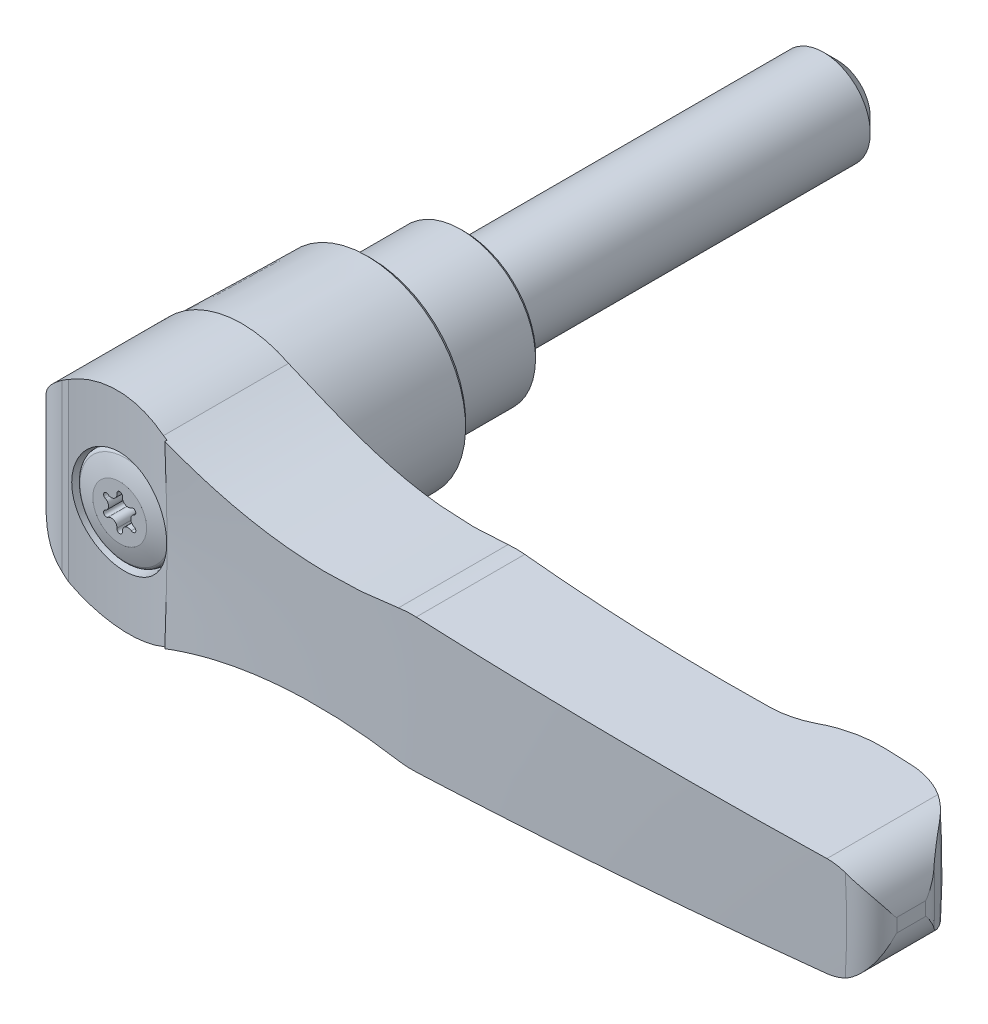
ISO-10303-21;
HEADER;
FILE_DESCRIPTION(('STEP AP214'),'2;1');
FILE_NAME('part.step','',(''),(''),'','','');
FILE_SCHEMA(('AUTOMOTIVE_DESIGN { 1 0 10303 214 1 1 1 1 }'));
ENDSEC;
DATA;
#1=APPLICATION_CONTEXT('core data for automotive mechanical design processes');
#2=APPLICATION_PROTOCOL_DEFINITION('international standard','automotive_design',2000,#1);
#3=PRODUCT_CONTEXT('',#1,'mechanical');
#4=PRODUCT('Part','Part','',(#3));
#5=PRODUCT_RELATED_PRODUCT_CATEGORY('part','',(#4));
#6=PRODUCT_DEFINITION_FORMATION('','',#4);
#7=PRODUCT_DEFINITION_CONTEXT('part definition',#1,'design');
#8=PRODUCT_DEFINITION('design','',#6,#7);
#9=PRODUCT_DEFINITION_SHAPE('','',#8);
#10=(LENGTH_UNIT() NAMED_UNIT(*) SI_UNIT(.MILLI.,.METRE.));
#11=(NAMED_UNIT(*) PLANE_ANGLE_UNIT() SI_UNIT($,.RADIAN.));
#12=(NAMED_UNIT(*) SI_UNIT($,.STERADIAN.) SOLID_ANGLE_UNIT());
#13=UNCERTAINTY_MEASURE_WITH_UNIT(LENGTH_MEASURE(1.E-05),#10,'distance_accuracy_value','');
#14=(GEOMETRIC_REPRESENTATION_CONTEXT(3) GLOBAL_UNCERTAINTY_ASSIGNED_CONTEXT((#13)) GLOBAL_UNIT_ASSIGNED_CONTEXT((#10,
#11,#12)) REPRESENTATION_CONTEXT('',''));
#15=CARTESIAN_POINT('',(0.,0.,0.));
#16=DIRECTION('',(0.,0.,1.));
#17=DIRECTION('',(1.,0.,0.));
#18=AXIS2_PLACEMENT_3D('',#15,#16,#17);
#19=CARTESIAN_POINT('',(0.,0.,27.75));
#20=DIRECTION('',(0.,0.,1.));
#21=DIRECTION('',(0.,-1.,0.));
#22=AXIS2_PLACEMENT_3D('',#19,#20,#21);
#23=CONICAL_SURFACE('',#22,5.15,0.0261799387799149);
#24=CARTESIAN_POINT('',(-3.82186723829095,3.79301788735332,36.7080789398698));
#25=CARTESIAN_POINT('',(-3.71534691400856,3.90028108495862,36.7062117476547));
#26=CARTESIAN_POINT('',(-3.60432455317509,4.00304517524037,36.704589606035));
#27=CARTESIAN_POINT('',(-3.37399930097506,4.19891926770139,36.7020096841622));
#28=CARTESIAN_POINT('',(-3.25469446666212,4.29202699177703,36.7010520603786));
#29=CARTESIAN_POINT('',(-3.0085890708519,4.4679591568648,36.6999680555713));
#30=CARTESIAN_POINT('',(-2.88178275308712,4.55077554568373,36.6998423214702));
#31=CARTESIAN_POINT('',(-2.62161264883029,4.7054859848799,36.7005758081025));
#32=CARTESIAN_POINT('',(-2.48824649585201,4.77737605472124,36.7014353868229));
#33=CARTESIAN_POINT('',(-2.21605276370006,4.90964048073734,36.7042708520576));
#34=CARTESIAN_POINT('',(-2.07722922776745,4.97002317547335,36.7062459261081));
#35=CARTESIAN_POINT('',(-1.79497035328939,5.07893378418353,36.7114191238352));
#36=CARTESIAN_POINT('',(-1.65153333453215,5.12745732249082,36.7146176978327));
#37=CARTESIAN_POINT('',(-1.36121177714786,5.21225729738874,36.7223126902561));
#38=CARTESIAN_POINT('',(-1.21432937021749,5.24854110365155,36.7268083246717));
#39=CARTESIAN_POINT('',(-0.918029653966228,5.30866584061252,36.7371445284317));
#40=CARTESIAN_POINT('',(-0.768611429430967,5.33250217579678,36.7429855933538));
#41=CARTESIAN_POINT('',(-0.468546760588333,5.36753437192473,36.7560131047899));
#42=CARTESIAN_POINT('',(-0.317902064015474,5.37874583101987,36.7631978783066));
#43=CARTESIAN_POINT('',(-0.0162164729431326,5.3885202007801,36.7788936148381));
#44=CARTESIAN_POINT('',(0.134824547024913,5.3870784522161,36.7874050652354));
#45=CARTESIAN_POINT('',(0.436130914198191,5.37156631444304,36.8056859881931));
#46=CARTESIAN_POINT('',(0.58639649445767,5.35749997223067,36.815455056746));
#47=CARTESIAN_POINT('',(0.885200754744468,5.31685490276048,36.8361582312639));
#48=CARTESIAN_POINT('',(1.03373877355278,5.29027153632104,36.8470927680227));
#49=CARTESIAN_POINT('',(1.32842726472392,5.22469830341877,36.8700247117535));
#50=CARTESIAN_POINT('',(1.47456945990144,5.18567228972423,36.882025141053));
#51=CARTESIAN_POINT('',(1.76304982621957,5.09551309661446,36.9068998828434));
#52=CARTESIAN_POINT('',(1.90538657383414,5.04437545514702,36.9197745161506));
#53=CARTESIAN_POINT('',(2.18517812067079,4.93037916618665,36.9461969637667));
#54=CARTESIAN_POINT('',(2.32263450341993,4.86752436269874,36.9597445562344));
#55=CARTESIAN_POINT('',(2.59177729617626,4.73053715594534,36.987298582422));
#56=CARTESIAN_POINT('',(2.72346154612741,4.65640057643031,37.0013051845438));
#57=CARTESIAN_POINT('',(3.11008075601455,4.41677811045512,37.0438406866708));
#58=CARTESIAN_POINT('',(3.35498940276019,4.23472918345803,37.0727317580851));
#59=CARTESIAN_POINT('',(3.81061841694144,3.83201391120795,37.1293132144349));
#60=CARTESIAN_POINT('',(4.02133817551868,3.61134687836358,37.1570035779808));
#61=CARTESIAN_POINT('',(4.40299814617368,3.13710131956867,37.2090851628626));
#62=CARTESIAN_POINT('',(4.57389146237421,2.88348453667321,37.2334724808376));
#63=CARTESIAN_POINT('',(4.8704857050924,2.35066468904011,37.2769076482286));
#64=CARTESIAN_POINT('',(4.99618921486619,2.07146308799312,37.2959558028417));
#65=CARTESIAN_POINT('',(5.19764854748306,1.49811632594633,37.3269450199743));
#66=CARTESIAN_POINT('',(5.27385550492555,1.20413322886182,37.3389501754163));
#67=CARTESIAN_POINT('',(5.37579370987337,0.607338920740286,37.3550873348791));
#68=CARTESIAN_POINT('',(5.40152887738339,0.304528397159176,37.3592199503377));
#69=CARTESIAN_POINT('',(5.40172286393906,-0.29769106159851,37.3592512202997));
#70=CARTESIAN_POINT('',(5.37675477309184,-0.597099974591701,37.35524190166));
#71=CARTESIAN_POINT('',(5.27746605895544,-1.18740212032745,37.3395194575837));
#72=CARTESIAN_POINT('',(5.20314585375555,-1.47829542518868,37.3278063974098));
#73=CARTESIAN_POINT('',(5.00745942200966,-2.04324075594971,37.2976749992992));
#74=CARTESIAN_POINT('',(4.88611822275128,-2.31730165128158,37.2792602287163));
#75=CARTESIAN_POINT('',(4.59994520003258,-2.84124816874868,37.2372335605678));
#76=CARTESIAN_POINT('',(4.43511078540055,-3.09113234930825,37.2136213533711));
#77=CARTESIAN_POINT('',(4.06463235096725,-3.56252869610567,37.1627855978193));
#78=CARTESIAN_POINT('',(3.85857005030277,-3.78370822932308,37.1355260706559));
#79=CARTESIAN_POINT('',(3.41254071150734,-4.18853503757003,37.0796758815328));
#80=CARTESIAN_POINT('',(3.17257159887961,-4.37218001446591,37.0510851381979));
#81=CARTESIAN_POINT('',(2.66278140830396,-4.69856745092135,36.994342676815));
#82=CARTESIAN_POINT('',(2.39268640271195,-4.84088357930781,36.9661981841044));
#83=CARTESIAN_POINT('',(1.83217160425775,-5.07809992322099,36.9125421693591));
#84=CARTESIAN_POINT('',(1.54175179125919,-5.17300009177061,36.8870306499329));
#85=CARTESIAN_POINT('',(0.948774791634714,-5.31257948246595,36.8401550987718));
#86=CARTESIAN_POINT('',(0.646218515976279,-5.35726246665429,36.8187907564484));
#87=CARTESIAN_POINT('',(0.0375867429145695,-5.39498080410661,36.7812079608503));
#88=CARTESIAN_POINT('',(-0.268488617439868,-5.38801816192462,36.7649893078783));
#89=CARTESIAN_POINT('',(-0.873320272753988,-5.32272310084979,36.7381921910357));
#90=CARTESIAN_POINT('',(-1.17211141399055,-5.26472804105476,36.7275774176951));
#91=CARTESIAN_POINT('',(-1.75586295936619,-5.09937269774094,36.7116339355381));
#92=CARTESIAN_POINT('',(-2.04082365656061,-4.99201346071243,36.7063051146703));
#93=CARTESIAN_POINT('',(-2.58762584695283,-4.73149608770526,36.7002185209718));
#94=CARTESIAN_POINT('',(-2.84955219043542,-4.57851601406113,36.6994432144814));
#95=CARTESIAN_POINT('',(-3.34420500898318,-4.23075694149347,36.7012936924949));
#96=CARTESIAN_POINT('',(-3.57693118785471,-4.03597751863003,36.7039195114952));
#97=CARTESIAN_POINT('',(-3.89903010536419,-3.71679841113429,36.709377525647));
#98=CARTESIAN_POINT('',(-4.00199323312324,-3.60577103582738,36.7114531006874));
#99=CARTESIAN_POINT('',(-4.19820603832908,-3.37546663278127,36.7159314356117));
#100=CARTESIAN_POINT('',(-4.29145927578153,-3.25619265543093,36.7183340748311));
#101=CARTESIAN_POINT('',(-4.46762204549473,-3.01018379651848,36.7232909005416));
#102=CARTESIAN_POINT('',(-4.55052767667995,-2.88344612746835,36.7258451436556));
#103=CARTESIAN_POINT('',(-4.70534739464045,-2.62348619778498,36.7309338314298));
#104=CARTESIAN_POINT('',(-4.77726552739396,-2.49026634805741,36.7334682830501));
#105=CARTESIAN_POINT('',(-4.90972659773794,-2.2180457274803,36.7383656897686));
#106=CARTESIAN_POINT('',(-4.97025295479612,-2.07903688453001,36.7407283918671));
#107=CARTESIAN_POINT('',(-5.07934789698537,-1.79645762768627,36.7451389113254));
#108=CARTESIAN_POINT('',(-5.12792090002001,-1.65288892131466,36.7471868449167));
#109=CARTESIAN_POINT('',(-5.21280239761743,-1.36211419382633,36.750853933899));
#110=CARTESIAN_POINT('',(-5.24910688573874,-1.21490700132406,36.7524729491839));
#111=CARTESIAN_POINT('',(-5.30915612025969,-0.918004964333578,36.7551917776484));
#112=CARTESIAN_POINT('',(-5.33290553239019,-0.768311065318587,36.7562917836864));
#113=CARTESIAN_POINT('',(-5.36767150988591,-0.467638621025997,36.7579130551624));
#114=CARTESIAN_POINT('',(-5.37870396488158,-0.316661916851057,36.7584350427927));
#115=CARTESIAN_POINT('',(-5.38800813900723,-0.0143709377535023,36.7588747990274));
#116=CARTESIAN_POINT('',(-5.38628458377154,0.136943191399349,36.7587927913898));
#117=CARTESIAN_POINT('',(-5.37009558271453,0.438975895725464,36.758029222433));
#118=CARTESIAN_POINT('',(-5.35562265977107,0.589694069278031,36.7573473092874));
#119=CARTESIAN_POINT('',(-5.31403708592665,0.889315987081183,36.7554202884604));
#120=CARTESIAN_POINT('',(-5.28692909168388,1.03822037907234,36.7541753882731));
#121=CARTESIAN_POINT('',(-5.22027737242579,1.33318140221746,36.7511900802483));
#122=CARTESIAN_POINT('',(-5.18073627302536,1.47923862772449,36.749449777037));
#123=CARTESIAN_POINT('',(-5.08951807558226,1.7674479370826,36.7455701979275));
#124=CARTESIAN_POINT('',(-5.03784539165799,1.90960142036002,36.7434310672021));
#125=CARTESIAN_POINT('',(-4.92276837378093,2.18894714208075,36.738876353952));
#126=CARTESIAN_POINT('',(-4.85937318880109,2.32614315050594,36.7364609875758));
#127=CARTESIAN_POINT('',(-4.72130226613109,2.59467891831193,36.7314958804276));
#128=CARTESIAN_POINT('',(-4.64662917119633,2.72602004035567,36.728946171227));
#129=CARTESIAN_POINT('',(-4.46041720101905,3.02367013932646,36.7230432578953));
#130=CARTESIAN_POINT('',(-4.34479079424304,3.18744274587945,36.7196987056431));
#131=CARTESIAN_POINT('',(-4.0960291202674,3.50111159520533,36.7134525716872));
#132=CARTESIAN_POINT('',(-3.96289380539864,3.65100780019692,36.7105509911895));
#133=CARTESIAN_POINT('',(-3.82186723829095,3.79301788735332,36.7080789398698));
#134=B_SPLINE_CURVE_WITH_KNOTS('',3,(#24,#25,#26,#27,#28,#29,#30,#31,#32,#33,#34,#35,#36,#37,
#38,#39,#40,#41,#42,#43,#44,#45,#46,#47,#48,#49,#50,#51,#52,#53,#54,#55,#56,#57,#58,#59,#60,#61,
#62,#63,#64,#65,#66,#67,#68,#69,#70,#71,#72,#73,#74,#75,#76,#77,#78,#79,#80,#81,#82,#83,#84,#85,
#86,#87,#88,#89,#90,#91,#92,#93,#94,#95,#96,#97,#98,#99,#100,#101,#102,#103,#104,#105,#106,#107,
#108,#109,#110,#111,#112,#113,#114,#115,#116,#117,#118,#119,#120,#121,#122,#123,#124,#125,#126,
#127,#128,#129,#130,#131,#132,#133),.UNSPECIFIED.,.T.,.F.,(4,2,2,2,2,2,2,2,2,2,2,2,2,2,2,2,2,2,
2,2,2,2,2,2,2,2,2,2,2,2,2,2,2,2,2,2,2,2,2,2,2,2,2,2,2,2,2,2,2,2,2,2,2,2,4),(0.,
0.453366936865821,0.906840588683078,1.36066684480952,1.81465803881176,2.26831899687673,
2.72214709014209,3.17570143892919,3.62942311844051,4.0825836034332,4.53591096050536,
4.98909304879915,5.44244323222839,5.89712263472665,6.35196980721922,6.8066680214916,
7.26153496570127,8.17638541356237,9.09125215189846,10.007190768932,10.9230770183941,
11.8304937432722,12.7378399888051,13.634987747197,14.5321279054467,15.4287912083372,
16.3255079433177,17.2318313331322,18.1382101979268,19.0536313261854,19.9690533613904,
20.8844068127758,21.7997247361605,22.7090368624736,23.6183297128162,24.5241189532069,
25.4299173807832,25.8837842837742,26.3374841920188,26.7913546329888,27.2450575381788,
27.6994157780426,28.1536058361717,28.6079440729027,29.0621133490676,29.5157145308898,
29.969147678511,30.4228469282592,30.8763790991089,31.3298155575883,31.7830872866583,
32.2360067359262,32.6888202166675,33.2890494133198,33.8892802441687),.UNSPECIFIED.);
#135=CARTESIAN_POINT('',(-3.82186723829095,3.79301788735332,36.7080789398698));
#136=VERTEX_POINT('',#135);
#137=EDGE_CURVE('E521',#136,#136,#134,.T.);
#138=ORIENTED_EDGE('',*,*,#137,.F.);
#139=EDGE_LOOP('',(#138));
#140=FACE_BOUND('',#139,.T.);
#141=CARTESIAN_POINT('',(0.,0.,33.));
#142=DIRECTION('',(0.,0.,-1.));
#143=DIRECTION('',(-1.,0.,0.));
#144=AXIS2_PLACEMENT_3D('',#141,#142,#143);
#145=CIRCLE('',#144,5.28747608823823);
#146=CARTESIAN_POINT('',(-5.28747608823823,0.,33.));
#147=VERTEX_POINT('',#146);
#148=EDGE_CURVE('E299',#147,#147,#145,.T.);
#149=ORIENTED_EDGE('',*,*,#148,.T.);
#150=EDGE_LOOP('',(#149));
#151=FACE_BOUND('',#150,.T.);
#152=ADVANCED_FACE('F14',(#140,#151),#23,.F.);
#153=CARTESIAN_POINT('',(0.,0.,-20.));
#154=DIRECTION('',(0.,0.,-1.));
#155=DIRECTION('',(0.,1.,0.));
#156=AXIS2_PLACEMENT_3D('',#153,#154,#155);
#157=CYLINDRICAL_SURFACE('',#156,5.);
#158=CARTESIAN_POINT('',(0.,0.,-38.5));
#159=DIRECTION('',(0.,0.,-1.));
#160=DIRECTION('',(0.,1.,0.));
#161=AXIS2_PLACEMENT_3D('',#158,#159,#160);
#162=CIRCLE('',#161,5.);
#163=CARTESIAN_POINT('',(0.,5.,-38.5));
#164=VERTEX_POINT('',#163);
#165=EDGE_CURVE('E9',#164,#164,#162,.F.);
#166=ORIENTED_EDGE('',*,*,#165,.T.);
#167=EDGE_LOOP('',(#166));
#168=FACE_BOUND('',#167,.T.);
#169=CARTESIAN_POINT('',(0.,0.,0.));
#170=DIRECTION('',(0.,0.,-1.));
#171=DIRECTION('',(0.,1.,0.));
#172=AXIS2_PLACEMENT_3D('',#169,#170,#171);
#173=CIRCLE('',#172,5.);
#174=CARTESIAN_POINT('',(0.,5.,0.));
#175=VERTEX_POINT('',#174);
#176=EDGE_CURVE('E362',#175,#175,#173,.T.);
#177=ORIENTED_EDGE('',*,*,#176,.T.);
#178=EDGE_LOOP('',(#177));
#179=FACE_BOUND('',#178,.T.);
#180=ADVANCED_FACE('F512',(#168,#179),#157,.T.);
#181=CARTESIAN_POINT('',(7.6,0.,0.));
#182=DIRECTION('',(0.,0.,1.));
#183=DIRECTION('',(0.,-1.,0.));
#184=AXIS2_PLACEMENT_3D('',#181,#182,#183);
#185=PLANE('',#184);
#186=ORIENTED_EDGE('',*,*,#176,.F.);
#187=EDGE_LOOP('',(#186));
#188=FACE_BOUND('',#187,.T.);
#189=CARTESIAN_POINT('',(0.,0.,0.));
#190=DIRECTION('',(0.,0.,-1.));
#191=DIRECTION('',(0.,1.,0.));
#192=AXIS2_PLACEMENT_3D('',#189,#190,#191);
#193=CIRCLE('',#192,7.6);
#194=CARTESIAN_POINT('',(0.,7.6,0.));
#195=VERTEX_POINT('',#194);
#196=EDGE_CURVE('E985',#195,#195,#193,.T.);
#197=ORIENTED_EDGE('',*,*,#196,.T.);
#198=EDGE_LOOP('',(#197));
#199=FACE_BOUND('',#198,.T.);
#200=ADVANCED_FACE('F403',(#188,#199),#185,.F.);
#201=CARTESIAN_POINT('',(-2.9000000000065,-22.,89.3000000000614));
#202=DIRECTION('',(0.,1.,0.));
#203=DIRECTION('',(-1.,0.,0.));
#204=AXIS2_PLACEMENT_3D('',#201,#202,#203);
#205=CYLINDRICAL_SURFACE('',#204,52.6000000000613);
#206=CARTESIAN_POINT('',(4.99999999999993,9.79795897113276,37.29663472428));
#207=CARTESIAN_POINT('',(4.72836499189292,9.9366097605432,37.2553500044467));
#208=CARTESIAN_POINT('',(4.45077156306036,10.0639978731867,37.2153761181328));
#209=CARTESIAN_POINT('',(3.88554818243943,10.2954169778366,37.1387392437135));
#210=CARTESIAN_POINT('',(3.59791744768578,10.3994461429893,37.1020765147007));
#211=CARTESIAN_POINT('',(3.01491777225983,10.5831754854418,37.0328024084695));
#212=CARTESIAN_POINT('',(2.71955925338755,10.6629067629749,37.0001858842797));
#213=CARTESIAN_POINT('',(2.12279313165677,10.79755975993,36.9395048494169));
#214=CARTESIAN_POINT('',(1.82138582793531,10.8524827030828,36.9114401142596));
#215=CARTESIAN_POINT('',(1.21421772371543,10.9370815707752,36.8602616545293));
#216=CARTESIAN_POINT('',(0.90845167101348,10.966723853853,36.8371545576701));
#217=CARTESIAN_POINT('',(0.295018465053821,11.0003346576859,36.7962250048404));
#218=CARTESIAN_POINT('',(-0.0126494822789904,11.0042916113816,36.7784049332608));
#219=CARTESIAN_POINT('',(-0.627464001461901,10.9863940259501,36.7482132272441));
#220=CARTESIAN_POINT('',(-0.934610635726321,10.9645428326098,36.7358408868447));
#221=CARTESIAN_POINT('',(-1.54601934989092,10.8951569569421,36.7165401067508));
#222=CARTESIAN_POINT('',(-1.85028266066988,10.8476337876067,36.709609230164));
#223=CARTESIAN_POINT('',(-2.46439079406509,10.7251200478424,36.7008764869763));
#224=CARTESIAN_POINT('',(-2.77405858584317,10.64922685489,36.6992625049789));
#225=CARTESIAN_POINT('',(-3.38564496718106,10.4708596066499,36.7013524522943));
#226=CARTESIAN_POINT('',(-3.68756293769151,10.3683834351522,36.705056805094));
#227=CARTESIAN_POINT('',(-4.28200890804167,10.1373700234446,36.7173174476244));
#228=CARTESIAN_POINT('',(-4.5745119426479,10.0087692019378,36.7258856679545));
#229=CARTESIAN_POINT('',(-5.14711147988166,9.72673276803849,36.7472344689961));
#230=CARTESIAN_POINT('',(-5.42720860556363,9.57329840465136,36.7600148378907));
#231=CARTESIAN_POINT('',(-5.70000000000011,9.40797534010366,36.774577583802));
#232=B_SPLINE_CURVE_WITH_KNOTS('',3,(#206,#207,#208,#209,#210,#211,#212,#213,#214,#215,#216,
#217,#218,#219,#220,#221,#222,#223,#224,#225,#226,#227,#228,#229,#230,#231),.UNSPECIFIED.,.F.,
.F.,(4,2,2,2,2,2,2,2,2,2,2,2,4),(0.,0.923020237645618,1.84611263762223,2.76801850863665,
3.68987889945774,4.61296412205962,5.53646501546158,6.4598461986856,7.38281362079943,
8.33806499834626,9.29339244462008,10.2510734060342,11.2087062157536),.UNSPECIFIED.);
#233=CARTESIAN_POINT('',(4.99999999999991,9.7979589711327,37.29663472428));
#234=VERTEX_POINT('',#233);
#235=CARTESIAN_POINT('',(-5.7000000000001,9.40797534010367,36.774577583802));
#236=VERTEX_POINT('',#235);
#237=EDGE_CURVE('E435',#234,#236,#232,.T.);
#238=ORIENTED_EDGE('',*,*,#237,.T.);
#239=DIRECTION('',(0.,1.,0.));
#240=VECTOR('',#239,1.);
#241=CARTESIAN_POINT('',(-5.7000000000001,-22.,36.774577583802));
#242=LINE('',#241,#240);
#243=CARTESIAN_POINT('',(-5.7000000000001,-9.4079753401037,36.774577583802));
#244=VERTEX_POINT('',#243);
#245=EDGE_CURVE('E368',#244,#236,#242,.T.);
#246=ORIENTED_EDGE('',*,*,#245,.F.);
#247=CARTESIAN_POINT('',(-5.70000000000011,-9.40797534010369,36.774577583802));
#248=CARTESIAN_POINT('',(-5.43970332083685,-9.56571993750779,36.7606846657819));
#249=CARTESIAN_POINT('',(-5.17275915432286,-9.71264560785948,36.7484111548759));
#250=CARTESIAN_POINT('',(-4.62749279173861,-9.9839292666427,36.727671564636));
#251=CARTESIAN_POINT('',(-4.34917039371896,-10.1082868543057,36.7192055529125));
#252=CARTESIAN_POINT('',(-3.7836735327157,-10.3332602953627,36.706663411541));
#253=CARTESIAN_POINT('',(-3.49651907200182,-10.4339258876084,36.7025780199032));
#254=CARTESIAN_POINT('',(-2.91484226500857,-10.6111316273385,36.699198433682));
#255=CARTESIAN_POINT('',(-2.62032018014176,-10.6876726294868,36.6999040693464));
#256=CARTESIAN_POINT('',(-2.02570589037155,-10.8161512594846,36.7064252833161));
#257=CARTESIAN_POINT('',(-1.7256084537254,-10.8680644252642,36.7122459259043));
#258=CARTESIAN_POINT('',(-1.12215614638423,-10.9468441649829,36.7291866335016));
#259=CARTESIAN_POINT('',(-0.818799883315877,-10.9736995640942,36.7403090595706));
#260=CARTESIAN_POINT('',(-0.211043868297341,-11.0021831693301,36.7678948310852));
#261=CARTESIAN_POINT('',(0.0933562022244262,-11.0038028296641,36.7843599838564));
#262=CARTESIAN_POINT('',(0.700782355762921,-10.981859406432,36.8225100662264));
#263=CARTESIAN_POINT('',(1.00380896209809,-10.9583068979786,36.844192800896));
#264=CARTESIAN_POINT('',(1.62703646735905,-10.883833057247,36.8941780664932));
#265=CARTESIAN_POINT('',(1.94700070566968,-10.8311562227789,36.9228309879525));
#266=CARTESIAN_POINT('',(2.58058446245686,-10.6979165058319,36.9853308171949));
#267=CARTESIAN_POINT('',(2.89420315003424,-10.6173499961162,37.0191784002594));
#268=CARTESIAN_POINT('',(3.51321915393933,-10.4289071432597,37.0914975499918));
#269=CARTESIAN_POINT('',(3.81860000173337,-10.3209800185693,37.1299776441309));
#270=CARTESIAN_POINT('',(4.41821395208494,-10.078894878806,37.2106925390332));
#271=CARTESIAN_POINT('',(4.71244874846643,-9.94474086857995,37.2529267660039));
#272=CARTESIAN_POINT('',(5.0000000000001,-9.7979589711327,37.29663472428));
#273=B_SPLINE_CURVE_WITH_KNOTS('',3,(#247,#248,#249,#250,#251,#252,#253,#254,#255,#256,#257,
#258,#259,#260,#261,#262,#263,#264,#265,#266,#267,#268,#269,#270,#271,#272),.UNSPECIFIED.,.F.,
.F.,(4,2,2,2,2,2,2,2,2,2,2,2,4),(0.,0.913785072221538,1.82758637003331,2.73945177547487,
3.65128487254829,4.56402177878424,5.47716553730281,6.39061851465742,7.30368789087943,
8.27897178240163,9.25438256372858,10.2316171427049,11.2087026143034),.UNSPECIFIED.);
#274=CARTESIAN_POINT('',(5.00000000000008,-9.79795897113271,37.29663472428));
#275=VERTEX_POINT('',#274);
#276=EDGE_CURVE('E421',#244,#275,#273,.T.);
#277=ORIENTED_EDGE('',*,*,#276,.T.);
#278=CARTESIAN_POINT('',(5.43597073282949,-9.62987816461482,37.36473652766));
#279=CARTESIAN_POINT('',(5.36321973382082,-9.65752809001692,37.3530600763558));
#280=CARTESIAN_POINT('',(5.29051333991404,-9.68535978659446,37.341546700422));
#281=CARTESIAN_POINT('',(5.14518976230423,-9.74138672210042,37.3188460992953));
#282=CARTESIAN_POINT('',(5.07257257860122,-9.76958196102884,37.3076588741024));
#283=CARTESIAN_POINT('',(5.00000000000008,-9.79795897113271,37.29663472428));
#284=B_SPLINE_CURVE_WITH_KNOTS('',3,(#278,#279,#280,#281,#282,#283),.UNSPECIFIED.,.F.,.F.,(4,2,
4),(0.,0.236094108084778,0.472188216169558),.UNSPECIFIED.);
#285=CARTESIAN_POINT('',(5.4359707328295,-9.62987816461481,37.36473652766));
#286=VERTEX_POINT('',#285);
#287=EDGE_CURVE('E410',#286,#275,#284,.T.);
#288=ORIENTED_EDGE('',*,*,#287,.F.);
#289=DIRECTION('',(0.,1.,0.));
#290=VECTOR('',#289,1.);
#291=CARTESIAN_POINT('',(5.43597073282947,-22.,37.36473652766));
#292=LINE('',#291,#290);
#293=CARTESIAN_POINT('',(5.43597073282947,0.,37.36473652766));
#294=VERTEX_POINT('',#293);
#295=EDGE_CURVE('E37',#286,#294,#292,.T.);
#296=ORIENTED_EDGE('',*,*,#295,.T.);
#297=CARTESIAN_POINT('',(5.43597073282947,9.62987816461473,37.36473652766));
#298=VERTEX_POINT('',#297);
#299=EDGE_CURVE('E365',#294,#298,#292,.T.);
#300=ORIENTED_EDGE('',*,*,#299,.T.);
#301=CARTESIAN_POINT('',(4.99999999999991,9.7979589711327,37.29663472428));
#302=CARTESIAN_POINT('',(5.07257257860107,9.76958196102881,37.3076588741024));
#303=CARTESIAN_POINT('',(5.14518976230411,9.74138672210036,37.3188460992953));
#304=CARTESIAN_POINT('',(5.29051333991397,9.68535978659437,37.341546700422));
#305=CARTESIAN_POINT('',(5.36321973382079,9.65752809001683,37.3530600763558));
#306=CARTESIAN_POINT('',(5.43597073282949,9.62987816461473,37.36473652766));
#307=B_SPLINE_CURVE_WITH_KNOTS('',3,(#301,#302,#303,#304,#305,#306),.UNSPECIFIED.,.F.,.F.,(4,2,
4),(0.,0.236094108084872,0.472188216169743),.UNSPECIFIED.);
#308=EDGE_CURVE('E428',#234,#298,#307,.T.);
#309=ORIENTED_EDGE('',*,*,#308,.F.);
#310=EDGE_LOOP('',(#238,#246,#277,#288,#296,#300,#309));
#311=FACE_BOUND('',#310,.T.);
#312=ORIENTED_EDGE('',*,*,#137,.T.);
#313=EDGE_LOOP('',(#312));
#314=FACE_BOUND('',#313,.T.);
#315=ADVANCED_FACE('F399',(#311,#314),#205,.F.);
#316=CARTESIAN_POINT('',(0.,0.,-577.800000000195));
#317=DIRECTION('',(0.,0.,-1.));
#318=DIRECTION('',(0.,1.,0.));
#319=AXIS2_PLACEMENT_3D('',#316,#317,#318);
#320=DEGENERATE_TOROIDAL_SURFACE('',#319,33.3999999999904,615.800000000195,.T.);
#321=CARTESIAN_POINT('',(30.9002,7.10003333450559,37.9976683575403));
#322=CARTESIAN_POINT('',(30.2294569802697,6.98822969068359,37.9958049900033));
#323=CARTESIAN_POINT('',(29.5563953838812,6.8904055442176,37.9928133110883));
#324=CARTESIAN_POINT('',(28.2067936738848,6.7228472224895,37.9846275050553));
#325=CARTESIAN_POINT('',(27.5302535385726,6.6531132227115,37.9794333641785));
#326=CARTESIAN_POINT('',(26.1747400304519,6.54185757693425,37.9668957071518));
#327=CARTESIAN_POINT('',(25.4957662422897,6.5003410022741,37.9595518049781));
#328=CARTESIAN_POINT('',(24.1367720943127,6.44559969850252,37.9428222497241));
#329=CARTESIAN_POINT('',(23.4567517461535,6.43237465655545,37.9334366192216));
#330=CARTESIAN_POINT('',(21.4461065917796,6.43516844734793,37.9028483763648));
#331=CARTESIAN_POINT('',(20.1152587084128,6.49125306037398,37.878929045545));
#332=CARTESIAN_POINT('',(18.1264981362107,6.65637631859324,37.8390449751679));
#333=CARTESIAN_POINT('',(17.464852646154,6.72491301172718,37.8250833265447));
#334=CARTESIAN_POINT('',(16.1449136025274,6.88885393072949,37.7962639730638));
#335=CARTESIAN_POINT('',(15.4866198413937,6.98425647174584,37.7814063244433));
#336=CARTESIAN_POINT('',(13.9966493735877,7.23126043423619,37.7473031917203));
#337=CARTESIAN_POINT('',(13.1663283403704,7.39108521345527,37.727959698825));
#338=CARTESIAN_POINT('',(11.5152169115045,7.75343699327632,37.690522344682));
#339=CARTESIAN_POINT('',(10.694424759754,7.9559559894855,37.6724282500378));
#340=CARTESIAN_POINT('',(9.05285416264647,8.40635359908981,37.6397736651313));
#341=CARTESIAN_POINT('',(8.23223752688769,8.6548288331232,37.6252663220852));
#342=CARTESIAN_POINT('',(7.01185980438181,9.05958984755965,37.608666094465));
#343=CARTESIAN_POINT('',(6.60676296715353,9.19987583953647,37.603992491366));
#344=CARTESIAN_POINT('',(5.80036915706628,9.49103692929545,37.5966508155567));
#345=CARTESIAN_POINT('',(5.39907222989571,9.64191215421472,37.5939827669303));
#346=CARTESIAN_POINT('',(4.9997999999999,9.79803717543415,37.5924593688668));
#347=B_SPLINE_CURVE_WITH_KNOTS('',3,(#321,#322,#323,#324,#325,#326,#327,#328,#329,#330,#331,
#332,#333,#334,#335,#336,#337,#338,#339,#340,#341,#342,#343,#344,#345,#346),.UNSPECIFIED.,.F.,
.F.,(4,2,2,2,2,2,2,2,2,2,2,2,4),(0.,2.03983506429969,4.07968287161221,6.11989719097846,
8.16008895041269,12.1515193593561,14.1470960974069,16.1425477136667,18.6787308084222,
21.2144388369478,23.7857285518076,25.0717731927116,26.3578332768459),.UNSPECIFIED.);
#348=CARTESIAN_POINT('',(30.9,7.1,37.997667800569));
#349=VERTEX_POINT('',#348);
#350=CARTESIAN_POINT('',(5.4359707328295,9.62987816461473,37.5945767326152));
#351=VERTEX_POINT('',#350);
#352=EDGE_CURVE('E1012',#349,#351,#347,.T.);
#353=ORIENTED_EDGE('',*,*,#352,.T.);
#354=CARTESIAN_POINT('',(5.4359707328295,0.139704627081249,37.364818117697));
#355=CARTESIAN_POINT('',(5.4359707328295,0.0263223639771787,37.3646847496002));
#356=CARTESIAN_POINT('',(5.4359707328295,-0.087059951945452,37.3647143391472));
#357=CARTESIAN_POINT('',(5.4359707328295,-0.31382488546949,37.3650945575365));
#358=CARTESIAN_POINT('',(5.4359707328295,-0.427207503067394,37.3654451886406));
#359=CARTESIAN_POINT('',(5.4359707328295,-0.767350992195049,37.3669741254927));
#360=CARTESIAN_POINT('',(5.4359707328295,-0.994109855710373,37.3686294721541));
#361=CARTESIAN_POINT('',(5.4359707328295,-1.44760096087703,37.3731244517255));
#362=CARTESIAN_POINT('',(5.4359707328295,-1.67433320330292,37.3759640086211));
#363=CARTESIAN_POINT('',(5.4359707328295,-2.12778335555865,37.3826896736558));
#364=CARTESIAN_POINT('',(5.4359707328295,-2.35450126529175,37.3865757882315));
#365=CARTESIAN_POINT('',(5.4359707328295,-2.80788425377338,37.3952314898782));
#366=CARTESIAN_POINT('',(5.4359707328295,-3.03454933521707,37.4000009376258));
#367=CARTESIAN_POINT('',(5.4359707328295,-3.48786247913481,37.4102594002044));
#368=CARTESIAN_POINT('',(5.4359707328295,-3.71451054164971,37.4157484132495));
#369=CARTESIAN_POINT('',(5.4359707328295,-4.3944531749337,37.4330569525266));
#370=CARTESIAN_POINT('',(5.4359707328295,-4.84772616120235,37.445717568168));
#371=CARTESIAN_POINT('',(5.4359707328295,-5.75417804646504,37.4722642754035));
#372=CARTESIAN_POINT('',(5.4359707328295,-6.20735695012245,37.4861502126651));
#373=CARTESIAN_POINT('',(5.4359707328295,-7.11369823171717,37.5144555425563));
#374=CARTESIAN_POINT('',(5.4359707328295,-7.56686060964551,37.528874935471));
#375=CARTESIAN_POINT('',(5.4359707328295,-8.47318366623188,37.5577843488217));
#376=CARTESIAN_POINT('',(5.4359707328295,-8.92634434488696,37.5722743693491));
#377=CARTESIAN_POINT('',(5.4359707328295,-9.83267306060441,37.6010218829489));
#378=CARTESIAN_POINT('',(5.4359707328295,-10.2858410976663,37.615279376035));
#379=CARTESIAN_POINT('',(5.4359707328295,-11.6453393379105,37.657378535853));
#380=CARTESIAN_POINT('',(5.4359707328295,-12.5516906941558,37.6845477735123));
#381=CARTESIAN_POINT('',(5.4359707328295,-14.3644725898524,37.7361289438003));
#382=CARTESIAN_POINT('',(5.4359707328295,-15.2709031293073,37.7605408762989));
#383=CARTESIAN_POINT('',(5.4359707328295,-17.0838968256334,37.8061411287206));
#384=CARTESIAN_POINT('',(5.4359707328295,-17.9904599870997,37.8273292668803));
#385=CARTESIAN_POINT('',(5.4359707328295,-19.8036600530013,37.8662106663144));
#386=CARTESIAN_POINT('',(5.4359707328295,-20.7102969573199,37.8839039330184));
#387=CARTESIAN_POINT('',(5.4359707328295,-22.5236728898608,37.9156376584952));
#388=CARTESIAN_POINT('',(5.4359707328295,-23.4304119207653,37.929677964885));
#389=CARTESIAN_POINT('',(5.4359707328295,-25.2439454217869,37.9540054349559));
#390=CARTESIAN_POINT('',(5.4359707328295,-26.1507398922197,37.9642925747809));
#391=CARTESIAN_POINT('',(5.4359707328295,-28.8758498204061,37.9894632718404));
#392=CARTESIAN_POINT('',(5.4359707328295,-30.6942231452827,37.9985735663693));
#393=CARTESIAN_POINT('',(5.4359707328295,-34.3309833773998,38.001117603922));
#394=CARTESIAN_POINT('',(5.4359707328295,-36.1493702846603,37.9945512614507));
#395=CARTESIAN_POINT('',(5.4359707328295,-41.6044064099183,37.9510940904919));
#396=CARTESIAN_POINT('',(5.4359707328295,-45.2408980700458,37.8904448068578));
#397=CARTESIAN_POINT('',(5.4359707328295,-52.5123746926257,37.7052257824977));
#398=CARTESIAN_POINT('',(5.4359707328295,-56.147359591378,37.5806535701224));
#399=CARTESIAN_POINT('',(5.4359707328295,-63.4145638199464,37.2674123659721));
#400=CARTESIAN_POINT('',(5.4359707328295,-67.046783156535,37.0787435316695));
#401=CARTESIAN_POINT('',(5.4359707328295,-74.3112406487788,36.6370156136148));
#402=CARTESIAN_POINT('',(5.4359707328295,-77.943474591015,36.3838872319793));
#403=CARTESIAN_POINT('',(5.4359707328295,-85.2028595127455,35.813362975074));
#404=CARTESIAN_POINT('',(5.4359707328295,-88.8300105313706,35.4959675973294));
#405=CARTESIAN_POINT('',(5.4359707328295,-96.0785329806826,34.7969300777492));
#406=CARTESIAN_POINT('',(5.4359707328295,-99.6999037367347,34.4152809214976));
#407=CARTESIAN_POINT('',(5.4359707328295,-106.935372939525,33.5878576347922));
#408=CARTESIAN_POINT('',(5.4359707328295,-110.54947113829,33.1420813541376));
#409=CARTESIAN_POINT('',(5.4359707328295,-121.445659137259,31.6999206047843));
#410=CARTESIAN_POINT('',(5.4359707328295,-128.715080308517,30.6051121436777));
#411=CARTESIAN_POINT('',(5.4359707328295,-139.58597763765,28.768381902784));
#412=CARTESIAN_POINT('',(5.4359707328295,-143.204228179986,28.1236865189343));
#413=CARTESIAN_POINT('',(5.4359707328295,-150.428776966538,26.7696133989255));
#414=CARTESIAN_POINT('',(5.4359707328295,-154.035074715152,26.0602330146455));
#415=CARTESIAN_POINT('',(5.4359707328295,-164.835392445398,23.8351440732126));
#416=CARTESIAN_POINT('',(5.4359707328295,-172.00972097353,22.2226762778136));
#417=CARTESIAN_POINT('',(5.4359707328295,-186.295919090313,18.7419286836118));
#418=CARTESIAN_POINT('',(5.4359707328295,-193.407788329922,16.8736474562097));
#419=CARTESIAN_POINT('',(5.4359707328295,-207.565393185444,12.8821360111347));
#420=CARTESIAN_POINT('',(5.4359707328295,-214.611075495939,10.7587166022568));
#421=CARTESIAN_POINT('',(5.4359707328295,-228.621811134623,6.26076727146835));
#422=CARTESIAN_POINT('',(5.4359707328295,-235.586864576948,3.88623770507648));
#423=CARTESIAN_POINT('',(5.4359707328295,-249.427511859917,-1.11092136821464));
#424=CARTESIAN_POINT('',(5.4359707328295,-256.303103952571,-3.73355571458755));
#425=CARTESIAN_POINT('',(5.4359707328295,-269.956066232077,-9.2236157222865));
#426=CARTESIAN_POINT('',(5.4359707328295,-276.733435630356,-12.0910433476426));
#427=CARTESIAN_POINT('',(5.4359707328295,-287.411895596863,-16.8363541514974));
#428=CARTESIAN_POINT('',(5.4359707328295,-291.348165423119,-18.6354901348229));
#429=CARTESIAN_POINT('',(5.4359707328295,-299.181702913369,-22.3162445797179));
#430=CARTESIAN_POINT('',(5.4359707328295,-303.078972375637,-24.1978592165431));
#431=CARTESIAN_POINT('',(5.4359707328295,-314.710300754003,-29.9654969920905));
#432=CARTESIAN_POINT('',(5.4359707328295,-322.383911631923,-33.9743282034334));
#433=CARTESIAN_POINT('',(5.4359707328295,-337.555961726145,-42.3122719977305));
#434=CARTESIAN_POINT('',(5.4359707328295,-345.054380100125,-46.6414224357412));
#435=CARTESIAN_POINT('',(5.4359707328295,-359.862045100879,-55.6120111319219));
#436=CARTESIAN_POINT('',(5.4359707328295,-367.171293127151,-60.2534470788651));
#437=CARTESIAN_POINT('',(5.4359707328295,-381.590156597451,-69.8420495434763));
#438=CARTESIAN_POINT('',(5.4359707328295,-388.699700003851,-74.7893243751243));
#439=CARTESIAN_POINT('',(5.4359707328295,-402.703827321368,-84.9793317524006));
#440=CARTESIAN_POINT('',(5.4359707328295,-409.598410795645,-90.2220648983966));
#441=CARTESIAN_POINT('',(5.4359707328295,-423.160104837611,-100.99347121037));
#442=CARTESIAN_POINT('',(5.4359707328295,-429.827222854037,-106.522134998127));
#443=CARTESIAN_POINT('',(5.4359707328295,-442.922356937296,-117.855720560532));
#444=CARTESIAN_POINT('',(5.4359707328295,-449.350373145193,-123.660642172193));
#445=CARTESIAN_POINT('',(5.4359707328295,-461.953986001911,-135.534643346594));
#446=CARTESIAN_POINT('',(5.4359707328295,-468.129657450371,-141.603643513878));
#447=CARTESIAN_POINT('',(5.4359707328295,-480.219630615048,-153.996624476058));
#448=CARTESIAN_POINT('',(5.4359707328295,-486.133932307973,-160.320605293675));
#449=CARTESIAN_POINT('',(5.4359707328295,-497.690689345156,-173.212347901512));
#450=CARTESIAN_POINT('',(5.4359707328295,-503.333142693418,-179.780111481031));
#451=CARTESIAN_POINT('',(5.4359707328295,-514.336121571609,-193.147695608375));
#452=CARTESIAN_POINT('',(5.4359707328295,-519.696647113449,-199.947516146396));
#453=CARTESIAN_POINT('',(5.4359707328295,-530.125574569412,-213.766243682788));
#454=CARTESIAN_POINT('',(5.4359707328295,-535.19401350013,-220.785122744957));
#455=CARTESIAN_POINT('',(5.4359707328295,-545.030492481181,-235.030309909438));
#456=CARTESIAN_POINT('',(5.4359707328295,-549.798532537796,-242.256618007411));
#457=CARTESIAN_POINT('',(5.4359707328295,-559.025727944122,-256.903802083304));
#458=CARTESIAN_POINT('',(5.4359707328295,-563.484883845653,-264.324677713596));
#459=CARTESIAN_POINT('',(5.4359707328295,-572.086391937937,-279.347815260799));
#460=CARTESIAN_POINT('',(5.4359707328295,-576.228744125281,-286.95007717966));
#461=CARTESIAN_POINT('',(5.4359707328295,-584.189397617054,-302.322698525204));
#462=CARTESIAN_POINT('',(5.4359707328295,-588.007689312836,-310.09306292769));
#463=CARTESIAN_POINT('',(5.4359707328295,-595.313295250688,-325.787854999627));
#464=CARTESIAN_POINT('',(5.4359707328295,-598.80060949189,-333.71228266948));
#465=CARTESIAN_POINT('',(5.4359707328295,-605.438061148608,-349.701114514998));
#466=CARTESIAN_POINT('',(5.4359707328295,-608.588198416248,-357.765518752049));
#467=CARTESIAN_POINT('',(5.4359707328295,-614.545693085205,-374.01996116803));
#468=CARTESIAN_POINT('',(5.4359707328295,-617.353050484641,-382.20999934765));
#469=CARTESIAN_POINT('',(5.4359707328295,-622.620087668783,-398.701441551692));
#470=CARTESIAN_POINT('',(5.4359707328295,-625.079755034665,-407.002849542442));
#471=CARTESIAN_POINT('',(5.4359707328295,-629.646919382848,-423.701983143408));
#472=CARTESIAN_POINT('',(5.4359707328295,-631.754416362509,-432.099708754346));
#473=CARTESIAN_POINT('',(5.4359707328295,-635.613492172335,-448.976544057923));
#474=CARTESIAN_POINT('',(5.4359707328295,-637.365071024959,-457.455653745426));
#475=CARTESIAN_POINT('',(5.4359707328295,-640.509196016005,-474.480180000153));
#476=CARTESIAN_POINT('',(5.4359707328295,-641.901742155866,-483.025596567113));
#477=CARTESIAN_POINT('',(5.4359707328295,-644.32531330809,-500.167455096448));
#478=CARTESIAN_POINT('',(5.4359707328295,-645.356341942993,-508.763896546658));
#479=CARTESIAN_POINT('',(5.4359707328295,-647.055064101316,-525.992603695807));
#480=CARTESIAN_POINT('',(5.4359707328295,-647.722757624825,-534.624869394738));
#481=CARTESIAN_POINT('',(5.4359707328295,-648.693622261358,-551.909875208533));
#482=CARTESIAN_POINT('',(5.4359707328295,-648.99679337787,-560.562615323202));
#483=CARTESIAN_POINT('',(5.4359707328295,-649.238074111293,-577.873183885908));
#484=CARTESIAN_POINT('',(5.4359707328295,-649.176183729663,-586.531012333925));
#485=CARTESIAN_POINT('',(5.4359707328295,-648.687456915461,-603.836171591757));
#486=CARTESIAN_POINT('',(5.4359707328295,-648.260628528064,-612.483502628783));
#487=CARTESIAN_POINT('',(5.4359707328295,-647.042795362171,-629.752482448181));
#488=CARTESIAN_POINT('',(5.4359707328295,-646.251790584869,-638.374131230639));
#489=CARTESIAN_POINT('',(5.4359707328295,-644.307011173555,-655.57641610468));
#490=CARTESIAN_POINT('',(5.4359707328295,-643.153236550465,-664.1570521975));
#491=CARTESIAN_POINT('',(5.4359707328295,-640.484968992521,-681.26205469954));
#492=CARTESIAN_POINT('',(5.4359707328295,-638.970476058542,-689.786421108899));
#493=CARTESIAN_POINT('',(5.4359707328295,-635.583505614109,-706.763522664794));
#494=CARTESIAN_POINT('',(5.4359707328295,-633.711036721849,-715.216259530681));
#495=CARTESIAN_POINT('',(5.4359707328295,-629.611420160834,-732.03528066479));
#496=CARTESIAN_POINT('',(5.4359707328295,-627.38427249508,-740.401564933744));
#497=CARTESIAN_POINT('',(5.4359707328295,-622.579258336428,-757.032805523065));
#498=CARTESIAN_POINT('',(5.4359707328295,-620.001391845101,-765.297761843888));
#499=CARTESIAN_POINT('',(5.4359707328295,-614.499523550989,-781.711651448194));
#500=CARTESIAN_POINT('',(5.4359707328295,-611.575521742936,-789.860584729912));
#501=CARTESIAN_POINT('',(5.4359707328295,-605.386368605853,-806.028496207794));
#502=CARTESIAN_POINT('',(5.4359707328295,-602.12119379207,-814.047465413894));
#503=CARTESIAN_POINT('',(5.4359707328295,-595.255667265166,-829.9406140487));
#504=CARTESIAN_POINT('',(5.4359707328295,-591.655315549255,-837.814793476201));
#505=CARTESIAN_POINT('',(5.4359707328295,-584.125837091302,-853.404361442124));
#506=CARTESIAN_POINT('',(5.4359707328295,-580.196710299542,-861.119749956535));
#507=CARTESIAN_POINT('',(5.4359707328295,-572.016669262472,-876.378014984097));
#508=CARTESIAN_POINT('',(5.4359707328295,-567.765755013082,-883.920891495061));
#509=CARTESIAN_POINT('',(5.4359707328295,-558.949229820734,-898.821511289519));
#510=CARTESIAN_POINT('',(5.4359707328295,-554.383585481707,-906.179234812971));
#511=CARTESIAN_POINT('',(5.4359707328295,-544.946122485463,-920.695630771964));
#512=CARTESIAN_POINT('',(5.4359707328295,-540.074303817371,-927.854303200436));
#513=CARTESIAN_POINT('',(5.4359707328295,-530.033157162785,-941.959864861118));
#514=CARTESIAN_POINT('',(5.4359707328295,-524.863829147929,-948.906754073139));
#515=CARTESIAN_POINT('',(5.4359707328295,-514.236858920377,-962.576392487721));
#516=CARTESIAN_POINT('',(5.4359707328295,-508.779216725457,-969.299141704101));
#517=CARTESIAN_POINT('',(5.4359707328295,-497.586889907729,-982.506697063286));
#518=CARTESIAN_POINT('',(5.4359707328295,-491.85228313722,-988.9915691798));
#519=CARTESIAN_POINT('',(5.4359707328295,-480.114812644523,-1001.71382103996));
#520=CARTESIAN_POINT('',(5.4359707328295,-474.111948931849,-1007.95120079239));
#521=CARTESIAN_POINT('',(5.4359707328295,-461.848645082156,-1020.16737113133));
#522=CARTESIAN_POINT('',(5.4359707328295,-455.588205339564,-1026.14616211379));
#523=CARTESIAN_POINT('',(5.4359707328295,-442.820869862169,-1037.83453734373));
#524=CARTESIAN_POINT('',(5.4359707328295,-436.313974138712,-1043.5441216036));
#525=CARTESIAN_POINT('',(5.4359707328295,-423.067785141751,-1054.68183976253));
#526=CARTESIAN_POINT('',(5.4359707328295,-416.328580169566,-1060.11007867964));
#527=CARTESIAN_POINT('',(5.4359707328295,-402.627429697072,-1070.67776910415));
#528=CARTESIAN_POINT('',(5.4359707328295,-395.665484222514,-1075.81722064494));
#529=CARTESIAN_POINT('',(5.4359707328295,-381.531179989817,-1085.79823603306));
#530=CARTESIAN_POINT('',(5.4359707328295,-374.358820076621,-1090.63979824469));
#531=CARTESIAN_POINT('',(5.4359707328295,-359.816463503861,-1100.01640587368));
#532=CARTESIAN_POINT('',(5.4359707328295,-352.446466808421,-1104.5514512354));
#533=CARTESIAN_POINT('',(5.4359707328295,-337.514133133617,-1113.31154380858));
#534=CARTESIAN_POINT('',(5.4359707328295,-329.951603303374,-1117.53626229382));
#535=CARTESIAN_POINT('',(5.4359707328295,-314.655073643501,-1125.66295293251));
#536=CARTESIAN_POINT('',(5.4359707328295,-306.921073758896,-1129.56492498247));
#537=CARTESIAN_POINT('',(5.4359707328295,-291.295556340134,-1137.03909111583));
#538=CARTESIAN_POINT('',(5.4359707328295,-283.404042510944,-1140.61129294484));
#539=CARTESIAN_POINT('',(5.4359707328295,-267.477373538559,-1147.41966520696));
#540=CARTESIAN_POINT('',(5.4359707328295,-259.442218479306,-1150.65583583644));
#541=CARTESIAN_POINT('',(5.4359707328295,-243.233308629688,-1156.78989661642));
#542=CARTESIAN_POINT('',(5.4359707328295,-235.059405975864,-1159.68739605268));
#543=CARTESIAN_POINT('',(5.4359707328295,-218.59651822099,-1165.13467733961));
#544=CARTESIAN_POINT('',(5.4359707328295,-210.307532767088,-1167.68445812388));
#545=CARTESIAN_POINT('',(5.4359707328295,-193.62831660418,-1172.43203536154));
#546=CARTESIAN_POINT('',(5.4359707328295,-185.238074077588,-1174.62979029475));
#547=CARTESIAN_POINT('',(5.4359707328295,-168.372338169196,-1178.66903322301));
#548=CARTESIAN_POINT('',(5.4359707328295,-159.89684570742,-1180.51052505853));
#549=CARTESIAN_POINT('',(5.4359707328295,-142.903125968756,-1183.8286702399));
#550=CARTESIAN_POINT('',(5.4359707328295,-134.385123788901,-1185.30647787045));
#551=CARTESIAN_POINT('',(5.4359707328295,-117.293865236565,-1187.90244037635));
#552=CARTESIAN_POINT('',(5.4359707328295,-108.720606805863,-1189.02058177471));
#553=CARTESIAN_POINT('',(5.4359707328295,-95.8335942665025,-1190.4263759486));
#554=CARTESIAN_POINT('',(5.4359707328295,-91.5342195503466,-1190.84968319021));
#555=CARTESIAN_POINT('',(5.4359707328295,-82.9275509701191,-1191.60585748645));
#556=CARTESIAN_POINT('',(5.4359707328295,-78.6202572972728,-1191.93872669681));
#557=CARTESIAN_POINT('',(5.4359707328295,-70.0001583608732,-1192.51392362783));
#558=CARTESIAN_POINT('',(5.4359707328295,-65.6873537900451,-1192.75626178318));
#559=CARTESIAN_POINT('',(5.4359707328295,-57.0577221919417,-1193.15049252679));
#560=CARTESIAN_POINT('',(5.4359707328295,-52.7408953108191,-1193.30238828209));
#561=CARTESIAN_POINT('',(5.4359707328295,-46.4066418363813,-1193.4591153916));
#562=CARTESIAN_POINT('',(5.4359707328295,-44.3900289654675,-1193.49917995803));
#563=CARTESIAN_POINT('',(5.4359707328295,-40.3565545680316,-1193.55973904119));
#564=CARTESIAN_POINT('',(5.4359707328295,-38.3396930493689,-1193.58023406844));
#565=CARTESIAN_POINT('',(5.4359707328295,-34.3063410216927,-1193.6017852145));
#566=CARTESIAN_POINT('',(5.4359707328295,-32.2898505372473,-1193.60284591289));
#567=CARTESIAN_POINT('',(5.4359707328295,-29.2651913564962,-1193.59007301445));
#568=CARTESIAN_POINT('',(5.4359707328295,-28.2569874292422,-1193.58342143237));
#569=CARTESIAN_POINT('',(5.4359707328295,-26.2406223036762,-1193.56539212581));
#570=CARTESIAN_POINT('',(5.4359707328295,-25.2324611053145,-1193.55401440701));
#571=CARTESIAN_POINT('',(5.4359707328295,-23.2152256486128,-1193.52660889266));
#572=CARTESIAN_POINT('',(5.4359707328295,-22.2061514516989,-1193.51057660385));
#573=CARTESIAN_POINT('',(5.4359707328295,-20.1880809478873,-1193.47400941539));
#574=CARTESIAN_POINT('',(5.4359707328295,-19.1790846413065,-1193.4534744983));
#575=CARTESIAN_POINT('',(5.4359707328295,-17.1611449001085,-1193.40814651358));
#576=CARTESIAN_POINT('',(5.4359707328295,-16.1522014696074,-1193.38335326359));
#577=CARTESIAN_POINT('',(5.4359707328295,-14.1344286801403,-1193.32993832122));
#578=CARTESIAN_POINT('',(5.4359707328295,-13.1255993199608,-1193.30131667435));
#579=CARTESIAN_POINT('',(5.4359707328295,-11.6122687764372,-1193.25618651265));
#580=CARTESIAN_POINT('',(5.4359707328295,-11.1077343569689,-1193.24077434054));
#581=CARTESIAN_POINT('',(5.4359707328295,-10.0986816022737,-1193.20942586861));
#582=CARTESIAN_POINT('',(5.4359707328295,-9.59416326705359,-1193.19348956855));
#583=CARTESIAN_POINT('',(5.4359707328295,-8.58511573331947,-1193.16139085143));
#584=CARTESIAN_POINT('',(5.4359707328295,-8.0805865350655,-1193.14522842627));
#585=CARTESIAN_POINT('',(5.4359707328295,-7.07152081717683,-1193.11314898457));
#586=CARTESIAN_POINT('',(5.4359707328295,-6.56698429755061,-1193.09723196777));
#587=CARTESIAN_POINT('',(5.4359707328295,-5.55789024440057,-1193.06638981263));
#588=CARTESIAN_POINT('',(5.4359707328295,-5.05333271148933,-1193.05146465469));
#589=CARTESIAN_POINT('',(5.4359707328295,-4.04415197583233,-1193.02376501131));
#590=CARTESIAN_POINT('',(5.4359707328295,-3.53952877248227,-1193.0109905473));
#591=CARTESIAN_POINT('',(5.4359707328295,-2.53022954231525,-1192.98927192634));
#592=CARTESIAN_POINT('',(5.4359707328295,-2.02555352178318,-1192.98032749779));
#593=CARTESIAN_POINT('',(5.4359707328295,-1.26849802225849,-1192.97112111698));
#594=CARTESIAN_POINT('',(5.4359707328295,-1.01614419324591,-1192.96875403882));
#595=CARTESIAN_POINT('',(5.4359707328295,-0.511430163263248,-1192.96556891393));
#596=CARTESIAN_POINT('',(5.4359707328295,-0.259069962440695,-1192.96475084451));
#597=CARTESIAN_POINT('',(5.4359707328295,0.24833030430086,-1192.96472243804));
#598=CARTESIAN_POINT('',(5.4359707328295,0.503370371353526,-1192.96552926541));
#599=CARTESIAN_POINT('',(5.4359707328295,1.01344082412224,-1192.9687259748));
#600=CARTESIAN_POINT('',(5.4359707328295,1.26847120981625,-1192.97111586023));
#601=CARTESIAN_POINT('',(5.4359707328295,2.03354309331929,-1192.98043455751));
#602=CARTESIAN_POINT('',(5.4359707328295,2.54355834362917,-1192.98951240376));
#603=CARTESIAN_POINT('',(5.4359707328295,3.56354340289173,-1193.01155590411));
#604=CARTESIAN_POINT('',(5.4359707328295,4.07351320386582,-1193.02452190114));
#605=CARTESIAN_POINT('',(5.4359707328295,5.09338920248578,-1193.05261642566));
#606=CARTESIAN_POINT('',(5.4359707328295,5.60329540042,-1193.06774494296));
#607=CARTESIAN_POINT('',(5.4359707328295,6.62319901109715,-1193.09898606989));
#608=CARTESIAN_POINT('',(5.4359707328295,7.13319641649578,-1193.11509891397));
#609=CARTESIAN_POINT('',(5.4359707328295,8.15318422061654,-1193.14754852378));
#610=CARTESIAN_POINT('',(5.4359707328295,8.66317461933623,-1193.16388528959));
#611=CARTESIAN_POINT('',(5.4359707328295,9.68313850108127,-1193.19630655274));
#612=CARTESIAN_POINT('',(5.4359707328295,10.1931119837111,-1193.21239106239));
#613=CARTESIAN_POINT('',(5.4359707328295,11.2130760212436,-1193.24400832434));
#614=CARTESIAN_POINT('',(5.4359707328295,11.7230665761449,-1193.25954107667));
#615=CARTESIAN_POINT('',(5.4359707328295,13.2534432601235,-1193.30501064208));
#616=CARTESIAN_POINT('',(5.4359707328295,14.2738638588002,-1193.33380664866));
#617=CARTESIAN_POINT('',(5.4359707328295,16.3148236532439,-1193.38745145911));
#618=CARTESIAN_POINT('',(5.4359707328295,17.3353628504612,-1193.41230020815));
#619=CARTESIAN_POINT('',(5.4359707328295,19.3764571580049,-1193.4576195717));
#620=CARTESIAN_POINT('',(5.4359707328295,20.3970122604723,-1193.47809053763));
#621=CARTESIAN_POINT('',(5.4359707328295,22.4382001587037,-1193.51441414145));
#622=CARTESIAN_POINT('',(5.4359707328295,23.4588329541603,-1193.53026679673));
#623=CARTESIAN_POINT('',(5.4359707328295,26.5207084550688,-1193.57067093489));
#624=CARTESIAN_POINT('',(5.4359707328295,28.5620509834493,-1193.58807135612));
#625=CARTESIAN_POINT('',(5.4359707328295,32.6448338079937,-1193.60320677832));
#626=CARTESIAN_POINT('',(5.4359707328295,34.6862741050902,-1193.60094152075));
#627=CARTESIAN_POINT('',(5.4359707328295,38.7692161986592,-1193.57649113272));
#628=CARTESIAN_POINT('',(5.4359707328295,40.8107179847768,-1193.55430425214));
#629=CARTESIAN_POINT('',(5.4359707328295,44.893402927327,-1193.48987022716));
#630=CARTESIAN_POINT('',(5.4359707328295,46.9345860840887,-1193.44762310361));
#631=CARTESIAN_POINT('',(5.4359707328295,51.0129392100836,-1193.34308403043));
#632=CARTESIAN_POINT('',(5.4359707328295,53.0501100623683,-1193.28082655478));
#633=CARTESIAN_POINT('',(5.4359707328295,57.1237367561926,-1193.1362039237));
#634=CARTESIAN_POINT('',(5.4359707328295,59.1601925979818,-1193.05383877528));
#635=CARTESIAN_POINT('',(5.4359707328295,63.2320264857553,-1192.86898502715));
#636=CARTESIAN_POINT('',(5.4359707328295,65.2674046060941,-1192.76649806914));
#637=CARTESIAN_POINT('',(5.4359707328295,69.3370397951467,-1192.54138651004));
#638=CARTESIAN_POINT('',(5.4359707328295,71.37129686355,-1192.41876190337));
#639=CARTESIAN_POINT('',(5.4359707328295,77.4750934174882,-1192.02047919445));
#640=CARTESIAN_POINT('',(5.4359707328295,81.542701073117,-1191.71454638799));
#641=CARTESIAN_POINT('',(5.4359707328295,89.6711671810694,-1191.02202898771));
#642=CARTESIAN_POINT('',(5.4359707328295,93.732025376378,-1190.63544139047));
#643=CARTESIAN_POINT('',(5.4359707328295,101.825570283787,-1189.78380528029));
#644=CARTESIAN_POINT('',(5.4359707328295,105.858298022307,-1189.31914700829));
#645=CARTESIAN_POINT('',(5.4359707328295,113.913724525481,-1188.31024135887));
#646=CARTESIAN_POINT('',(5.4359707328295,117.936423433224,-1187.76599512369));
#647=CARTESIAN_POINT('',(5.4359707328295,125.968764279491,-1186.59832553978));
#648=CARTESIAN_POINT('',(5.4359707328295,129.978410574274,-1185.97493216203));
#649=CARTESIAN_POINT('',(5.4359707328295,137.984618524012,-1184.64903884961));
#650=CARTESIAN_POINT('',(5.4359707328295,141.981180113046,-1183.94653851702));
#651=CARTESIAN_POINT('',(5.4359707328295,149.969068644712,-1182.46094484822));
#652=CARTESIAN_POINT('',(5.4359707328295,153.960360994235,-1181.67766528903));
#653=CARTESIAN_POINT('',(5.4359707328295,161.926581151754,-1180.03221531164));
#654=CARTESIAN_POINT('',(5.4359707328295,165.901508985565,-1179.17004501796));
#655=CARTESIAN_POINT('',(5.4359707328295,177.800678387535,-1176.46539003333));
#656=CARTESIAN_POINT('',(5.4359707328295,185.698454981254,-1174.50491949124));
#657=CARTESIAN_POINT('',(5.4359707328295,201.459041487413,-1170.25942071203));
#658=CARTESIAN_POINT('',(5.4359707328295,209.321323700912,-1167.97243911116));
#659=CARTESIAN_POINT('',(5.4359707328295,224.948091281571,-1163.08694711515));
#660=CARTESIAN_POINT('',(5.4359707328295,232.712581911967,-1160.48845356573));
#661=CARTESIAN_POINT('',(5.4359707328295,248.123611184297,-1154.98688906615));
#662=CARTESIAN_POINT('',(5.4359707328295,255.770266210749,-1152.08414413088));
#663=CARTESIAN_POINT('',(5.4359707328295,270.941992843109,-1145.97638639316));
#664=CARTESIAN_POINT('',(5.4359707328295,278.467062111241,-1142.77136778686));
#665=CARTESIAN_POINT('',(5.4359707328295,293.4266252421,-1136.04478906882));
#666=CARTESIAN_POINT('',(5.4359707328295,300.860350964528,-1132.52151712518));
#667=CARTESIAN_POINT('',(5.4359707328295,311.900064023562,-1127.01569699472));
#668=CARTESIAN_POINT('',(5.4359707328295,315.561514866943,-1125.14359076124));
#669=CARTESIAN_POINT('',(5.4359707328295,322.846398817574,-1121.32630102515));
#670=CARTESIAN_POINT('',(5.4359707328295,326.46982971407,-1119.38111330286));
#671=CARTESIAN_POINT('',(5.4359707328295,337.283534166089,-1113.43561010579));
#672=CARTESIAN_POINT('',(5.4359707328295,344.414468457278,-1109.32672663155));
#673=CARTESIAN_POINT('',(5.4359707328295,358.505961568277,-1100.82644482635));
#674=CARTESIAN_POINT('',(5.4359707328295,365.466519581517,-1096.43504515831));
#675=CARTESIAN_POINT('',(5.4359707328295,375.954023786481,-1089.52086059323));
#676=CARTESIAN_POINT('',(5.4359707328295,379.546813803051,-1087.09741216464));
#677=CARTESIAN_POINT('',(5.4359707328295,386.680269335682,-1082.17532614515));
#678=CARTESIAN_POINT('',(5.4359707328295,390.220937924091,-1079.67669301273));
#679=CARTESIAN_POINT('',(5.4359707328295,397.248850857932,-1074.60515954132));
#680=CARTESIAN_POINT('',(5.4359707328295,400.736093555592,-1072.03225691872));
#681=CARTESIAN_POINT('',(5.4359707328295,407.655489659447,-1066.81341498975));
#682=CARTESIAN_POINT('',(5.4359707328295,411.087642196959,-1064.16747453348));
#683=CARTESIAN_POINT('',(5.4359707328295,421.298283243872,-1056.12252426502));
#684=CARTESIAN_POINT('',(5.4359707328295,427.992192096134,-1050.6154929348));
#685=CARTESIAN_POINT('',(5.4359707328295,441.141363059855,-1039.32401247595));
#686=CARTESIAN_POINT('',(5.4359707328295,447.596625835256,-1033.53956411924));
#687=CARTESIAN_POINT('',(5.4359707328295,460.243082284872,-1021.71662997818));
#688=CARTESIAN_POINT('',(5.4359707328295,466.434837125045,-1015.67874469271));
#689=CARTESIAN_POINT('',(5.4359707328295,478.558574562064,-1003.34759702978));
#690=CARTESIAN_POINT('',(5.4359707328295,484.490557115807,-997.054334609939));
#691=CARTESIAN_POINT('',(5.4359707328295,496.084449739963,-984.223356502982));
#692=CARTESIAN_POINT('',(5.4359707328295,501.746350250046,-977.685632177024));
#693=CARTESIAN_POINT('',(5.4359707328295,512.789803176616,-964.377543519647));
#694=CARTESIAN_POINT('',(5.4359707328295,518.171355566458,-957.607179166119));
#695=CARTESIAN_POINT('',(5.4359707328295,528.648082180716,-943.841200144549));
#696=CARTESIAN_POINT('',(5.4359707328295,533.743061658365,-936.845437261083));
#697=CARTESIAN_POINT('',(5.4359707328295,543.633682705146,-922.645415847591));
#698=CARTESIAN_POINT('',(5.4359707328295,548.4293242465,-915.441157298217));
#699=CARTESIAN_POINT('',(5.4359707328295,557.712701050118,-900.837019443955));
#700=CARTESIAN_POINT('',(5.4359707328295,562.200439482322,-893.437142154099));
#701=CARTESIAN_POINT('',(5.4359707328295,570.86009101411,-878.454842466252));
#702=CARTESIAN_POINT('',(5.4359707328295,575.032004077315,-870.872420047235));
#703=CARTESIAN_POINT('',(5.4359707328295,583.055952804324,-855.53207698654));
#704=CARTESIAN_POINT('',(5.4359707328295,586.907717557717,-847.774014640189));
#705=CARTESIAN_POINT('',(5.4359707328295,594.280612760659,-832.102338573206));
#706=CARTESIAN_POINT('',(5.4359707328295,597.801743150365,-824.188724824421));
#707=CARTESIAN_POINT('',(5.4359707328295,604.507115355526,-808.220000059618));
#708=CARTESIAN_POINT('',(5.4359707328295,607.691355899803,-800.164888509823));
#709=CARTESIAN_POINT('',(5.4359707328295,613.717265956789,-783.92753326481));
#710=CARTESIAN_POINT('',(5.4359707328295,616.558935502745,-775.745289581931));
#711=CARTESIAN_POINT('',(5.4359707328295,621.893931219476,-759.270440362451));
#712=CARTESIAN_POINT('',(5.4359707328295,624.387350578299,-750.977865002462));
#713=CARTESIAN_POINT('',(5.4359707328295,629.022312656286,-734.294953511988));
#714=CARTESIAN_POINT('',(5.4359707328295,631.163855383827,-725.904617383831));
#715=CARTESIAN_POINT('',(5.4359707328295,635.091251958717,-709.041121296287));
#716=CARTESIAN_POINT('',(5.4359707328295,636.877106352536,-700.56796146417));
#717=CARTESIAN_POINT('',(5.4359707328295,640.089953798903,-683.553876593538));
#718=CARTESIAN_POINT('',(5.4359707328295,641.51694686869,-675.012951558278));
#719=CARTESIAN_POINT('',(5.4359707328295,644.00914410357,-657.881205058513));
#720=CARTESIAN_POINT('',(5.4359707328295,645.074461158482,-649.290400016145));
#721=CARTESIAN_POINT('',(5.4359707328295,646.842027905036,-632.071520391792));
#722=CARTESIAN_POINT('',(5.4359707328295,647.544277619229,-623.443445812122));
#723=CARTESIAN_POINT('',(5.4359707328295,648.584461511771,-606.165362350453));
#724=CARTESIAN_POINT('',(5.4359707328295,648.922395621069,-597.515353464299));
#725=CARTESIAN_POINT('',(5.4359707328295,649.23334736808,-580.208778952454));
#726=CARTESIAN_POINT('',(5.4359707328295,649.206364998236,-571.552213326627));
#727=CARTESIAN_POINT('',(5.4359707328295,648.787531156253,-554.247889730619));
#728=CARTESIAN_POINT('',(5.4359707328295,648.395678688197,-545.600131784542));
#729=CARTESIAN_POINT('',(5.4359707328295,647.247799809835,-528.328819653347));
#730=CARTESIAN_POINT('',(5.4359707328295,646.491773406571,-519.705265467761));
#731=CARTESIAN_POINT('',(5.4359707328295,644.61689071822,-502.497691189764));
#732=CARTESIAN_POINT('',(5.4359707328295,643.498034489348,-493.913671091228));
#733=CARTESIAN_POINT('',(5.4359707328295,640.899480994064,-476.80042229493));
#734=CARTESIAN_POINT('',(5.4359707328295,639.419783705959,-468.271193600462));
#735=CARTESIAN_POINT('',(5.4359707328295,636.101674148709,-451.280107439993));
#736=CARTESIAN_POINT('',(5.4359707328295,634.263153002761,-442.818271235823));
#737=CARTESIAN_POINT('',(5.4359707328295,630.230952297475,-425.979645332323));
#738=CARTESIAN_POINT('',(5.4359707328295,628.037272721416,-417.602855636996));
#739=CARTESIAN_POINT('',(5.4359707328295,623.29865382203,-400.949211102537));
#740=CARTESIAN_POINT('',(5.4359707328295,620.75371401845,-392.672356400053));
#741=CARTESIAN_POINT('',(5.4359707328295,615.317103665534,-376.233315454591));
#742=CARTESIAN_POINT('',(5.4359707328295,612.425433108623,-368.071129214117));
#743=CARTESIAN_POINT('',(5.4359707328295,606.299728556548,-351.873891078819));
#744=CARTESIAN_POINT('',(5.4359707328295,603.065608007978,-343.838871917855));
#745=CARTESIAN_POINT('',(5.4359707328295,596.261361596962,-327.912383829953));
#746=CARTESIAN_POINT('',(5.4359707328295,592.691235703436,-320.020914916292));
#747=CARTESIAN_POINT('',(5.4359707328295,585.221344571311,-304.395597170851));
#748=CARTESIAN_POINT('',(5.4359707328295,581.321580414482,-296.661747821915));
#749=CARTESIAN_POINT('',(5.4359707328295,573.199343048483,-281.365406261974));
#750=CARTESIAN_POINT('',(5.4359707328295,568.976869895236,-273.802914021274));
#751=CARTESIAN_POINT('',(5.4359707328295,560.220284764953,-258.868808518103));
#752=CARTESIAN_POINT('',(5.4359707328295,555.686428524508,-251.49704530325));
#753=CARTESIAN_POINT('',(5.4359707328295,546.312088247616,-236.951130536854));
#754=CARTESIAN_POINT('',(5.4359707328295,541.471604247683,-229.776978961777));
#755=CARTESIAN_POINT('',(5.4359707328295,531.492564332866,-215.638970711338));
#756=CARTESIAN_POINT('',(5.4359707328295,526.354005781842,-208.675115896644));
#757=CARTESIAN_POINT('',(5.4359707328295,515.787985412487,-194.970139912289));
#758=CARTESIAN_POINT('',(5.4359707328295,510.360523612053,-188.22901872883));
#759=CARTESIAN_POINT('',(5.4359707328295,499.230397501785,-174.986314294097));
#760=CARTESIAN_POINT('',(5.4359707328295,493.527936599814,-168.48456008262));
#761=CARTESIAN_POINT('',(5.4359707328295,481.854280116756,-155.72695606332));
#762=CARTESIAN_POINT('',(5.4359707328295,475.883084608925,-149.471106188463));
#763=CARTESIAN_POINT('',(5.4359707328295,463.68274549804,-137.216602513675));
#764=CARTESIAN_POINT('',(5.4359707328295,457.453610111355,-131.217940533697));
#765=CARTESIAN_POINT('',(5.4359707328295,444.748262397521,-119.488240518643));
#766=CARTESIAN_POINT('',(5.4359707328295,438.27204995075,-113.75720261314));
#767=CARTESIAN_POINT('',(5.4359707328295,425.069129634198,-102.560275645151));
#768=CARTESIAN_POINT('',(5.4359707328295,418.341888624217,-97.0950152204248));
#769=CARTESIAN_POINT('',(5.4359707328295,404.66274139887,-86.4532825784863));
#770=CARTESIAN_POINT('',(5.4359707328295,397.710835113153,-81.2768104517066));
#771=CARTESIAN_POINT('',(5.4359707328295,383.594037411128,-71.2213735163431));
#772=CARTESIAN_POINT('',(5.4359707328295,376.429124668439,-66.3424386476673));
#773=CARTESIAN_POINT('',(5.4359707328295,361.899750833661,-56.8913357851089));
#774=CARTESIAN_POINT('',(5.4359707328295,354.535289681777,-52.3191678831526));
#775=CARTESIAN_POINT('',(5.4359707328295,339.608940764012,-43.4832327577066));
#776=CARTESIAN_POINT('',(5.4359707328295,332.046777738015,-39.2199305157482));
#777=CARTESIAN_POINT('',(5.4359707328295,316.748999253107,-31.0167914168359));
#778=CARTESIAN_POINT('',(5.4359707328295,309.013383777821,-27.07695459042));
#779=CARTESIAN_POINT('',(5.4359707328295,293.384591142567,-19.5287820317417));
#780=CARTESIAN_POINT('',(5.4359707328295,285.491456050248,-15.9203591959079));
#781=CARTESIAN_POINT('',(5.4359707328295,269.559749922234,-9.04028868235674));
#782=CARTESIAN_POINT('',(5.4359707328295,261.521178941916,-5.76864087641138));
#783=CARTESIAN_POINT('',(5.4359707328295,245.355165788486,0.415896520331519));
#784=CARTESIAN_POINT('',(5.4359707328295,237.228404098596,3.33056505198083));
#785=CARTESIAN_POINT('',(5.4359707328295,220.859535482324,8.81570148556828));
#786=CARTESIAN_POINT('',(5.4359707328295,212.617428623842,11.3861695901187));
#787=CARTESIAN_POINT('',(5.4359707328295,196.027772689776,16.1797264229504));
#788=CARTESIAN_POINT('',(5.4359707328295,187.680166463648,18.4026173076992));
#789=CARTESIAN_POINT('',(5.4359707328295,170.898850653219,22.4953477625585));
#790=CARTESIAN_POINT('',(5.4359707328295,162.465142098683,24.3651915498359));
#791=CARTESIAN_POINT('',(5.4359707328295,147.677801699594,27.3188805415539));
#792=CARTESIAN_POINT('',(5.4359707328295,141.339865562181,28.4817400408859));
#793=CARTESIAN_POINT('',(5.4359707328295,131.808487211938,30.0763990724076));
#794=CARTESIAN_POINT('',(5.4359707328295,128.627429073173,30.5829938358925));
#795=CARTESIAN_POINT('',(5.4359707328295,122.257726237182,31.5462343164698));
#796=CARTESIAN_POINT('',(5.4359707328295,119.069081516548,32.0028798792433));
#797=CARTESIAN_POINT('',(5.4359707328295,112.689812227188,32.8654622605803));
#798=CARTESIAN_POINT('',(5.4359707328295,109.499197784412,33.2714740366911));
#799=CARTESIAN_POINT('',(5.4359707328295,103.112011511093,34.033495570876));
#800=CARTESIAN_POINT('',(5.4359707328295,99.9154396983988,34.3895054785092));
#801=CARTESIAN_POINT('',(5.4359707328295,93.5164279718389,35.051521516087));
#802=CARTESIAN_POINT('',(5.4359707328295,90.3139869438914,35.3575168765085));
#803=CARTESIAN_POINT('',(5.4359707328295,83.9046871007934,35.9193579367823));
#804=CARTESIAN_POINT('',(5.4359707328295,80.6978282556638,36.1752032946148));
#805=CARTESIAN_POINT('',(5.4359707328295,74.273024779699,36.6372472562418));
#806=CARTESIAN_POINT('',(5.4359707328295,71.0550717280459,36.8433288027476));
#807=CARTESIAN_POINT('',(5.4359707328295,64.616392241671,37.2050707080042));
#808=CARTESIAN_POINT('',(5.4359707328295,61.3956658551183,37.3607319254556));
#809=CARTESIAN_POINT('',(5.4359707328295,54.9534727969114,37.6216336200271));
#810=CARTESIAN_POINT('',(5.4359707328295,51.7320069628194,37.7268946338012));
#811=CARTESIAN_POINT('',(5.4359707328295,46.898845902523,37.8471560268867));
#812=CARTESIAN_POINT('',(5.4359707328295,45.2875973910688,37.8809717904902));
#813=CARTESIAN_POINT('',(5.4359707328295,42.0648840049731,37.936097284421));
#814=CARTESIAN_POINT('',(5.4359707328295,40.4534191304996,37.9574070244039));
#815=CARTESIAN_POINT('',(5.4359707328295,37.2289775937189,37.9875910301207));
#816=CARTESIAN_POINT('',(5.4359707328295,35.6160008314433,37.9964545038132));
#817=CARTESIAN_POINT('',(5.4359707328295,32.3900210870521,38.0018066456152));
#818=CARTESIAN_POINT('',(5.4359707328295,30.7770181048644,37.998295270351));
#819=CARTESIAN_POINT('',(5.4359707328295,27.5511225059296,37.9790671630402));
#820=CARTESIAN_POINT('',(5.4359707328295,25.9382298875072,37.963350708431));
#821=CARTESIAN_POINT('',(5.4359707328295,22.7126307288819,37.920017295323));
#822=CARTESIAN_POINT('',(5.4359707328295,21.0999241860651,37.8924005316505));
#823=CARTESIAN_POINT('',(5.4359707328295,18.6810080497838,37.8425687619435));
#824=CARTESIAN_POINT('',(5.4359707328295,17.8747092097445,37.824556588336));
#825=CARTESIAN_POINT('',(5.4359707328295,16.2621727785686,37.785901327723));
#826=CARTESIAN_POINT('',(5.4359707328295,15.4559351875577,37.7652582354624));
#827=CARTESIAN_POINT('',(5.4359707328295,13.8434694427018,37.7216037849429));
#828=CARTESIAN_POINT('',(5.4359707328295,13.0372412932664,37.6985922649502));
#829=CARTESIAN_POINT('',(5.4359707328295,11.4248476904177,37.6506752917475));
#830=CARTESIAN_POINT('',(5.4359707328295,10.6186822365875,37.6257698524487));
#831=CARTESIAN_POINT('',(5.4359707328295,9.00654393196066,37.5749228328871));
#832=CARTESIAN_POINT('',(5.4359707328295,8.20057107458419,37.5489814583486));
#833=CARTESIAN_POINT('',(5.4359707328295,6.99158155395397,37.5106482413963));
#834=CARTESIAN_POINT('',(5.4359707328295,6.5885741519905,37.4979667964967));
#835=CARTESIAN_POINT('',(5.4359707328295,5.78254112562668,37.4732006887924));
#836=CARTESIAN_POINT('',(5.4359707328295,5.37951550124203,37.4611160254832));
#837=CARTESIAN_POINT('',(5.4359707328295,4.57348833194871,37.4380893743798));
#838=CARTESIAN_POINT('',(5.4359707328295,4.17048679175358,37.427147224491));
#839=CARTESIAN_POINT('',(5.4359707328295,3.36443463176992,37.407157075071));
#840=CARTESIAN_POINT('',(5.4359707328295,2.96138401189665,37.3981090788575));
#841=CARTESIAN_POINT('',(5.4359707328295,2.15524822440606,37.382827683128));
#842=CARTESIAN_POINT('',(5.4359707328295,1.75216305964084,37.3765941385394));
#843=CARTESIAN_POINT('',(5.4359707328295,0.945953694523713,37.3678264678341));
#844=CARTESIAN_POINT('',(5.4359707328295,0.542829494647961,37.3652923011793));
#845=CARTESIAN_POINT('',(5.4359707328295,0.139704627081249,37.364818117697));
#846=B_SPLINE_CURVE_WITH_KNOTS('',3,(#354,#355,#356,#357,#358,#359,#360,#361,#362,#363,#364,
#365,#366,#367,#368,#369,#370,#371,#372,#373,#374,#375,#376,#377,#378,#379,#380,#381,#382,#383,
#384,#385,#386,#387,#388,#389,#390,#391,#392,#393,#394,#395,#396,#397,#398,#399,#400,#401,#402,
#403,#404,#405,#406,#407,#408,#409,#410,#411,#412,#413,#414,#415,#416,#417,#418,#419,#420,#421,
#422,#423,#424,#425,#426,#427,#428,#429,#430,#431,#432,#433,#434,#435,#436,#437,#438,#439,#440,
#441,#442,#443,#444,#445,#446,#447,#448,#449,#450,#451,#452,#453,#454,#455,#456,#457,#458,#459,
#460,#461,#462,#463,#464,#465,#466,#467,#468,#469,#470,#471,#472,#473,#474,#475,#476,#477,#478,
#479,#480,#481,#482,#483,#484,#485,#486,#487,#488,#489,#490,#491,#492,#493,#494,#495,#496,#497,
#498,#499,#500,#501,#502,#503,#504,#505,#506,#507,#508,#509,#510,#511,#512,#513,#514,#515,#516,
#517,#518,#519,#520,#521,#522,#523,#524,#525,#526,#527,#528,#529,#530,#531,#532,#533,#534,#535,
#536,#537,#538,#539,#540,#541,#542,#543,#544,#545,#546,#547,#548,#549,#550,#551,#552,#553,#554,
#555,#556,#557,#558,#559,#560,#561,#562,#563,#564,#565,#566,#567,#568,#569,#570,#571,#572,#573,
#574,#575,#576,#577,#578,#579,#580,#581,#582,#583,#584,#585,#586,#587,#588,#589,#590,#591,#592,
#593,#594,#595,#596,#597,#598,#599,#600,#601,#602,#603,#604,#605,#606,#607,#608,#609,#610,#611,
#612,#613,#614,#615,#616,#617,#618,#619,#620,#621,#622,#623,#624,#625,#626,#627,#628,#629,#630,
#631,#632,#633,#634,#635,#636,#637,#638,#639,#640,#641,#642,#643,#644,#645,#646,#647,#648,#649,
#650,#651,#652,#653,#654,#655,#656,#657,#658,#659,#660,#661,#662,#663,#664,#665,#666,#667,#668,
#669,#670,#671,#672,#673,#674,#675,#676,#677,#678,#679,#680,#681,#682,#683,#684,#685,#686,#687,
#688,#689,#690,#691,#692,#693,#694,#695,#696,#697,#698,#699,#700,#701,#702,#703,#704,#705,#706,
#707,#708,#709,#710,#711,#712,#713,#714,#715,#716,#717,#718,#719,#720,#721,#722,#723,#724,#725,
#726,#727,#728,#729,#730,#731,#732,#733,#734,#735,#736,#737,#738,#739,#740,#741,#742,#743,#744,
#745,#746,#747,#748,#749,#750,#751,#752,#753,#754,#755,#756,#757,#758,#759,#760,#761,#762,#763,
#764,#765,#766,#767,#768,#769,#770,#771,#772,#773,#774,#775,#776,#777,#778,#779,#780,#781,#782,
#783,#784,#785,#786,#787,#788,#789,#790,#791,#792,#793,#794,#795,#796,#797,#798,#799,#800,#801,
#802,#803,#804,#805,#806,#807,#808,#809,#810,#811,#812,#813,#814,#815,#816,#817,#818,#819,#820,
#821,#822,#823,#824,#825,#826,#827,#828,#829,#830,#831,#832,#833,#834,#835,#836,#837,#838,#839,
#840,#841,#842,#843,#844,#845),.UNSPECIFIED.,.T.,.F.,(4,2,2,2,2,2,2,2,2,2,2,2,2,2,2,2,2,2,2,2,2,
2,2,2,2,2,2,2,2,2,2,2,2,2,2,2,2,2,2,2,2,2,2,2,2,2,2,2,2,2,2,2,2,2,2,2,2,2,2,2,2,2,2,2,2,2,2,2,2,
2,2,2,2,2,2,2,2,2,2,2,2,2,2,2,2,2,2,2,2,2,2,2,2,2,2,2,2,2,2,2,2,2,2,2,2,2,2,2,2,2,2,2,2,2,2,2,2,
2,2,2,2,2,2,2,2,2,2,2,2,2,2,2,2,2,2,2,2,2,2,2,2,2,2,2,2,2,2,2,2,2,2,2,2,2,2,2,2,2,2,2,2,2,2,2,2,
2,2,2,2,2,2,2,2,2,2,2,2,2,2,2,2,2,2,2,2,2,2,2,2,2,2,2,2,2,2,2,2,2,2,2,2,2,2,2,2,2,2,2,2,2,2,2,2,
2,2,2,2,2,2,2,2,2,2,2,2,2,2,2,2,2,2,2,2,2,2,2,2,2,2,2,2,2,2,2,2,4),(0.,0.34014665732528,
0.680295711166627,1.36058675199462,2.04083413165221,2.721085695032,3.40123005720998,
4.08137273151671,5.44171818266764,6.80189253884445,8.16206762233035,9.522244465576,
10.8824212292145,13.6026936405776,16.3229661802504,19.0433920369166,21.7638136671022,
24.4843487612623,27.2049011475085,32.6600136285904,38.115155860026,49.025539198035,
59.9363444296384,70.8471228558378,81.7696809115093,92.6921544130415,103.615821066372,
114.539854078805,136.588421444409,147.613667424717,158.639364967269,180.694153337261,
202.749064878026,224.820432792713,246.891769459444,268.963536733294,291.035481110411,
304.018433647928,317.000784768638,342.965382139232,368.933052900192,394.900531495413,
420.877259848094,446.854040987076,472.82997065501,498.805884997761,524.774042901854,
550.742203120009,576.710553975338,602.6789037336,628.643955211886,654.609006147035,
680.574010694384,706.539015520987,732.504789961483,758.470564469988,784.43635036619,
810.402136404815,836.36884965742,862.335563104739,888.302274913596,914.268986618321,
940.235438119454,966.201889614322,992.16834086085,1018.13479200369,1044.10067072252,
1070.06654935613,1096.0324272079,1121.99830499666,1147.96355774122,1173.928810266,
1199.89406267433,1225.85931547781,1251.82635678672,1277.79339831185,1303.76044376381,
1329.72748954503,1355.69729494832,1381.66710127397,1407.6369100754,1433.60671727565,
1459.56926660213,1485.53181500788,1511.49432365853,1537.45683111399,1563.40957667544,
1589.36231923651,1615.31520429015,1641.26809405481,1667.24809043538,1693.2280951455,
1719.20748948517,1745.18686864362,1771.19592958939,1797.20507029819,1823.21727643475,
1849.22920214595,1875.1574727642,1901.08671482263,1914.04642717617,1927.00583058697,
1939.96373982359,1952.92119528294,1958.97215227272,1965.02295140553,1971.07232468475,
1974.09699307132,1977.12165782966,1980.14925220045,1983.17685830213,1986.20459409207,
1989.23229389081,1990.74660296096,1992.26091266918,1993.77527673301,1995.28963916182,
1996.80397165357,1998.31831923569,1999.83255941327,2000.58965001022,2001.3467295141,
2002.11184828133,2002.87696869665,2004.40723044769,2005.93762720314,2007.46801674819,
2008.99877223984,2010.52952824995,2012.06020925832,2013.59089013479,2016.65336412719,
2019.71588064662,2022.77815123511,2025.84041028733,2031.96456018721,2038.08879059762,
2044.21355907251,2050.33832117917,2056.45258755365,2062.56685179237,2068.68061738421,
2074.79438466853,2087.03079833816,2099.26766774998,2111.44509725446,2123.622352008,
2135.79500922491,2147.96772767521,2160.16916368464,2172.37058043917,2196.77600851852,
2221.33408920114,2245.89084244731,2270.4215462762,2294.9527212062,2319.62474728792,
2331.96093647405,2344.29783904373,2368.98085995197,2393.66399768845,2406.66437217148,
2419.66397724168,2432.66398244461,2445.6641924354,2471.6600400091,2497.65581525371,
2523.59313426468,2549.5304575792,2575.46869833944,2601.40694156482,2627.36260384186,
2653.31826852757,2679.27366595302,2705.22906636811,2731.20621133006,2757.18336099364,
2783.16060867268,2809.1378538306,2835.10813438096,2861.07841431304,2887.04865434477,
2913.01889312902,2938.98101836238,2964.94314198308,2990.90527052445,3016.86739960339,
3042.82959954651,3068.79179898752,3094.75399440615,3120.71619138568,3146.68627827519,
3172.65636638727,3198.62649000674,3224.59661419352,3250.57331800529,3276.55002422,
3302.52664519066,3328.50326165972,3354.45879312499,3380.41432149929,3406.37007945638,
3432.32583580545,3458.26267949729,3484.19951611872,3510.13552718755,3536.07155081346,
3562.06620139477,3588.06086011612,3614.05813026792,3640.05540821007,3666.09104370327,
3692.12668165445,3718.15545711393,3744.18422266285,3770.0774892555,3795.9707406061,
3821.87867735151,3847.78630460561,3867.11426381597,3876.7773537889,3886.44047361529,
3896.08911406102,3905.73772564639,3915.38841211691,3925.0391644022,3934.71240130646,
3944.38547345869,3954.05460074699,3958.88937101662,3963.72413755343,3968.56309368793,
3973.4020667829,3978.24092988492,3983.07971377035,3985.49921019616,3987.91871145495,
3990.3383780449,3992.75802686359,3995.17719753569,3996.38681802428,3997.59643749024,
3998.80588510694,4000.01533484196,4001.22472222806,4002.43409636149),.UNSPECIFIED.);
#847=EDGE_CURVE('E384',#351,#294,#846,.T.);
#848=ORIENTED_EDGE('',*,*,#847,.T.);
#849=CARTESIAN_POINT('',(5.4359707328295,-9.62987816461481,37.5945767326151));
#850=VERTEX_POINT('',#849);
#851=EDGE_CURVE('E377',#294,#850,#846,.T.);
#852=ORIENTED_EDGE('',*,*,#851,.T.);
#853=CARTESIAN_POINT('',(4.9998000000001,-9.79803717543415,37.5924593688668));
#854=CARTESIAN_POINT('',(5.43384537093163,-9.62831506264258,37.5941094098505));
#855=CARTESIAN_POINT('',(5.87028101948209,-9.46479795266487,37.5971204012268));
#856=CARTESIAN_POINT('',(6.74761350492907,-9.15028798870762,37.6054840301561));
#857=CARTESIAN_POINT('',(7.1885102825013,-8.99929496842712,37.6108366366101));
#858=CARTESIAN_POINT('',(8.51717419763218,-8.56535065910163,37.6298329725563));
#859=CARTESIAN_POINT('',(9.41116657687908,-8.30133573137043,37.646416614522));
#860=CARTESIAN_POINT('',(11.1990749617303,-7.82831809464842,37.6832668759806));
#861=CARTESIAN_POINT('',(12.0927906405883,-7.61854903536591,37.7034744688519));
#862=CARTESIAN_POINT('',(13.890744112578,-7.24949459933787,37.744718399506));
#863=CARTESIAN_POINT('',(14.7949833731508,-7.09021635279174,37.7657548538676));
#864=CARTESIAN_POINT('',(16.3253064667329,-6.86477644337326,37.8002336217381));
#865=CARTESIAN_POINT('',(16.9494204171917,-6.78508413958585,37.8139833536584));
#866=CARTESIAN_POINT('',(18.2002673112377,-6.6497810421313,37.840521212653));
#867=CARTESIAN_POINT('',(18.827000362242,-6.5941712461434,37.8533092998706));
#868=CARTESIAN_POINT('',(20.7100309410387,-6.46361355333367,37.8897392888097));
#869=CARTESIAN_POINT('',(21.9691577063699,-6.42493767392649,37.9114468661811));
#870=CARTESIAN_POINT('',(23.8700600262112,-6.43979321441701,37.9391804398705));
#871=CARTESIAN_POINT('',(24.5123506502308,-6.45745818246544,37.9476814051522));
#872=CARTESIAN_POINT('',(25.7958186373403,-6.51803050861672,37.9628433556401));
#873=CARTESIAN_POINT('',(26.436995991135,-6.56093807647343,37.9695043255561));
#874=CARTESIAN_POINT('',(27.7171035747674,-6.67193320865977,37.9809008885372));
#875=CARTESIAN_POINT('',(28.3560340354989,-6.74001810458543,37.9856366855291));
#876=CARTESIAN_POINT('',(29.630732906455,-6.90125436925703,37.9931398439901));
#877=CARTESIAN_POINT('',(30.2665013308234,-6.9944056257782,37.9959072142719));
#878=CARTESIAN_POINT('',(30.900199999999,-7.1000333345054,37.9976683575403));
#879=B_SPLINE_CURVE_WITH_KNOTS('',3,(#853,#854,#855,#856,#857,#858,#859,#860,#861,#862,#863,
#864,#865,#866,#867,#868,#869,#870,#871,#872,#873,#874,#875,#876,#877,#878),.UNSPECIFIED.,.F.,
.F.,(4,2,2,2,2,2,2,2,2,2,2,2,4),(0.,1.39804791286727,2.79607725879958,5.59132653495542,
8.34461321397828,11.0982885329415,12.9858265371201,14.8734427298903,18.64868173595,
20.5760721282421,22.5034785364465,24.4306807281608,26.3578742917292),.UNSPECIFIED.);
#880=CARTESIAN_POINT('',(30.899999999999,-7.0999999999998,37.9976678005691));
#881=VERTEX_POINT('',#880);
#882=EDGE_CURVE('E879',#850,#881,#879,.T.);
#883=ORIENTED_EDGE('',*,*,#882,.T.);
#884=CARTESIAN_POINT('',(32.8002,-7.19999126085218,37.9999733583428));
#885=CARTESIAN_POINT('',(32.4818601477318,-7.21383372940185,38.0000713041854));
#886=CARTESIAN_POINT('',(32.1643235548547,-7.21241985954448,37.9999281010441));
#887=CARTESIAN_POINT('',(31.5308568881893,-7.17907944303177,37.9991593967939));
#888=CARTESIAN_POINT('',(31.2149268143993,-7.14715289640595,37.9985338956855));
#889=CARTESIAN_POINT('',(30.899799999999,-7.0999700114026,37.9976672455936));
#890=B_SPLINE_CURVE_WITH_KNOTS('',3,(#884,#885,#886,#887,#888,#889),.UNSPECIFIED.,.F.,.F.,(4,2,
4),(0.,0.952619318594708,1.90523863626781),.UNSPECIFIED.);
#891=CARTESIAN_POINT('',(32.8,-7.2,37.999973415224));
#892=VERTEX_POINT('',#891);
#893=EDGE_CURVE('E885',#892,#881,#890,.T.);
#894=ORIENTED_EDGE('',*,*,#893,.F.);
#895=CARTESIAN_POINT('',(75.408921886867,-5.34545114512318,36.5524694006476));
#896=CARTESIAN_POINT('',(71.8631739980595,-5.49977944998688,36.7946957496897));
#897=CARTESIAN_POINT('',(68.3153091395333,-5.65419989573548,37.0062753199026));
#898=CARTESIAN_POINT('',(61.2174996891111,-5.96313130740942,37.3683800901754));
#899=CARTESIAN_POINT('',(57.6675559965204,-6.11764223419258,37.5189229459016));
#900=CARTESIAN_POINT('',(52.341150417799,-6.34947347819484,37.6992309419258));
#901=CARTESIAN_POINT('',(50.5654308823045,-6.42676148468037,37.7517492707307));
#902=CARTESIAN_POINT('',(47.0136051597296,-6.58135432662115,37.8417071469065));
#903=CARTESIAN_POINT('',(45.2374989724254,-6.65865916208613,37.8791466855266));
#904=CARTESIAN_POINT('',(41.6845218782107,-6.81330211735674,37.9390688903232));
#905=CARTESIAN_POINT('',(39.9076508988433,-6.89064024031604,37.9615472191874));
#906=CARTESIAN_POINT('',(36.3537867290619,-7.04532180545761,37.9917603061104));
#907=CARTESIAN_POINT('',(34.5767935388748,-7.12266524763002,37.9994950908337));
#908=CARTESIAN_POINT('',(32.7998,-7.20000870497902,37.9999734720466));
#909=B_SPLINE_CURVE_WITH_KNOTS('',3,(#895,#896,#897,#898,#899,#900,#901,#902,#903,#904,#905,
#906,#907,#908),.UNSPECIFIED.,.F.,.F.,(4,2,2,2,2,2,4),(0.,10.6720091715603,21.340929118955,
26.6754051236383,32.009884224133,37.3459091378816,42.6819244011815),.UNSPECIFIED.);
#910=CARTESIAN_POINT('',(75.408721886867,-5.3454598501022,36.5524830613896));
#911=VERTEX_POINT('',#910);
#912=EDGE_CURVE('E862',#911,#892,#909,.T.);
#913=ORIENTED_EDGE('',*,*,#912,.F.);
#914=CARTESIAN_POINT('',(77.2481688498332,-4.8910833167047,36.425844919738));
#915=CARTESIAN_POINT('',(77.1036816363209,-4.95928228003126,36.435866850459));
#916=CARTESIAN_POINT('',(76.95578641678,-5.02021183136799,36.4461083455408));
#917=CARTESIAN_POINT('',(76.6561519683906,-5.12652544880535,36.4668195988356));
#918=CARTESIAN_POINT('',(76.5044641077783,-5.17205492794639,36.4772861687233));
#919=CARTESIAN_POINT('',(76.1973476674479,-5.247905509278,36.4984358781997));
#920=CARTESIAN_POINT('',(76.0419190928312,-5.27822663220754,36.5091190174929));
#921=CARTESIAN_POINT('',(75.7273001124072,-5.32362804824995,36.5306996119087));
#922=CARTESIAN_POINT('',(75.5680877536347,-5.33855574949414,36.5415981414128));
#923=CARTESIAN_POINT('',(75.408521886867,-5.34546855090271,36.552496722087));
#924=B_SPLINE_CURVE_WITH_KNOTS('',3,(#914,#915,#916,#917,#918,#919,#920,#921,#922,#923),
.UNSPECIFIED.,.F.,.F.,(4,2,2,2,4),(0.,0.480053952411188,0.955439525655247,1.43082445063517,
1.91087774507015),.UNSPECIFIED.);
#925=CARTESIAN_POINT('',(77.2452853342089,-4.89244261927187,36.426044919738));
#926=VERTEX_POINT('',#925);
#927=EDGE_CURVE('E735',#926,#911,#924,.T.);
#928=ORIENTED_EDGE('',*,*,#927,.F.);
#929=CARTESIAN_POINT('',(0.,0.,36.426044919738));
#930=DIRECTION('',(0.,0.,-1.));
#931=DIRECTION('',(0.,1.,0.));
#932=AXIS2_PLACEMENT_3D('',#929,#930,#931);
#933=CIRCLE('',#932,77.4000652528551);
#934=CARTESIAN_POINT('',(77.2452853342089,4.89244261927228,36.426044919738));
#935=VERTEX_POINT('',#934);
#936=EDGE_CURVE('E777',#935,#926,#933,.T.);
#937=ORIENTED_EDGE('',*,*,#936,.F.);
#938=CARTESIAN_POINT('',(75.408521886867,5.34546855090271,36.552496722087));
#939=CARTESIAN_POINT('',(75.5680877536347,5.33855574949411,36.5415981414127));
#940=CARTESIAN_POINT('',(75.7273001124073,5.3236280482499,36.5306996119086));
#941=CARTESIAN_POINT('',(76.0419190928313,5.27822663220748,36.5091190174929));
#942=CARTESIAN_POINT('',(76.1973476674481,5.24790550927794,36.4984358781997));
#943=CARTESIAN_POINT('',(76.5044641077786,5.17205492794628,36.4772861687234));
#944=CARTESIAN_POINT('',(76.6561519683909,5.1265254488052,36.4668195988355));
#945=CARTESIAN_POINT('',(76.9557864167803,5.02021183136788,36.4461083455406));
#946=CARTESIAN_POINT('',(77.1036816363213,4.95928228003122,36.4358668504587));
#947=CARTESIAN_POINT('',(77.2481688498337,4.89108331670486,36.4258449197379));
#948=B_SPLINE_CURVE_WITH_KNOTS('',3,(#938,#939,#940,#941,#942,#943,#944,#945,#946,#947),
.UNSPECIFIED.,.F.,.F.,(4,2,2,2,4),(0.,0.480053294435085,0.955438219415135,1.4308237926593,
1.91087774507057),.UNSPECIFIED.);
#949=CARTESIAN_POINT('',(75.408721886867,5.3454598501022,36.5524830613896));
#950=VERTEX_POINT('',#949);
#951=EDGE_CURVE('E714',#950,#935,#948,.T.);
#952=ORIENTED_EDGE('',*,*,#951,.F.);
#953=CARTESIAN_POINT('',(32.7998,7.20000870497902,37.9999734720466));
#954=CARTESIAN_POINT('',(34.1986331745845,7.13912463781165,37.9995865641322));
#955=CARTESIAN_POINT('',(35.5974616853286,7.07824077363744,37.9947152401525));
#956=CARTESIAN_POINT('',(38.3950591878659,6.95647563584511,37.9758711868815));
#957=CARTESIAN_POINT('',(39.7938281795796,6.89559436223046,37.9618984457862));
#958=CARTESIAN_POINT('',(43.9900064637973,6.71295614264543,37.9061287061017));
#959=CARTESIAN_POINT('',(46.7872457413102,6.59120659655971,37.8504801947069));
#960=CARTESIAN_POINT('',(52.379436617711,6.34780707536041,37.7017601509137));
#961=CARTESIAN_POINT('',(55.1743886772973,6.22615708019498,37.6087058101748));
#962=CARTESIAN_POINT('',(60.7627491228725,5.9829242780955,37.3849268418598));
#963=CARTESIAN_POINT('',(63.5561575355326,5.86134147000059,37.2542028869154));
#964=CARTESIAN_POINT('',(67.8591584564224,5.67405380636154,37.0236368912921));
#965=CARTESIAN_POINT('',(69.3694774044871,5.6083173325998,36.9371629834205));
#966=CARTESIAN_POINT('',(72.3896292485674,5.47686554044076,36.7531311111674));
#967=CARTESIAN_POINT('',(73.8994620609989,5.41115022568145,36.6555717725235));
#968=CARTESIAN_POINT('',(75.408921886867,5.34545114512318,36.5524694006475));
#969=B_SPLINE_CURVE_WITH_KNOTS('',3,(#953,#954,#955,#956,#957,#958,#959,#960,#961,#962,#963,
#964,#965,#966,#967,#968),.UNSPECIFIED.,.F.,.F.,(4,2,2,2,2,2,2,4),(0.,4.20045822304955,
8.40092189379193,16.8019733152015,25.1991680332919,33.5962128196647,38.1388371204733,
42.6820251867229),.UNSPECIFIED.);
#970=CARTESIAN_POINT('',(32.8,7.2,37.999973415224));
#971=VERTEX_POINT('',#970);
#972=EDGE_CURVE('E1332',#971,#950,#969,.T.);
#973=ORIENTED_EDGE('',*,*,#972,.F.);
#974=CARTESIAN_POINT('',(30.8998,7.0999700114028,37.9976672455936));
#975=CARTESIAN_POINT('',(31.2149268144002,7.14715289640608,37.9985338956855));
#976=CARTESIAN_POINT('',(31.5308568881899,7.17907944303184,37.9991593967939));
#977=CARTESIAN_POINT('',(32.1643235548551,7.21241985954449,37.9999281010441));
#978=CARTESIAN_POINT('',(32.481860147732,7.21383372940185,38.0000713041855));
#979=CARTESIAN_POINT('',(32.8002,7.19999126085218,37.9999733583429));
#980=B_SPLINE_CURVE_WITH_KNOTS('',3,(#974,#975,#976,#977,#978,#979),.UNSPECIFIED.,.F.,.F.,(4,2,
4),(0.,0.952619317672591,1.90523863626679),.UNSPECIFIED.);
#981=EDGE_CURVE('E1020',#349,#971,#980,.T.);
#982=ORIENTED_EDGE('',*,*,#981,.F.);
#983=EDGE_LOOP('',(#353,#848,#852,#883,#894,#913,#928,#937,#952,#973,#982));
#984=FACE_BOUND('',#983,.T.);
#985=ADVANCED_FACE('F387',(#984),#320,.T.);
#986=CARTESIAN_POINT('',(0.,0.,-188.800000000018));
#987=DIRECTION('',(0.,0.,-1.));
#988=DIRECTION('',(0.,1.,0.));
#989=AXIS2_PLACEMENT_3D('',#986,#987,#988);
#990=DEGENERATE_TOROIDAL_SURFACE('',#989,45.7000000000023,215.500000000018,.T.);
#991=CARTESIAN_POINT('',(-10.8663078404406,12.4651385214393,24.717542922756));
#992=CARTESIAN_POINT('',(-10.8656396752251,12.1191655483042,24.6818711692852));
#993=CARTESIAN_POINT('',(-10.8649739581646,11.7731785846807,24.6463301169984));
#994=CARTESIAN_POINT('',(-10.8636538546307,11.0811401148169,24.575852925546));
#995=CARTESIAN_POINT('',(-10.8629994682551,10.7350886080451,24.5409167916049));
#996=CARTESIAN_POINT('',(-10.8617083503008,10.0428251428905,24.4719870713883));
#997=CARTESIAN_POINT('',(-10.8610716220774,9.69661316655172,24.4379936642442));
#998=CARTESIAN_POINT('',(-10.8598237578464,9.00405851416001,24.3713731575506));
#999=CARTESIAN_POINT('',(-10.8592126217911,8.65771583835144,24.3387460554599));
#1000=CARTESIAN_POINT('',(-10.8574289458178,7.61759771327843,24.2435198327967));
#1001=CARTESIAN_POINT('',(-10.8563077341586,6.92356614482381,24.1836610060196));
#1002=CARTESIAN_POINT('',(-10.8542849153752,5.53458771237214,24.0756675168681));
#1003=CARTESIAN_POINT('',(-10.853383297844,4.83964089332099,24.0275322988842));
#1004=CARTESIAN_POINT('',(-10.8522657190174,3.79841946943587,23.9678674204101));
#1005=CARTESIAN_POINT('',(-10.8519329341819,3.45250215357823,23.9501008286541));
#1006=CARTESIAN_POINT('',(-10.8513541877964,2.76046234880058,23.9192029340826));
#1007=CARTESIAN_POINT('',(-10.8511082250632,2.41433986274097,23.9060715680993));
#1008=CARTESIAN_POINT('',(-10.8507114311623,1.72194700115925,23.8848876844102));
#1009=CARTESIAN_POINT('',(-10.8505605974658,1.3756766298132,23.876835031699));
#1010=CARTESIAN_POINT('',(-10.85035949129,0.6830520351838,23.8660984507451));
#1011=CARTESIAN_POINT('',(-10.8503092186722,0.336697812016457,23.8634145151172));
#1012=CARTESIAN_POINT('',(-10.8503111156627,-0.355779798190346,23.8635157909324));
#1013=CARTESIAN_POINT('',(-10.8503632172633,-0.701903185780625,23.8662973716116));
#1014=CARTESIAN_POINT('',(-10.8505677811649,-1.39406517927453,23.8772185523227));
#1015=CARTESIAN_POINT('',(-10.8507202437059,-1.74010378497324,23.8853581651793));
#1016=CARTESIAN_POINT('',(-10.8511200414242,-2.43203110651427,23.9067024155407));
#1017=CARTESIAN_POINT('',(-10.8513673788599,-2.77791981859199,23.9199071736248));
#1018=CARTESIAN_POINT('',(-10.8519486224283,-3.46949028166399,23.9509383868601));
#1019=CARTESIAN_POINT('',(-10.852282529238,-3.81517203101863,23.9687648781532));
#1020=CARTESIAN_POINT('',(-10.8530148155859,-4.49522651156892,24.0078599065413));
#1021=CARTESIAN_POINT('',(-10.853410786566,-4.82960671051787,24.0289998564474));
#1022=CARTESIAN_POINT('',(-10.854264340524,-5.49812829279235,24.0745690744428));
#1023=CARTESIAN_POINT('',(-10.8547219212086,-5.83226968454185,24.0989982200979));
#1024=CARTESIAN_POINT('',(-10.8561719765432,-6.83453602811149,24.1764132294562));
#1025=CARTESIAN_POINT('',(-10.8572415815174,-7.50234232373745,24.2335168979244));
#1026=CARTESIAN_POINT('',(-10.8589462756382,-8.50453501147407,24.3245264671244));
#1027=CARTESIAN_POINT('',(-10.8595321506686,-8.83916880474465,24.3558049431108));
#1028=CARTESIAN_POINT('',(-10.8607291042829,-9.50830825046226,24.4197074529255));
#1029=CARTESIAN_POINT('',(-10.861340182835,-9.84281390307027,24.4523314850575));
#1030=CARTESIAN_POINT('',(-10.8625800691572,-10.5115882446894,24.5185260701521));
#1031=CARTESIAN_POINT('',(-10.8632088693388,-10.8458569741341,24.5520962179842));
#1032=CARTESIAN_POINT('',(-10.8644784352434,-11.5143278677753,24.6198753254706));
#1033=CARTESIAN_POINT('',(-10.8651192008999,-11.8485300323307,24.6540842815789));
#1034=CARTESIAN_POINT('',(-10.8657629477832,-12.1827153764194,24.688452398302));
#1035=B_SPLINE_CURVE_WITH_KNOTS('',3,(#991,#992,#993,#994,#995,#996,#997,#998,#999,#1000,#1001,
#1002,#1003,#1004,#1005,#1006,#1007,#1008,#1009,#1010,#1011,#1012,#1013,#1014,#1015,#1016,#1017,
#1018,#1019,#1020,#1021,#1022,#1023,#1024,#1025,#1026,#1027,#1028,#1029,#1030,#1031,#1032,#1033,
#1034),.UNSPECIFIED.,.F.,.F.,(4,2,2,2,2,2,2,2,2,2,2,2,2,2,2,2,2,2,2,2,2,4),(0.,1.04342393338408,
2.08685687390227,3.1304867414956,4.17411466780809,6.26388538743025,8.35355704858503,
9.39265117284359,10.4317311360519,11.4707834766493,12.509834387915,13.54819528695,
14.5865586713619,15.6249467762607,16.6633430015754,17.6684680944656,18.6735557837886,
20.684214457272,21.6924929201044,22.7007701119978,23.7086219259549,24.7164681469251),.UNSPECIFIED.);
#1036=CARTESIAN_POINT('',(-10.8503101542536,0.,23.863464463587));
#1037=VERTEX_POINT('',#1036);
#1038=CARTESIAN_POINT('',(-10.8507686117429,-1.80577422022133,23.8879404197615));
#1039=VERTEX_POINT('',#1038);
#1040=EDGE_CURVE('E996',#1037,#1039,#1035,.T.);
#1041=ORIENTED_EDGE('',*,*,#1040,.F.);
#1042=CARTESIAN_POINT('',(0.,0.,23.863464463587));
#1043=DIRECTION('',(0.,0.,-1.));
#1044=DIRECTION('',(0.,1.,0.));
#1045=AXIS2_PLACEMENT_3D('',#1042,#1043,#1044);
#1046=CIRCLE('',#1045,10.850310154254);
#1047=EDGE_CURVE('E971',#1037,#1037,#1046,.T.);
#1048=ORIENTED_EDGE('',*,*,#1047,.F.);
#1049=CARTESIAN_POINT('',(-10.8507686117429,1.80577422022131,23.8879404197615));
#1050=VERTEX_POINT('',#1049);
#1051=EDGE_CURVE('E441',#1050,#1037,#1035,.T.);
#1052=ORIENTED_EDGE('',*,*,#1051,.F.);
#1053=CARTESIAN_POINT('',(0.,0.,23.8879404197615));
#1054=DIRECTION('',(0.,0.,-1.));
#1055=DIRECTION('',(0.,1.,0.));
#1056=AXIS2_PLACEMENT_3D('',#1053,#1054,#1055);
#1057=CIRCLE('',#1056,11.);
#1058=CARTESIAN_POINT('',(4.99999999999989,9.7979589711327,23.8879404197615));
#1059=VERTEX_POINT('',#1058);
#1060=EDGE_CURVE('E841',#1050,#1059,#1057,.T.);
#1061=ORIENTED_EDGE('',*,*,#1060,.T.);
#1062=CARTESIAN_POINT('',(30.9002,7.10003333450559,26.2451147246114));
#1063=CARTESIAN_POINT('',(30.2298732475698,6.98829697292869,26.2009894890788));
#1064=CARTESIAN_POINT('',(29.5574278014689,6.89055928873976,26.1536806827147));
#1065=CARTESIAN_POINT('',(28.2095136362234,6.72315943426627,26.0529733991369));
#1066=CARTESIAN_POINT('',(27.534044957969,6.6534968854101,25.9995750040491));
#1067=CARTESIAN_POINT('',(26.181387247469,6.54233123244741,25.8869737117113));
#1068=CARTESIAN_POINT('',(25.5041985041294,6.50082367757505,25.827771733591));
#1069=CARTESIAN_POINT('',(24.1491772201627,6.44595852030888,25.7039956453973));
#1070=CARTESIAN_POINT('',(23.4713446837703,6.43260073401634,25.639421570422));
#1071=CARTESIAN_POINT('',(22.1307474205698,6.43398231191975,25.5069585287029));
#1072=CARTESIAN_POINT('',(21.4679719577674,6.44812396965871,25.4391706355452));
#1073=CARTESIAN_POINT('',(20.1439288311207,6.50324981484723,25.299861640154));
#1074=CARTESIAN_POINT('',(19.4826611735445,6.54423411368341,25.2283405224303));
#1075=CARTESIAN_POINT('',(18.1626953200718,6.65293555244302,25.0827281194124));
#1076=CARTESIAN_POINT('',(17.5039968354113,6.72064959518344,25.0086371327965));
#1077=CARTESIAN_POINT('',(16.190016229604,6.8826909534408,24.8594963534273));
#1078=CARTESIAN_POINT('',(15.5347339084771,6.97701669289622,24.7844466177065));
#1079=CARTESIAN_POINT('',(14.4635811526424,7.15342762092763,24.6624797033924));
#1080=CARTESIAN_POINT('',(14.0464519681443,7.22769360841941,24.6151618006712));
#1081=CARTESIAN_POINT('',(13.2141185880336,7.3870490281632,24.5218827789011));
#1082=CARTESIAN_POINT('',(12.7989143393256,7.47213816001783,24.4759216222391));
#1083=CARTESIAN_POINT('',(11.9707830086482,7.65308086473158,24.3863363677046));
#1084=CARTESIAN_POINT('',(11.5578550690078,7.74893004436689,24.3427113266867));
#1085=CARTESIAN_POINT('',(10.7342805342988,7.95140403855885,24.2589333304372));
#1086=CARTESIAN_POINT('',(10.3236339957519,8.05802911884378,24.2187804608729));
#1087=CARTESIAN_POINT('',(9.49899378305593,8.28363015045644,24.1427462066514));
#1088=CARTESIAN_POINT('',(9.08503589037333,8.40276055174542,24.106933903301));
#1089=CARTESIAN_POINT('',(8.25995602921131,8.65204400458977,24.0417836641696));
#1090=CARTESIAN_POINT('',(7.84883392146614,8.78219651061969,24.0124454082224));
#1091=CARTESIAN_POINT('',(7.02931683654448,9.0536049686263,23.961741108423));
#1092=CARTESIAN_POINT('',(6.62092485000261,9.19487144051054,23.9403827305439));
#1093=CARTESIAN_POINT('',(6.01097337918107,9.41494261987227,23.915320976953));
#1094=CARTESIAN_POINT('',(5.80807487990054,9.48966970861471,23.908129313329));
#1095=CARTESIAN_POINT('',(5.40321827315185,9.6418289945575,23.8961803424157));
#1096=CARTESIAN_POINT('',(5.20126018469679,9.71926124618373,23.8914230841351));
#1097=CARTESIAN_POINT('',(4.99979999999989,9.79803717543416,23.8879369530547));
#1098=B_SPLINE_CURVE_WITH_KNOTS('',3,(#1062,#1063,#1064,#1065,#1066,#1067,#1068,#1069,#1070,
#1071,#1072,#1073,#1074,#1075,#1076,#1077,#1078,#1079,#1080,#1081,#1082,#1083,#1084,#1085,#1086,
#1087,#1088,#1089,#1090,#1091,#1092,#1093,#1094,#1095,#1096,#1097),.UNSPECIFIED.,.F.,.F.,(4,2,2,
2,2,2,2,2,2,2,2,2,2,2,2,2,2,4),(0.,2.04285840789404,4.08568926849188,6.128197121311,
8.17069163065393,10.1692879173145,12.1678924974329,14.1662655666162,16.1645203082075,
17.4433608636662,18.7221659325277,20.0004507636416,21.2787671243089,22.5753134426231,
23.8717956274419,25.1695201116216,25.8185160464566,26.4675250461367),.UNSPECIFIED.);
#1099=CARTESIAN_POINT('',(30.9,7.1,26.2451015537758));
#1100=VERTEX_POINT('',#1099);
#1101=EDGE_CURVE('E815',#1100,#1059,#1098,.T.);
#1102=ORIENTED_EDGE('',*,*,#1101,.F.);
#1103=CARTESIAN_POINT('',(30.8998,7.0999700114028,26.2450884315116));
#1104=CARTESIAN_POINT('',(31.213954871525,7.1471055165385,26.2657075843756));
#1105=CARTESIAN_POINT('',(31.530295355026,7.17904956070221,26.285528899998));
#1106=CARTESIAN_POINT('',(32.0058784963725,7.20408079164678,26.3140048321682));
#1107=CARTESIAN_POINT('',(32.1645158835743,7.20861338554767,26.3232837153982));
#1108=CARTESIAN_POINT('',(32.482216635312,7.21005255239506,26.3414387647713));
#1109=CARTESIAN_POINT('',(32.6412801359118,7.20694144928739,26.350313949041));
#1110=CARTESIAN_POINT('',(32.8002,7.19999126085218,26.3589720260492));
#1111=B_SPLINE_CURVE_WITH_KNOTS('',3,(#1103,#1104,#1105,#1106,#1107,#1108,#1109,#1110),
.UNSPECIFIED.,.F.,.F.,(4,2,2,4),(0.,0.954321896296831,1.43106931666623,1.90892025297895),.UNSPECIFIED.);
#1112=CARTESIAN_POINT('',(32.8,7.2,26.3589611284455));
#1113=VERTEX_POINT('',#1112);
#1114=EDGE_CURVE('E821',#1100,#1113,#1111,.T.);
#1115=ORIENTED_EDGE('',*,*,#1114,.T.);
#1116=CARTESIAN_POINT('',(32.7998,7.20000870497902,26.3589502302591));
#1117=CARTESIAN_POINT('',(33.9034685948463,7.15197164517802,26.4191100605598));
#1118=CARTESIAN_POINT('',(35.0075636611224,7.10391602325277,26.4714828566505));
#1119=CARTESIAN_POINT('',(37.2163978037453,7.00777674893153,26.5603696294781));
#1120=CARTESIAN_POINT('',(38.3211368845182,6.95969309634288,26.5968834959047));
#1121=CARTESIAN_POINT('',(40.5300621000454,6.86354985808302,26.6537417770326));
#1122=CARTESIAN_POINT('',(41.6342478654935,6.81549028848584,26.6741003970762));
#1123=CARTESIAN_POINT('',(43.8427843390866,6.71936397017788,26.6985201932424));
#1124=CARTESIAN_POINT('',(44.9471350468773,6.67129722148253,26.7025814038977));
#1125=CARTESIAN_POINT('',(48.2601690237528,6.52709776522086,26.6900958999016));
#1126=CARTESIAN_POINT('',(50.4688347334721,6.43096582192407,26.6488800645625));
#1127=CARTESIAN_POINT('',(53.7810257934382,6.28680305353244,26.5371587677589));
#1128=CARTESIAN_POINT('',(54.8854588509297,6.23873272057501,26.4915698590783));
#1129=CARTESIAN_POINT('',(57.0934982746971,6.14262803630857,26.3836954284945));
#1130=CARTESIAN_POINT('',(58.1971046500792,6.09459368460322,26.321410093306));
#1131=CARTESIAN_POINT('',(59.300200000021,6.04658157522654,26.2507535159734));
#1132=B_SPLINE_CURVE_WITH_KNOTS('',3,(#1116,#1117,#1118,#1119,#1120,#1121,#1122,#1123,#1124,
#1125,#1126,#1127,#1128,#1129,#1130,#1131),.UNSPECIFIED.,.F.,.F.,(4,2,2,2,2,2,2,4),(0.,
3.31902695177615,6.63807698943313,9.95420533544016,13.270326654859,19.9025675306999,
23.2217195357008,26.5408344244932),.UNSPECIFIED.);
#1133=CARTESIAN_POINT('',(58.9895342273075,6.06010327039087,26.2704303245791));
#1134=VERTEX_POINT('',#1133);
#1135=EDGE_CURVE('E826',#1113,#1134,#1132,.T.);
#1136=ORIENTED_EDGE('',*,*,#1135,.T.);
#1137=CARTESIAN_POINT('',(0.,0.,26.270430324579));
#1138=DIRECTION('',(0.,0.,-1.));
#1139=DIRECTION('',(0.,1.,0.));
#1140=AXIS2_PLACEMENT_3D('',#1137,#1138,#1139);
#1141=CIRCLE('',#1140,59.300000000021);
#1142=CARTESIAN_POINT('',(58.9895342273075,-6.06010327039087,26.2704303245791));
#1143=VERTEX_POINT('',#1142);
#1144=EDGE_CURVE('E969',#1134,#1143,#1141,.T.);
#1145=ORIENTED_EDGE('',*,*,#1144,.T.);
#1146=CARTESIAN_POINT('',(59.300200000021,-6.04658157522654,26.2507535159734));
#1147=CARTESIAN_POINT('',(58.1971046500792,-6.09459368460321,26.321410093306));
#1148=CARTESIAN_POINT('',(57.0934982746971,-6.14262803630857,26.3836954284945));
#1149=CARTESIAN_POINT('',(54.8854588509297,-6.238732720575,26.4915698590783));
#1150=CARTESIAN_POINT('',(53.7810257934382,-6.28680305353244,26.5371587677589));
#1151=CARTESIAN_POINT('',(50.4688347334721,-6.43096582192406,26.6488800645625));
#1152=CARTESIAN_POINT('',(48.2601690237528,-6.52709776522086,26.6900958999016));
#1153=CARTESIAN_POINT('',(44.9471350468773,-6.67129722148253,26.7025814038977));
#1154=CARTESIAN_POINT('',(43.8427843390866,-6.71936397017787,26.6985201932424));
#1155=CARTESIAN_POINT('',(41.6342478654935,-6.81549028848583,26.6741003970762));
#1156=CARTESIAN_POINT('',(40.5300621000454,-6.86354985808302,26.6537417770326));
#1157=CARTESIAN_POINT('',(38.3211368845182,-6.95969309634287,26.5968834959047));
#1158=CARTESIAN_POINT('',(37.2163978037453,-7.00777674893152,26.5603696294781));
#1159=CARTESIAN_POINT('',(35.0075636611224,-7.10391602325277,26.4714828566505));
#1160=CARTESIAN_POINT('',(33.9034685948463,-7.15197164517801,26.4191100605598));
#1161=CARTESIAN_POINT('',(32.7998,-7.20000870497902,26.3589502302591));
#1162=B_SPLINE_CURVE_WITH_KNOTS('',3,(#1146,#1147,#1148,#1149,#1150,#1151,#1152,#1153,#1154,
#1155,#1156,#1157,#1158,#1159,#1160,#1161),.UNSPECIFIED.,.F.,.F.,(4,2,2,2,2,2,2,4),(0.,
3.31911488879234,6.63826689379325,13.2705077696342,16.586629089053,19.90275743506,
23.221807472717,26.5408344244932),.UNSPECIFIED.);
#1163=CARTESIAN_POINT('',(32.8,-7.2,26.3589611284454));
#1164=VERTEX_POINT('',#1163);
#1165=EDGE_CURVE('E807',#1143,#1164,#1162,.T.);
#1166=ORIENTED_EDGE('',*,*,#1165,.T.);
#1167=CARTESIAN_POINT('',(32.8002,-7.19999126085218,26.3589720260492));
#1168=CARTESIAN_POINT('',(32.6412801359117,-7.20694144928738,26.350313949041));
#1169=CARTESIAN_POINT('',(32.4822166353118,-7.21005255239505,26.3414387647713));
#1170=CARTESIAN_POINT('',(32.164515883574,-7.20861338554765,26.3232837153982));
#1171=CARTESIAN_POINT('',(32.0058784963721,-7.20408079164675,26.3140048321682));
#1172=CARTESIAN_POINT('',(31.5302953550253,-7.17904956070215,26.285528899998));
#1173=CARTESIAN_POINT('',(31.2139548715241,-7.14710551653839,26.2657075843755));
#1174=CARTESIAN_POINT('',(30.899799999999,-7.0999700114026,26.2450884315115));
#1175=B_SPLINE_CURVE_WITH_KNOTS('',3,(#1167,#1168,#1169,#1170,#1171,#1172,#1173,#1174),
.UNSPECIFIED.,.F.,.F.,(4,2,2,4),(0.,0.477850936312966,0.954598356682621,1.90892025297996),.UNSPECIFIED.);
#1176=CARTESIAN_POINT('',(30.899999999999,-7.0999999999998,26.2451015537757));
#1177=VERTEX_POINT('',#1176);
#1178=EDGE_CURVE('E786',#1164,#1177,#1175,.T.);
#1179=ORIENTED_EDGE('',*,*,#1178,.T.);
#1180=CARTESIAN_POINT('',(4.9998000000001,-9.79803717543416,23.8879369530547));
#1181=CARTESIAN_POINT('',(5.218889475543,-9.71236770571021,23.8917264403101));
#1182=CARTESIAN_POINT('',(5.43856723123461,-9.62828766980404,23.8970216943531));
#1183=CARTESIAN_POINT('',(5.87902782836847,-9.46332930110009,23.9104800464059));
#1184=CARTESIAN_POINT('',(6.09981064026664,-9.38245088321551,23.9186430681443));
#1185=CARTESIAN_POINT('',(6.7636147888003,-9.14468578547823,23.9472138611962));
#1186=CARTESIAN_POINT('',(7.20820297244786,-8.99262581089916,23.9717054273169));
#1187=CARTESIAN_POINT('',(8.10057086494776,-8.7016639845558,24.0298335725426));
#1188=CARTESIAN_POINT('',(8.54834709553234,-8.56274962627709,24.0634613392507));
#1189=CARTESIAN_POINT('',(9.44717120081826,-8.29796618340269,24.1378900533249));
#1190=CARTESIAN_POINT('',(9.89821927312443,-8.17209789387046,24.1786914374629));
#1191=CARTESIAN_POINT('',(10.7963440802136,-7.93527553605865,24.2648795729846));
#1192=CARTESIAN_POINT('',(11.2433762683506,-7.82412305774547,24.3101867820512));
#1193=CARTESIAN_POINT('',(12.1400342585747,-7.6145399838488,24.4042644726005));
#1194=CARTESIAN_POINT('',(12.5896599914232,-7.51610905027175,24.453034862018));
#1195=CARTESIAN_POINT('',(13.4914469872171,-7.33195820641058,24.552696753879));
#1196=CARTESIAN_POINT('',(13.943609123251,-7.24624299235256,24.603589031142));
#1197=CARTESIAN_POINT('',(14.8500618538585,-7.08759801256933,24.7063753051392));
#1198=CARTESIAN_POINT('',(15.3043524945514,-7.01466852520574,24.7582693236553));
#1199=CARTESIAN_POINT('',(16.3787382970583,-6.85767865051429,24.8808783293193));
#1200=CARTESIAN_POINT('',(16.9996321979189,-6.7790666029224,24.951641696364));
#1201=CARTESIAN_POINT('',(18.2441560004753,-6.64566601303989,25.0916870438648));
#1202=CARTESIAN_POINT('',(18.8677860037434,-6.59087836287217,25.1609689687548));
#1203=CARTESIAN_POINT('',(20.1170067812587,-6.50522389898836,25.2968463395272));
#1204=CARTESIAN_POINT('',(20.7425976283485,-6.47435798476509,25.3634416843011));
#1205=CARTESIAN_POINT('',(21.994869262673,-6.43663114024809,25.493066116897));
#1206=CARTESIAN_POINT('',(22.6215500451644,-6.42977010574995,25.5560952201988));
#1207=CARTESIAN_POINT('',(23.8881135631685,-6.44021503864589,25.6792157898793));
#1208=CARTESIAN_POINT('',(24.5280007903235,-6.45802470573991,25.7392193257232));
#1209=CARTESIAN_POINT('',(25.8070254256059,-6.51873509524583,25.8543645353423));
#1210=CARTESIAN_POINT('',(26.446162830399,-6.56163592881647,25.9095061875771));
#1211=CARTESIAN_POINT('',(27.7228097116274,-6.67252609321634,26.0145859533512));
#1212=CARTESIAN_POINT('',(28.3603188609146,-6.74052011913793,26.0645230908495));
#1213=CARTESIAN_POINT('',(29.6325816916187,-6.90152840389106,26.1589564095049));
#1214=CARTESIAN_POINT('',(30.2673353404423,-6.9945429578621,26.2034525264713));
#1215=CARTESIAN_POINT('',(30.900199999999,-7.10003333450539,26.2451147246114));
#1216=B_SPLINE_CURVE_WITH_KNOTS('',3,(#1180,#1181,#1182,#1183,#1184,#1185,#1186,#1187,#1188,
#1189,#1190,#1191,#1192,#1193,#1194,#1195,#1196,#1197,#1198,#1199,#1200,#1201,#1202,#1203,#1204,
#1205,#1206,#1207,#1208,#1209,#1210,#1211,#1212,#1213,#1214,#1215),.UNSPECIFIED.,.F.,.F.,(4,2,2,
2,2,2,2,2,2,2,2,2,2,2,2,2,2,4),(0.,0.705798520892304,1.41157827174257,2.82277996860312,
4.23262528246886,5.64255646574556,7.03095558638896,8.41931781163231,9.80819152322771,
11.1970954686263,13.0861324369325,14.975240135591,16.8644188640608,18.7535893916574,
20.6819046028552,22.6102283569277,24.5389130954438,26.4676205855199),.UNSPECIFIED.);
#1217=CARTESIAN_POINT('',(5.00000000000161,-9.79795897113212,23.8879404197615));
#1218=VERTEX_POINT('',#1217);
#1219=EDGE_CURVE('E780',#1218,#1177,#1216,.T.);
#1220=ORIENTED_EDGE('',*,*,#1219,.F.);
#1221=EDGE_CURVE('E836',#1218,#1039,#1057,.T.);
#1222=ORIENTED_EDGE('',*,*,#1221,.T.);
#1223=EDGE_LOOP('',(#1041,#1048,#1052,#1061,#1102,#1115,#1136,#1145,#1166,#1179,#1220,#1222));
#1224=FACE_BOUND('',#1223,.T.);
#1225=ADVANCED_FACE('F453',(#1224),#990,.F.);
#1226=CARTESIAN_POINT('',(0.,0.,80.));
#1227=DIRECTION('',(0.,0.,-1.));
#1228=DIRECTION('',(0.,1.,0.));
#1229=AXIS2_PLACEMENT_3D('',#1226,#1227,#1228);
#1230=CYLINDRICAL_SURFACE('',#1229,11.);
#1231=CARTESIAN_POINT('',(0.,0.,-555.408817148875));
#1232=DIRECTION('',(-0.999824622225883,0.,-0.0187276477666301));
#1233=DIRECTION('',(0.0187276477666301,0.,-0.999824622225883));
#1234=AXIS2_PLACEMENT_3D('',#1231,#1232,#1233);
#1235=ELLIPSE('',#1234,587.366877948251,11.);
#1236=CARTESIAN_POINT('',(-10.999158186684,0.136085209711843,31.81010729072));
#1237=VERTEX_POINT('',#1236);
#1238=EDGE_CURVE('E632',#1237,#1050,#1235,.T.);
#1239=ORIENTED_EDGE('',*,*,#1238,.F.);
#1240=CARTESIAN_POINT('',(-10.999158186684,0.136085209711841,31.81010729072));
#1241=CARTESIAN_POINT('',(-10.9996472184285,0.096557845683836,31.8362168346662));
#1242=CARTESIAN_POINT('',(-10.9999231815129,0.0570301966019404,31.8623272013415));
#1243=CARTESIAN_POINT('',(-10.9999953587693,0.0116681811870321,31.8922922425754));
#1244=CARTESIAN_POINT('',(-11.0000000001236,0.00583409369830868,31.896146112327));
#1245=CARTESIAN_POINT('',(-11.,0.,31.900000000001));
#1246=B_SPLINE_CURVE_WITH_KNOTS('',3,(#1240,#1241,#1242,#1243,#1244,#1245),.UNSPECIFIED.,.F.,
.F.,(4,2,4),(0.,0.142120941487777,0.163097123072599),.UNSPECIFIED.);
#1247=CARTESIAN_POINT('',(-11.,0.,31.900000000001));
#1248=VERTEX_POINT('',#1247);
#1249=EDGE_CURVE('E486',#1237,#1248,#1246,.T.);
#1250=ORIENTED_EDGE('',*,*,#1249,.T.);
#1251=CARTESIAN_POINT('',(-6.5000000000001,8.87411967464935,36.690615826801));
#1252=CARTESIAN_POINT('',(-6.6655264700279,8.75291978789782,36.6802326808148));
#1253=CARTESIAN_POINT('',(-6.82714641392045,8.62738376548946,36.6615212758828));
#1254=CARTESIAN_POINT('',(-7.14149729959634,8.36899801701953,36.6094531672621));
#1255=CARTESIAN_POINT('',(-7.29424376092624,8.23616190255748,36.5761229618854));
#1256=CARTESIAN_POINT('',(-7.58893237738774,7.96541426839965,36.4971633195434));
#1257=CARTESIAN_POINT('',(-7.7309653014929,7.82756481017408,36.4516568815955));
#1258=CARTESIAN_POINT('',(-8.00561027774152,7.54644537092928,36.3498576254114));
#1259=CARTESIAN_POINT('',(-8.13821656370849,7.4031721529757,36.2935582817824));
#1260=CARTESIAN_POINT('',(-8.44447834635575,7.05435599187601,36.1475192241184));
#1261=CARTESIAN_POINT('',(-8.61356981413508,6.84664156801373,36.0533700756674));
#1262=CARTESIAN_POINT('',(-8.93308897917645,6.42418226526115,35.8504502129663));
#1263=CARTESIAN_POINT('',(-9.08351250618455,6.20943582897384,35.7416762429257));
#1264=CARTESIAN_POINT('',(-9.3669272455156,5.7731046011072,35.5116572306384));
#1265=CARTESIAN_POINT('',(-9.49981246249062,5.55148741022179,35.3903436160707));
#1266=CARTESIAN_POINT('',(-9.74765184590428,5.10379849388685,35.1381207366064));
#1267=CARTESIAN_POINT('',(-9.862605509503,4.87772664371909,35.0072112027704));
#1268=CARTESIAN_POINT('',(-10.1168420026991,4.332669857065,34.6848610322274));
#1269=CARTESIAN_POINT('',(-10.2479925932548,4.01200854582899,34.4898115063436));
#1270=CARTESIAN_POINT('',(-10.4780412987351,3.36576341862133,34.0890125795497));
#1271=CARTESIAN_POINT('',(-10.5769246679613,3.04017742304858,33.883258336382));
#1272=CARTESIAN_POINT('',(-10.7432657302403,2.38656028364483,33.4650093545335));
#1273=CARTESIAN_POINT('',(-10.8108004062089,2.05853716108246,33.2525325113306));
#1274=CARTESIAN_POINT('',(-10.9155361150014,1.40069705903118,32.8233073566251));
#1275=CARTESIAN_POINT('',(-10.9527518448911,1.07088102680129,32.6065611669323));
#1276=CARTESIAN_POINT('',(-10.9904832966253,0.511760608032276,32.2380318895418));
#1277=CARTESIAN_POINT('',(-10.9987541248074,0.282652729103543,32.0867123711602));
#1278=CARTESIAN_POINT('',(-10.9999281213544,0.0415421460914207,31.9274417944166));
#1279=CARTESIAN_POINT('',(-10.9999669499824,0.0295222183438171,31.9195017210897));
#1280=CARTESIAN_POINT('',(-10.9999953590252,0.0116681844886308,31.9077077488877));
#1281=CARTESIAN_POINT('',(-11.0000000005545,0.00583409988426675,31.9038538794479));
#1282=CARTESIAN_POINT('',(-11.,0.,31.900000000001));
#1283=B_SPLINE_CURVE_WITH_KNOTS('',3,(#1251,#1252,#1253,#1254,#1255,#1256,#1257,#1258,#1259,
#1260,#1261,#1262,#1263,#1264,#1265,#1266,#1267,#1268,#1269,#1270,#1271,#1272,#1273,#1274,#1275,
#1276,#1277,#1278,#1279,#1280,#1281,#1282),.UNSPECIFIED.,.F.,.F.,(4,2,2,2,2,2,2,2,2,2,2,2,2,2,2,
4),(0.,0.615757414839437,1.23040327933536,1.83906047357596,2.44808682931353,3.29852284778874,
4.14914850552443,5.00470014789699,5.86027577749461,7.05130248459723,8.24287271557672,
9.43150112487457,10.6195530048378,11.4432373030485,11.4864545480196,11.5074307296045),.UNSPECIFIED.);
#1284=CARTESIAN_POINT('',(-6.5000000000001,8.87411967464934,36.690615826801));
#1285=VERTEX_POINT('',#1284);
#1286=EDGE_CURVE('E480',#1248,#1285,#1283,.F.);
#1287=ORIENTED_EDGE('',*,*,#1286,.T.);
#1288=CARTESIAN_POINT('',(0.,0.,37.3728051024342));
#1289=DIRECTION('',(-0.104378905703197,0.,0.994537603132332));
#1290=DIRECTION('',(-0.994537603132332,0.,-0.104378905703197));
#1291=AXIS2_PLACEMENT_3D('',#1288,#1289,#1290);
#1292=ELLIPSE('',#1291,11.06041638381,11.);
#1293=EDGE_CURVE('E487',#236,#1285,#1292,.T.);
#1294=ORIENTED_EDGE('',*,*,#1293,.F.);
#1295=ORIENTED_EDGE('',*,*,#237,.F.);
#1296=DIRECTION('',(0.,0.,-1.));
#1297=VECTOR('',#1296,1.);
#1298=CARTESIAN_POINT('',(4.99999999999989,9.7979589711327,80.));
#1299=LINE('',#1298,#1297);
#1300=EDGE_CURVE('E877',#234,#1059,#1299,.T.);
#1301=ORIENTED_EDGE('',*,*,#1300,.T.);
#1302=ORIENTED_EDGE('',*,*,#1060,.F.);
#1303=EDGE_LOOP('',(#1239,#1250,#1287,#1294,#1295,#1301,#1302));
#1304=FACE_BOUND('',#1303,.T.);
#1305=ADVANCED_FACE('F449',(#1304),#1230,.T.);
#1306=CARTESIAN_POINT('',(-10.999158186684,-0.13608520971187,31.81010729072));
#1307=VERTEX_POINT('',#1306);
#1308=EDGE_CURVE('E488',#1039,#1307,#1235,.T.);
#1309=ORIENTED_EDGE('',*,*,#1308,.F.);
#1310=ORIENTED_EDGE('',*,*,#1221,.F.);
#1311=DIRECTION('',(0.,0.,-1.));
#1312=VECTOR('',#1311,1.);
#1313=CARTESIAN_POINT('',(5.0000000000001,-9.7979589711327,80.));
#1314=LINE('',#1313,#1312);
#1315=EDGE_CURVE('E867',#275,#1218,#1314,.T.);
#1316=ORIENTED_EDGE('',*,*,#1315,.F.);
#1317=ORIENTED_EDGE('',*,*,#276,.F.);
#1318=CARTESIAN_POINT('',(-6.5000000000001,-8.87411967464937,36.690615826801));
#1319=VERTEX_POINT('',#1318);
#1320=EDGE_CURVE('E643',#1319,#244,#1292,.T.);
#1321=ORIENTED_EDGE('',*,*,#1320,.F.);
#1322=CARTESIAN_POINT('',(-6.5000000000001,-8.87411967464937,36.690615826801));
#1323=CARTESIAN_POINT('',(-6.6655264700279,-8.75291978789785,36.6802326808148));
#1324=CARTESIAN_POINT('',(-6.82714641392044,-8.6273837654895,36.6615212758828));
#1325=CARTESIAN_POINT('',(-7.14149729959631,-8.36899801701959,36.6094531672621));
#1326=CARTESIAN_POINT('',(-7.2942437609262,-8.23616190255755,36.5761229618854));
#1327=CARTESIAN_POINT('',(-7.5889323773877,-7.96541426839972,36.4971633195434));
#1328=CARTESIAN_POINT('',(-7.73096530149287,-7.82756481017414,36.4516568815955));
#1329=CARTESIAN_POINT('',(-8.00561027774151,-7.54644537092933,36.3498576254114));
#1330=CARTESIAN_POINT('',(-8.13821656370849,-7.40317215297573,36.2935582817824));
#1331=CARTESIAN_POINT('',(-8.44447834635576,-7.05435599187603,36.1475192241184));
#1332=CARTESIAN_POINT('',(-8.6135698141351,-6.84664156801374,36.0533700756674));
#1333=CARTESIAN_POINT('',(-8.93308897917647,-6.42418226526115,35.8504502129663));
#1334=CARTESIAN_POINT('',(-9.08351250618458,-6.20943582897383,35.7416762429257));
#1335=CARTESIAN_POINT('',(-9.36692724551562,-5.7731046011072,35.5116572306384));
#1336=CARTESIAN_POINT('',(-9.49981246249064,-5.55148741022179,35.3903436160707));
#1337=CARTESIAN_POINT('',(-9.74765184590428,-5.10379849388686,35.1381207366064));
#1338=CARTESIAN_POINT('',(-9.862605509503,-4.87772664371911,35.0072112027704));
#1339=CARTESIAN_POINT('',(-10.1168420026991,-4.33266985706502,34.6848610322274));
#1340=CARTESIAN_POINT('',(-10.2479925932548,-4.012008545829,34.4898115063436));
#1341=CARTESIAN_POINT('',(-10.4780412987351,-3.36576341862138,34.0890125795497));
#1342=CARTESIAN_POINT('',(-10.5769246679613,-3.04017742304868,33.8832583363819));
#1343=CARTESIAN_POINT('',(-10.7432657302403,-2.38656028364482,33.4650093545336));
#1344=CARTESIAN_POINT('',(-10.8108004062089,-2.05853716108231,33.2525325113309));
#1345=CARTESIAN_POINT('',(-10.9155361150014,-1.40069705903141,32.8233073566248));
#1346=CARTESIAN_POINT('',(-10.9527518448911,-1.07088102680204,32.6065611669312));
#1347=CARTESIAN_POINT('',(-10.9904832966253,-0.511760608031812,32.2380318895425));
#1348=CARTESIAN_POINT('',(-10.9987541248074,-0.282652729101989,32.0867123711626));
#1349=CARTESIAN_POINT('',(-10.9999281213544,-0.0415421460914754,31.9274417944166));
#1350=CARTESIAN_POINT('',(-10.9999669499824,-0.0295222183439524,31.9195017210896));
#1351=CARTESIAN_POINT('',(-10.9999953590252,-0.0116681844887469,31.9077077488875));
#1352=CARTESIAN_POINT('',(-11.0000000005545,-0.00583409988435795,31.9038538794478));
#1353=CARTESIAN_POINT('',(-11.,0.,31.900000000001));
#1354=B_SPLINE_CURVE_WITH_KNOTS('',3,(#1322,#1323,#1324,#1325,#1326,#1327,#1328,#1329,#1330,
#1331,#1332,#1333,#1334,#1335,#1336,#1337,#1338,#1339,#1340,#1341,#1342,#1343,#1344,#1345,#1346,
#1347,#1348,#1349,#1350,#1351,#1352,#1353),.UNSPECIFIED.,.F.,.F.,(4,2,2,2,2,2,2,2,2,2,2,2,2,2,2,
4),(0.,0.6157574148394,1.23040327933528,1.83906047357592,2.44808682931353,3.29852284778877,
4.14914850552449,5.00470014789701,5.86027577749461,7.05130248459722,8.24287271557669,
9.43150112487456,10.6195530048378,11.4432373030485,11.4864545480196,11.5074307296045),.UNSPECIFIED.);
#1355=EDGE_CURVE('E467',#1319,#1248,#1354,.T.);
#1356=ORIENTED_EDGE('',*,*,#1355,.T.);
#1357=CARTESIAN_POINT('',(-10.999158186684,-0.136085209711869,31.81010729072));
#1358=CARTESIAN_POINT('',(-10.9996472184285,-0.0965578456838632,31.8362168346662));
#1359=CARTESIAN_POINT('',(-10.9999231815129,-0.0570301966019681,31.8623272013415));
#1360=CARTESIAN_POINT('',(-10.9999953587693,-0.011668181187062,31.8922922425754));
#1361=CARTESIAN_POINT('',(-11.0000000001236,-0.00583409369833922,31.896146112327));
#1362=CARTESIAN_POINT('',(-11.,0.,31.900000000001));
#1363=B_SPLINE_CURVE_WITH_KNOTS('',3,(#1357,#1358,#1359,#1360,#1361,#1362),.UNSPECIFIED.,.F.,
.F.,(4,2,4),(0.,0.142120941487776,0.163097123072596),.UNSPECIFIED.);
#1364=EDGE_CURVE('E473',#1248,#1307,#1363,.F.);
#1365=ORIENTED_EDGE('',*,*,#1364,.T.);
#1366=EDGE_LOOP('',(#1309,#1310,#1316,#1317,#1321,#1356,#1365));
#1367=FACE_BOUND('',#1366,.T.);
#1368=ADVANCED_FACE('F452',(#1367),#1230,.T.);
#1369=CARTESIAN_POINT('',(22.8442739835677,55.4332729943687,80.));
#1370=DIRECTION('',(0.,0.,-1.));
#1371=DIRECTION('',(0.,1.,0.));
#1372=AXIS2_PLACEMENT_3D('',#1369,#1370,#1371);
#1373=CYLINDRICAL_SURFACE('',#1372,49.);
#1374=ORIENTED_EDGE('',*,*,#1300,.F.);
#1375=ORIENTED_EDGE('',*,*,#308,.T.);
#1376=DIRECTION('',(0.,0.,-1.));
#1377=VECTOR('',#1376,1.);
#1378=CARTESIAN_POINT('',(5.4359707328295,9.62987816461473,80.));
#1379=LINE('',#1378,#1377);
#1380=EDGE_CURVE('E385',#298,#351,#1379,.F.);
#1381=ORIENTED_EDGE('',*,*,#1380,.T.);
#1382=ORIENTED_EDGE('',*,*,#352,.F.);
#1383=DIRECTION('',(0.,0.,-1.));
#1384=VECTOR('',#1383,1.);
#1385=CARTESIAN_POINT('',(30.9,7.1,80.));
#1386=LINE('',#1385,#1384);
#1387=EDGE_CURVE('E875',#349,#1100,#1386,.T.);
#1388=ORIENTED_EDGE('',*,*,#1387,.T.);
#1389=ORIENTED_EDGE('',*,*,#1101,.T.);
#1390=EDGE_LOOP('',(#1374,#1375,#1381,#1382,#1388,#1389));
#1391=FACE_BOUND('',#1390,.T.);
#1392=ADVANCED_FACE('F998',(#1391),#1373,.F.);
#1393=CARTESIAN_POINT('',(22.8442739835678,-55.433272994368,80.));
#1394=DIRECTION('',(0.,0.,-1.));
#1395=DIRECTION('',(0.,1.,0.));
#1396=AXIS2_PLACEMENT_3D('',#1393,#1394,#1395);
#1397=CYLINDRICAL_SURFACE('',#1396,48.9999999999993);
#1398=DIRECTION('',(0.,0.,-1.));
#1399=VECTOR('',#1398,1.);
#1400=CARTESIAN_POINT('',(5.4359707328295,-9.62987816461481,80.));
#1401=LINE('',#1400,#1399);
#1402=EDGE_CURVE('E651',#850,#286,#1401,.T.);
#1403=ORIENTED_EDGE('',*,*,#1402,.T.);
#1404=ORIENTED_EDGE('',*,*,#287,.T.);
#1405=ORIENTED_EDGE('',*,*,#1315,.T.);
#1406=ORIENTED_EDGE('',*,*,#1219,.T.);
#1407=DIRECTION('',(0.,0.,-1.));
#1408=VECTOR('',#1407,1.);
#1409=CARTESIAN_POINT('',(30.899999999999,-7.0999999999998,80.));
#1410=LINE('',#1409,#1408);
#1411=EDGE_CURVE('E858',#881,#1177,#1410,.T.);
#1412=ORIENTED_EDGE('',*,*,#1411,.F.);
#1413=ORIENTED_EDGE('',*,*,#882,.F.);
#1414=EDGE_LOOP('',(#1403,#1404,#1405,#1406,#1412,#1413));
#1415=FACE_BOUND('',#1414,.T.);
#1416=ADVANCED_FACE('F457',(#1415),#1397,.F.);
#1417=CARTESIAN_POINT('',(0.,0.,33.6332015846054));
#1418=DIRECTION('',(0.,0.,-1.));
#1419=DIRECTION('',(0.,1.,0.));
#1420=AXIS2_PLACEMENT_3D('',#1417,#1418,#1419);
#1421=TOROIDAL_SURFACE('',#1420,77.2000000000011,2.79999999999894);
#1422=CARTESIAN_POINT('',(79.9966839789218,-0.728389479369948,33.6330015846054));
#1423=CARTESIAN_POINT('',(79.9966852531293,-0.728347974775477,33.6385660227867));
#1424=CARTESIAN_POINT('',(79.9966631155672,-0.728951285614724,33.6440836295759));
#1425=CARTESIAN_POINT('',(79.9965803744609,-0.731158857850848,33.6547865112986));
#1426=CARTESIAN_POINT('',(79.9965206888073,-0.732739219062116,33.6599765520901));
#1427=CARTESIAN_POINT('',(79.9963310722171,-0.73765999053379,33.6727098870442));
#1428=CARTESIAN_POINT('',(79.9961807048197,-0.741488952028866,33.6800546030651));
#1429=CARTESIAN_POINT('',(79.995826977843,-0.75015968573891,33.694214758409));
#1430=CARTESIAN_POINT('',(79.9956229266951,-0.755014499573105,33.7010216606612));
#1431=CARTESIAN_POINT('',(79.9944620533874,-0.781457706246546,33.7353569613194));
#1432=CARTESIAN_POINT('',(79.9931819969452,-0.806980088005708,33.7596505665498));
#1433=CARTESIAN_POINT('',(79.9901078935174,-0.859195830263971,33.8066125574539));
#1434=CARTESIAN_POINT('',(79.9883123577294,-0.885892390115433,33.8292759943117));
#1435=CARTESIAN_POINT('',(79.9822087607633,-0.966288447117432,33.895660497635));
#1436=CARTESIAN_POINT('',(79.9771598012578,-1.02088848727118,33.9383231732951));
#1437=CARTESIAN_POINT('',(79.9650995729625,-1.13043739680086,34.0229067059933));
#1438=CARTESIAN_POINT('',(79.9580865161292,-1.18538653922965,34.0648268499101));
#1439=CARTESIAN_POINT('',(79.9421086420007,-1.29529880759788,34.1480536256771));
#1440=CARTESIAN_POINT('',(79.9331480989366,-1.35026164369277,34.1893613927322));
#1441=CARTESIAN_POINT('',(79.9132615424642,-1.46010231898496,34.2715797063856));
#1442=CARTESIAN_POINT('',(79.9023358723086,-1.51498017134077,34.3124903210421));
#1443=CARTESIAN_POINT('',(79.8583715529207,-1.71718363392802,34.4627592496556));
#1444=CARTESIAN_POINT('',(79.8191575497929,-1.86406726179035,34.5709928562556));
#1445=CARTESIAN_POINT('',(79.7260667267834,-2.15567124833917,34.7842119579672));
#1446=CARTESIAN_POINT('',(79.6721803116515,-2.30039012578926,34.8891952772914));
#1447=CARTESIAN_POINT('',(79.5491834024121,-2.58689680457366,35.0948764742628));
#1448=CARTESIAN_POINT('',(79.4800436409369,-2.72867838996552,35.1955656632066));
#1449=CARTESIAN_POINT('',(79.3261126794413,-3.00775730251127,35.3908290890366));
#1450=CARTESIAN_POINT('',(79.2413314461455,-3.14505742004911,35.4854071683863));
#1451=CARTESIAN_POINT('',(79.028239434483,-3.45332077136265,35.6931454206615));
#1452=CARTESIAN_POINT('',(78.8944523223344,-3.62236449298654,35.8036340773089));
#1453=CARTESIAN_POINT('',(78.5991357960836,-3.94609826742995,36.0050337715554));
#1454=CARTESIAN_POINT('',(78.4377585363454,-4.10086023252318,36.0960463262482));
#1455=CARTESIAN_POINT('',(78.1876144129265,-4.30814711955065,36.2066347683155));
#1456=CARTESIAN_POINT('',(78.1100932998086,-4.3685301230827,36.2373007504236));
#1457=CARTESIAN_POINT('',(77.9501521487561,-4.48528322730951,36.2928774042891));
#1458=CARTESIAN_POINT('',(77.8677349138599,-4.54165558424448,36.3177913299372));
#1459=CARTESIAN_POINT('',(77.6973285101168,-4.65044677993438,36.3612594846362));
#1460=CARTESIAN_POINT('',(77.6092874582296,-4.70281452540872,36.3797397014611));
#1461=CARTESIAN_POINT('',(77.4288908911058,-4.80238040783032,36.4090214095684));
#1462=CARTESIAN_POINT('',(77.3365274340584,-4.84956844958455,36.4198081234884));
#1463=CARTESIAN_POINT('',(77.2423813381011,-4.89380921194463,36.4262449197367));
#1464=B_SPLINE_CURVE_WITH_KNOTS('',3,(#1422,#1423,#1424,#1425,#1426,#1427,#1428,#1429,#1430,
#1431,#1432,#1433,#1434,#1435,#1436,#1437,#1438,#1439,#1440,#1441,#1442,#1443,#1444,#1445,#1446,
#1447,#1448,#1449,#1450,#1451,#1452,#1453,#1454,#1455,#1456,#1457,#1458,#1459,#1460,#1461,#1462,
#1463),.UNSPECIFIED.,.F.,.F.,(4,2,2,2,2,2,2,2,2,2,2,2,2,2,2,2,2,2,2,2,4),(0.,0.0165825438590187,
0.0327746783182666,0.0574861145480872,0.0825329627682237,0.187554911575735,0.292883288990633,
0.501111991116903,0.709530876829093,0.917496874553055,1.12542658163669,1.68462795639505,
2.24419591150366,2.80484702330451,3.36514211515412,4.08955249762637,4.81008967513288,
5.11861574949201,5.42696686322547,5.73875628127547,6.05114297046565),.UNSPECIFIED.);
#1465=CARTESIAN_POINT('',(79.9966839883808,-0.728389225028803,33.6332015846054));
#1466=VERTEX_POINT('',#1465);
#1467=EDGE_CURVE('E729',#1466,#926,#1464,.T.);
#1468=ORIENTED_EDGE('',*,*,#1467,.F.);
#1469=CARTESIAN_POINT('',(0.,0.,33.6332015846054));
#1470=DIRECTION('',(0.,0.,-1.));
#1471=DIRECTION('',(0.,1.,0.));
#1472=AXIS2_PLACEMENT_3D('',#1469,#1470,#1471);
#1473=CIRCLE('',#1472,80.);
#1474=CARTESIAN_POINT('',(79.9966839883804,0.728389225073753,33.6332015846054));
#1475=VERTEX_POINT('',#1474);
#1476=EDGE_CURVE('E756',#1475,#1466,#1473,.T.);
#1477=ORIENTED_EDGE('',*,*,#1476,.F.);
#1478=CARTESIAN_POINT('',(77.2423813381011,4.89380921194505,36.4262449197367));
#1479=CARTESIAN_POINT('',(77.3319125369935,4.85173387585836,36.4201237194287));
#1480=CARTESIAN_POINT('',(77.4198385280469,4.80699354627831,36.4100675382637));
#1481=CARTESIAN_POINT('',(77.5918091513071,4.71278708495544,36.3829384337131));
#1482=CARTESIAN_POINT('',(77.675860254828,4.66332928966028,36.3658777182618));
#1483=CARTESIAN_POINT('',(77.8389041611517,4.56065899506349,36.3257675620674));
#1484=CARTESIAN_POINT('',(77.9179391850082,4.50748904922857,36.3027797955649));
#1485=CARTESIAN_POINT('',(78.0716009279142,4.39744793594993,36.2514839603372));
#1486=CARTESIAN_POINT('',(78.1462251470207,4.34057470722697,36.2231729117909));
#1487=CARTESIAN_POINT('',(78.4056103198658,4.1307585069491,36.1133345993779));
#1488=CARTESIAN_POINT('',(78.5774965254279,3.96840245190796,36.0185742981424));
#1489=CARTESIAN_POINT('',(78.8119862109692,3.71339718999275,35.8604149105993));
#1490=CARTESIAN_POINT('',(78.8864579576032,3.62618893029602,35.8048235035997));
#1491=CARTESIAN_POINT('',(79.0276905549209,3.44855559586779,35.6891550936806));
#1492=CARTESIAN_POINT('',(79.0944538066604,3.35813153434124,35.6290794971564));
#1493=CARTESIAN_POINT('',(79.2434564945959,3.14105789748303,35.4825854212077));
#1494=CARTESIAN_POINT('',(79.32243088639,3.01325006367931,35.3945655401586));
#1495=CARTESIAN_POINT('',(79.4667915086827,2.75375621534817,35.2132068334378));
#1496=CARTESIAN_POINT('',(79.5321720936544,2.62206861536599,35.1198658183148));
#1497=CARTESIAN_POINT('',(79.6496433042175,2.35603896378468,34.9293291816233));
#1498=CARTESIAN_POINT('',(79.7017585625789,2.22170233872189,34.8321410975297));
#1499=CARTESIAN_POINT('',(79.7932104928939,1.95100621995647,34.6347637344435));
#1500=CARTESIAN_POINT('',(79.832552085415,1.81464752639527,34.5345756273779));
#1501=CARTESIAN_POINT('',(79.8970417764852,1.54781428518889,34.3371326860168));
#1502=CARTESIAN_POINT('',(79.9228227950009,1.41740349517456,34.2399971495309));
#1503=CARTESIAN_POINT('',(79.9557273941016,1.20560928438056,34.080331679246));
#1504=CARTESIAN_POINT('',(79.9662215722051,1.12421372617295,34.0185110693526));
#1505=CARTESIAN_POINT('',(79.9796222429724,0.994555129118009,33.9175359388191));
#1506=CARTESIAN_POINT('',(79.9838889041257,0.945887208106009,33.87905936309));
#1507=CARTESIAN_POINT('',(79.9894583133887,0.869236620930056,33.8153224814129));
#1508=CARTESIAN_POINT('',(79.9912658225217,0.840688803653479,33.7908567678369));
#1509=CARTESIAN_POINT('',(79.9935196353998,0.799732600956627,33.7518406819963));
#1510=CARTESIAN_POINT('',(79.994197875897,0.786300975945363,33.7383424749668));
#1511=CARTESIAN_POINT('',(79.9953687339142,0.761150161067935,33.7098036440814));
#1512=CARTESIAN_POINT('',(79.9958634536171,0.749412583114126,33.6947831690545));
#1513=CARTESIAN_POINT('',(79.9963122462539,0.73814002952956,33.6732472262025));
#1514=CARTESIAN_POINT('',(79.9964007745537,0.735858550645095,33.6682662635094));
#1515=CARTESIAN_POINT('',(79.9965447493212,0.732103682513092,33.6580229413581));
#1516=CARTESIAN_POINT('',(79.9966003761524,0.730625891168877,33.6527622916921));
#1517=CARTESIAN_POINT('',(79.9966521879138,0.729242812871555,33.6450408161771));
#1518=CARTESIAN_POINT('',(79.9966642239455,0.72892012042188,33.6426524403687));
#1519=CARTESIAN_POINT('',(79.9966802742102,0.728489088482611,33.6378437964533));
#1520=CARTESIAN_POINT('',(79.9966842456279,0.728381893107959,33.6354234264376));
#1521=CARTESIAN_POINT('',(79.9966839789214,0.728389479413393,33.6330015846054));
#1522=B_SPLINE_CURVE_WITH_KNOTS('',3,(#1478,#1479,#1480,#1481,#1482,#1483,#1484,#1485,#1486,
#1487,#1488,#1489,#1490,#1491,#1492,#1493,#1494,#1495,#1496,#1497,#1498,#1499,#1500,#1501,#1502,
#1503,#1504,#1505,#1506,#1507,#1508,#1509,#1510,#1511,#1512,#1513,#1514,#1515,#1516,#1517,#1518,
#1519,#1520,#1521),.UNSPECIFIED.,.F.,.F.,(4,2,2,2,2,2,2,2,2,2,2,2,2,2,2,2,2,2,2,2,2,4),(0.,
0.297105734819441,0.593695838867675,0.887316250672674,1.18110151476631,1.94046354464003,
2.3225730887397,2.70456328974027,3.22620151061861,3.74805593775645,4.26893413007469,
4.78961143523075,5.28314968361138,5.59126663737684,5.77784844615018,5.89060344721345,
5.94781739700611,6.00435410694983,6.02074429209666,6.03704377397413,6.0442652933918,
6.05152505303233),.UNSPECIFIED.);
#1523=EDGE_CURVE('E708',#935,#1475,#1522,.T.);
#1524=ORIENTED_EDGE('',*,*,#1523,.F.);
#1525=ORIENTED_EDGE('',*,*,#936,.T.);
#1526=EDGE_LOOP('',(#1468,#1477,#1524,#1525));
#1527=FACE_BOUND('',#1526,.T.);
#1528=ADVANCED_FACE('F721',(#1527),#1421,.T.);
#1529=CARTESIAN_POINT('',(0.,0.,0.));
#1530=DIRECTION('',(0.,0.,-1.));
#1531=DIRECTION('',(0.,1.,0.));
#1532=AXIS2_PLACEMENT_3D('',#1529,#1530,#1531);
#1533=CYLINDRICAL_SURFACE('',#1532,80.);
#1534=ORIENTED_EDGE('',*,*,#1476,.T.);
#1535=DIRECTION('',(0.,0.,-1.));
#1536=VECTOR('',#1535,1.);
#1537=CARTESIAN_POINT('',(79.9966839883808,-0.728389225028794,40.));
#1538=LINE('',#1537,#1536);
#1539=CARTESIAN_POINT('',(79.9966839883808,-0.728389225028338,30.587450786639));
#1540=VERTEX_POINT('',#1539);
#1541=EDGE_CURVE('E736',#1466,#1540,#1538,.T.);
#1542=ORIENTED_EDGE('',*,*,#1541,.T.);
#1543=CARTESIAN_POINT('',(0.,0.,30.587450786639));
#1544=DIRECTION('',(0.,0.,-1.));
#1545=DIRECTION('',(0.,1.,0.));
#1546=AXIS2_PLACEMENT_3D('',#1543,#1544,#1545);
#1547=CIRCLE('',#1546,80.);
#1548=CARTESIAN_POINT('',(79.9966839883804,0.728389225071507,30.5874507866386));
#1549=VERTEX_POINT('',#1548);
#1550=EDGE_CURVE('E758',#1549,#1540,#1547,.T.);
#1551=ORIENTED_EDGE('',*,*,#1550,.F.);
#1552=DIRECTION('',(0.,0.,-1.));
#1553=VECTOR('',#1552,1.);
#1554=CARTESIAN_POINT('',(79.9966839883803,0.728389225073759,40.));
#1555=LINE('',#1554,#1553);
#1556=EDGE_CURVE('E715',#1549,#1475,#1555,.F.);
#1557=ORIENTED_EDGE('',*,*,#1556,.T.);
#1558=EDGE_LOOP('',(#1534,#1542,#1551,#1557));
#1559=FACE_BOUND('',#1558,.T.);
#1560=ADVANCED_FACE('F725',(#1559),#1533,.T.);
#1561=CARTESIAN_POINT('',(0.,0.,30.5874507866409));
#1562=DIRECTION('',(0.,0.,-1.));
#1563=DIRECTION('',(0.,1.,0.));
#1564=AXIS2_PLACEMENT_3D('',#1561,#1562,#1563);
#1565=TOROIDAL_SURFACE('',#1564,77.5999999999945,2.40000000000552);
#1566=CARTESIAN_POINT('',(79.3441846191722,-2.9719277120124,28.9997999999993));
#1567=CARTESIAN_POINT('',(79.419169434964,-2.84357712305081,29.0793731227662));
#1568=CARTESIAN_POINT('',(79.4873516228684,-2.71327021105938,29.1620012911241));
#1569=CARTESIAN_POINT('',(79.6105022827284,-2.4496520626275,29.3320732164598));
#1570=CARTESIAN_POINT('',(79.6654756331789,-2.31634195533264,29.4195151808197));
#1571=CARTESIAN_POINT('',(79.7624552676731,-2.04808204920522,29.597614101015));
#1572=CARTESIAN_POINT('',(79.8045139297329,-1.91314124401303,29.6882563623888));
#1573=CARTESIAN_POINT('',(79.8762730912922,-1.64185209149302,29.872212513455));
#1574=CARTESIAN_POINT('',(79.9059768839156,-1.50550412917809,29.9655256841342));
#1575=CARTESIAN_POINT('',(79.9450255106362,-1.27998899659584,30.1216957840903));
#1576=CARTESIAN_POINT('',(79.9578579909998,-1.19091868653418,30.1838483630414));
#1577=CARTESIAN_POINT('',(79.9744801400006,-1.04737103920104,30.285989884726));
#1578=CARTESIAN_POINT('',(79.9798518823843,-0.992664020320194,30.3253853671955));
#1579=CARTESIAN_POINT('',(79.9869246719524,-0.905601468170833,30.3906069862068));
#1580=CARTESIAN_POINT('',(79.9892415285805,-0.872798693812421,30.4157763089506));
#1581=CARTESIAN_POINT('',(79.9923767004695,-0.8211280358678,30.4584779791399));
#1582=CARTESIAN_POINT('',(79.9934296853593,-0.801710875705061,30.4752682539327));
#1583=CARTESIAN_POINT('',(79.9947667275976,-0.774277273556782,30.5024923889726));
#1584=CARTESIAN_POINT('',(79.9951744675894,-0.765344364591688,30.51199919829));
#1585=CARTESIAN_POINT('',(79.9958802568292,-0.748985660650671,30.5322375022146));
#1586=CARTESIAN_POINT('',(79.9961795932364,-0.741542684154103,30.5429525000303));
#1587=CARTESIAN_POINT('',(79.9964606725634,-0.734306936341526,30.5586766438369));
#1588=CARTESIAN_POINT('',(79.9965218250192,-0.732701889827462,30.5628048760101));
#1589=CARTESIAN_POINT('',(79.9966166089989,-0.730196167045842,30.571261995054));
#1590=CARTESIAN_POINT('',(79.9966503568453,-0.72929251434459,30.5755899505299));
#1591=CARTESIAN_POINT('',(79.996679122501,-0.72851989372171,30.5825139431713));
#1592=CARTESIAN_POINT('',(79.9966844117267,-0.728376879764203,30.5850814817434));
#1593=CARTESIAN_POINT('',(79.9966839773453,-0.72838952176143,30.5876507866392));
#1594=B_SPLINE_CURVE_WITH_KNOTS('',3,(#1566,#1567,#1568,#1569,#1570,#1571,#1572,#1573,#1574,
#1575,#1576,#1577,#1578,#1579,#1580,#1581,#1582,#1583,#1584,#1585,#1586,#1587,#1588,#1589,#1590,
#1591,#1592,#1593),.UNSPECIFIED.,.F.,.F.,(4,2,2,2,2,2,2,2,2,2,2,2,2,4),(0.,0.505510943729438,
1.0108348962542,1.51408148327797,2.01719384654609,2.34518629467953,2.54800988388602,
2.67224582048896,2.74916771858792,2.7883191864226,2.82698922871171,2.84023210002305,
2.85341846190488,2.86111931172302),.UNSPECIFIED.);
#1595=CARTESIAN_POINT('',(79.3443732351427,-2.97160494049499,29.));
#1596=VERTEX_POINT('',#1595);
#1597=EDGE_CURVE('E766',#1596,#1540,#1594,.T.);
#1598=ORIENTED_EDGE('',*,*,#1597,.F.);
#1599=CARTESIAN_POINT('',(0.,0.,29.));
#1600=DIRECTION('',(0.,0.,-1.));
#1601=DIRECTION('',(0.,1.,0.));
#1602=AXIS2_PLACEMENT_3D('',#1599,#1600,#1601);
#1603=CIRCLE('',#1602,79.4);
#1604=CARTESIAN_POINT('',(79.3443732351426,2.97160494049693,29.));
#1605=VERTEX_POINT('',#1604);
#1606=EDGE_CURVE('E765',#1605,#1596,#1603,.T.);
#1607=ORIENTED_EDGE('',*,*,#1606,.F.);
#1608=CARTESIAN_POINT('',(79.9966839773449,0.728389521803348,30.587650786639));
#1609=CARTESIAN_POINT('',(79.9966850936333,0.728354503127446,30.5830166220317));
#1610=CARTESIAN_POINT('',(79.9966672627,0.728839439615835,30.5784165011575));
#1611=CARTESIAN_POINT('',(79.9966002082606,0.730631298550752,30.569479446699));
#1612=CARTESIAN_POINT('',(79.9965516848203,0.731919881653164,30.5651389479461));
#1613=CARTESIAN_POINT('',(79.9963991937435,0.735903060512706,30.5546304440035));
#1614=CARTESIAN_POINT('',(79.9962796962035,0.738977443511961,30.5486130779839));
#1615=CARTESIAN_POINT('',(79.9959991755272,0.745971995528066,30.5370241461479));
#1616=CARTESIAN_POINT('',(79.9958376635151,0.749902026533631,30.5314589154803));
#1617=CARTESIAN_POINT('',(79.9949927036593,0.769731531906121,30.5056537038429));
#1618=CARTESIAN_POINT('',(79.994108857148,0.788471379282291,30.4877299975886));
#1619=CARTESIAN_POINT('',(79.992036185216,0.827109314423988,30.4533614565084));
#1620=CARTESIAN_POINT('',(79.9908460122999,0.847012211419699,30.4369236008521));
#1621=CARTESIAN_POINT('',(79.9868668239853,0.907037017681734,30.3890403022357));
#1622=CARTESIAN_POINT('',(79.9836498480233,0.947965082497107,30.358576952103));
#1623=CARTESIAN_POINT('',(79.9760945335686,1.03026461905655,30.2984040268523));
#1624=CARTESIAN_POINT('',(79.9717550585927,1.07163649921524,30.2686952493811));
#1625=CARTESIAN_POINT('',(79.96197769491,1.15439186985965,30.2098753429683));
#1626=CARTESIAN_POINT('',(79.9565451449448,1.19577436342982,30.1807620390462));
#1627=CARTESIAN_POINT('',(79.9445697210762,1.27856777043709,30.1228388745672));
#1628=CARTESIAN_POINT('',(79.9380271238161,1.31997867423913,30.0940289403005));
#1629=CARTESIAN_POINT('',(79.9075257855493,1.4978135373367,29.9707744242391));
#1630=CARTESIAN_POINT('',(79.8780622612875,1.63414068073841,29.8774686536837));
#1631=CARTESIAN_POINT('',(79.8067979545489,1.90540247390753,29.69347977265));
#1632=CARTESIAN_POINT('',(79.7649914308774,2.04033644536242,29.6027979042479));
#1633=CARTESIAN_POINT('',(79.6680381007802,2.30995295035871,29.4237167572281));
#1634=CARTESIAN_POINT('',(79.6127116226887,2.44460515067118,29.3353676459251));
#1635=CARTESIAN_POINT('',(79.5196690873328,2.64424292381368,29.2065157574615));
#1636=CARTESIAN_POINT('',(79.4869728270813,2.71041015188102,29.164169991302));
#1637=CARTESIAN_POINT('',(79.4181598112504,2.84186104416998,29.0808835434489));
#1638=CARTESIAN_POINT('',(79.3820424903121,2.90714456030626,29.0399430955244));
#1639=CARTESIAN_POINT('',(79.3441846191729,2.97192771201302,28.9998));
#1640=B_SPLINE_CURVE_WITH_KNOTS('',3,(#1608,#1609,#1610,#1611,#1612,#1613,#1614,#1615,#1616,
#1617,#1618,#1619,#1620,#1621,#1622,#1623,#1624,#1625,#1626,#1627,#1628,#1629,#1630,#1631,#1632,
#1633,#1634,#1635,#1636,#1637,#1638,#1639),.UNSPECIFIED.,.F.,.F.,(4,2,2,2,2,2,2,2,2,2,2,2,2,2,2,
4),(0.,0.0138193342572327,0.0273342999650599,0.0474936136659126,0.0678988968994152,
0.145158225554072,0.222763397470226,0.375980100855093,0.52935254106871,0.681993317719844,
0.834596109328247,1.33748572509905,1.84060962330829,2.35082282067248,2.60601888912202,
2.86125720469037),.UNSPECIFIED.);
#1641=EDGE_CURVE('E700',#1549,#1605,#1640,.T.);
#1642=ORIENTED_EDGE('',*,*,#1641,.F.);
#1643=ORIENTED_EDGE('',*,*,#1550,.T.);
#1644=EDGE_LOOP('',(#1598,#1607,#1642,#1643));
#1645=FACE_BOUND('',#1644,.T.);
#1646=ADVANCED_FACE('F763',(#1645),#1565,.T.);
#1647=CARTESIAN_POINT('',(0.,0.,29.));
#1648=DIRECTION('',(0.,0.,1.));
#1649=DIRECTION('',(0.,-1.,0.));
#1650=AXIS2_PLACEMENT_3D('',#1647,#1648,#1649);
#1651=CONICAL_SURFACE('',#1650,79.4,0.628318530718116);
#1652=ORIENTED_EDGE('',*,*,#1606,.T.);
#1653=CARTESIAN_POINT('',(79.3445286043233,-2.97133901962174,29.0002));
#1654=CARTESIAN_POINT('',(79.3005395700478,-3.04662311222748,28.9435750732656));
#1655=CARTESIAN_POINT('',(79.2551547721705,-3.11960870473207,28.8850642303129));
#1656=CARTESIAN_POINT('',(79.1619645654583,-3.26109177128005,28.7647397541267));
#1657=CARTESIAN_POINT('',(79.114160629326,-3.32959191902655,28.702928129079));
#1658=CARTESIAN_POINT('',(78.9678754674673,-3.5282760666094,28.5135037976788));
#1659=CARTESIAN_POINT('',(78.8662633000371,-3.65207594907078,28.3815701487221));
#1660=CARTESIAN_POINT('',(78.6588210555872,-3.8816772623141,28.1114775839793));
#1661=CARTESIAN_POINT('',(78.5530985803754,-3.98776040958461,27.9734717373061));
#1662=CARTESIAN_POINT('',(78.3372019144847,-4.18585249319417,27.6909033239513));
#1663=CARTESIAN_POINT('',(78.2270256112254,-4.27785464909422,27.5463376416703));
#1664=CARTESIAN_POINT('',(78.0110262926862,-4.44298774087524,27.2621781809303));
#1665=CARTESIAN_POINT('',(77.9054171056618,-4.51697673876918,27.1229153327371));
#1666=CARTESIAN_POINT('',(77.6911146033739,-4.65495350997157,26.8396412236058));
#1667=CARTESIAN_POINT('',(77.5824025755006,-4.71884980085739,26.6955994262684));
#1668=CARTESIAN_POINT('',(77.4729267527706,-4.7777421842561,26.550189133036));
#1669=B_SPLINE_CURVE_WITH_KNOTS('',3,(#1653,#1654,#1655,#1656,#1657,#1658,#1659,#1660,#1661,
#1662,#1663,#1664,#1665,#1666,#1667,#1668),.UNSPECIFIED.,.F.,.F.,(4,2,2,2,2,2,2,4),(0.,
0.311772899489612,0.623358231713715,1.24473153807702,1.85501838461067,2.46559818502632,
3.03463578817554,3.60856709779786),.UNSPECIFIED.);
#1670=CARTESIAN_POINT('',(77.4730773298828,-4.77766122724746,26.550389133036));
#1671=VERTEX_POINT('',#1670);
#1672=EDGE_CURVE('E1019',#1596,#1671,#1669,.T.);
#1673=ORIENTED_EDGE('',*,*,#1672,.T.);
#1674=CARTESIAN_POINT('',(0.,0.,26.550389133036));
#1675=DIRECTION('',(0.,0.,-1.));
#1676=DIRECTION('',(0.,1.,0.));
#1677=AXIS2_PLACEMENT_3D('',#1674,#1675,#1676);
#1678=CIRCLE('',#1677,77.620253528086);
#1679=CARTESIAN_POINT('',(77.4730773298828,4.77766122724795,26.550389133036));
#1680=VERTEX_POINT('',#1679);
#1681=EDGE_CURVE('E768',#1680,#1671,#1678,.T.);
#1682=ORIENTED_EDGE('',*,*,#1681,.F.);
#1683=CARTESIAN_POINT('',(77.4729267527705,4.7777421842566,26.550189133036));
#1684=CARTESIAN_POINT('',(77.5898887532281,4.71481354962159,26.7055434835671));
#1685=CARTESIAN_POINT('',(77.7059947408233,4.64617594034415,26.8593558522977));
#1686=CARTESIAN_POINT('',(77.9359020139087,4.49636837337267,27.1631565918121));
#1687=CARTESIAN_POINT('',(78.049697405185,4.41517004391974,27.3131353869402));
#1688=CARTESIAN_POINT('',(78.2714051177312,4.24132093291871,27.6045969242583));
#1689=CARTESIAN_POINT('',(78.379391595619,4.14895817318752,27.7461935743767));
#1690=CARTESIAN_POINT('',(78.5908303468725,3.95048349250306,28.0227504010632));
#1691=CARTESIAN_POINT('',(78.6942871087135,3.84438561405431,28.1577171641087));
#1692=CARTESIAN_POINT('',(78.8929032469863,3.61991392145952,28.4161706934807));
#1693=CARTESIAN_POINT('',(78.9882022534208,3.50189627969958,28.5398553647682));
#1694=CARTESIAN_POINT('',(79.1259738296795,3.31276960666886,28.7182056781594));
#1695=CARTESIAN_POINT('',(79.1712598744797,3.24733276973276,28.7767492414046));
#1696=CARTESIAN_POINT('',(79.2596287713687,3.11240368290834,28.8908319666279));
#1697=CARTESIAN_POINT('',(79.3027104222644,3.04290926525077,28.9463694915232));
#1698=CARTESIAN_POINT('',(79.3445286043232,2.97133901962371,29.0002));
#1699=B_SPLINE_CURVE_WITH_KNOTS('',3,(#1683,#1684,#1685,#1686,#1687,#1688,#1689,#1690,#1691,
#1692,#1693,#1694,#1695,#1696,#1697,#1698),.UNSPECIFIED.,.F.,.F.,(4,2,2,2,2,2,2,4),(0.,
0.613224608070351,1.22785513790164,1.82909616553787,2.42972728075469,3.01592812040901,
3.31217189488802,3.60857541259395),.UNSPECIFIED.);
#1700=EDGE_CURVE('E693',#1680,#1605,#1699,.T.);
#1701=ORIENTED_EDGE('',*,*,#1700,.T.);
#1702=EDGE_LOOP('',(#1652,#1673,#1682,#1701));
#1703=FACE_BOUND('',#1702,.T.);
#1704=ADVANCED_FACE('F953',(#1703),#1651,.T.);
#1705=CARTESIAN_POINT('',(0.,0.,30.8999999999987));
#1706=DIRECTION('',(0.,0.,-1.));
#1707=DIRECTION('',(0.,1.,0.));
#1708=AXIS2_PLACEMENT_3D('',#1705,#1706,#1707);
#1709=TOROIDAL_SURFACE('',#1708,71.6335277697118,7.39999999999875);
#1710=CARTESIAN_POINT('',(75.408521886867,-5.34546855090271,24.6514022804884));
#1711=CARTESIAN_POINT('',(75.5846399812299,-5.3378097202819,24.762460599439));
#1712=CARTESIAN_POINT('',(75.7557137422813,-5.32065986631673,24.8803263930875));
#1713=CARTESIAN_POINT('',(76.0862185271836,-5.27043235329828,25.1277909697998));
#1714=CARTESIAN_POINT('',(76.2456707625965,-5.23738459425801,25.2573673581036));
#1715=CARTESIAN_POINT('',(76.5491781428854,-5.15910434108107,25.5242762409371));
#1716=CARTESIAN_POINT('',(76.6934657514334,-5.11411168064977,25.6614179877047));
#1717=CARTESIAN_POINT('',(76.9695087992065,-5.01434317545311,25.9444229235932));
#1718=CARTESIAN_POINT('',(77.1012660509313,-4.95956874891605,26.0902848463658));
#1719=CARTESIAN_POINT('',(77.2691118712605,-4.88139443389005,26.2908105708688));
#1720=CARTESIAN_POINT('',(77.310888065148,-4.86117859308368,26.3420496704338));
#1721=CARTESIAN_POINT('',(77.3931016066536,-4.8199444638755,26.4455752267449));
#1722=CARTESIAN_POINT('',(77.4335341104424,-4.79892375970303,26.4978645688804));
#1723=CARTESIAN_POINT('',(77.4732279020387,-4.77758026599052,26.5505891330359));
#1724=B_SPLINE_CURVE_WITH_KNOTS('',3,(#1710,#1711,#1712,#1713,#1714,#1715,#1716,#1717,#1718,
#1719,#1720,#1721,#1722,#1723),.UNSPECIFIED.,.F.,.F.,(4,2,2,2,2,2,4),(0.,0.624260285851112,
1.24735105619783,1.85877040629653,2.47010118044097,2.67748357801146,2.88554657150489),.UNSPECIFIED.);
#1725=CARTESIAN_POINT('',(75.408721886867,-5.3454598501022,24.6515284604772));
#1726=VERTEX_POINT('',#1725);
#1727=EDGE_CURVE('E657',#1726,#1671,#1724,.T.);
#1728=ORIENTED_EDGE('',*,*,#1727,.F.);
#1729=CARTESIAN_POINT('',(65.3915767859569,-5.78145503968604,26.550589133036));
#1730=CARTESIAN_POINT('',(65.5153783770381,-5.77606658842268,26.3814560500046));
#1731=CARTESIAN_POINT('',(65.64638581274,-5.7703645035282,26.2176172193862));
#1732=CARTESIAN_POINT('',(65.9217569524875,-5.75837900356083,25.9016243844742));
#1733=CARTESIAN_POINT('',(66.0661194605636,-5.75209564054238,25.7494693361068));
#1734=CARTESIAN_POINT('',(66.3670225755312,-5.73899886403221,25.4580504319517));
#1735=CARTESIAN_POINT('',(66.5235512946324,-5.73218596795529,25.3187742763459));
#1736=CARTESIAN_POINT('',(66.8477653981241,-5.71807458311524,25.0539061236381));
#1737=CARTESIAN_POINT('',(67.0154507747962,-5.71077609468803,24.9283141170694));
#1738=CARTESIAN_POINT('',(67.3607881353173,-5.69574532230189,24.6916670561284));
#1739=CARTESIAN_POINT('',(67.5384410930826,-5.68801299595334,24.5806134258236));
#1740=CARTESIAN_POINT('',(67.9024950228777,-5.67216758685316,24.3737782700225));
#1741=CARTESIAN_POINT('',(68.0888991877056,-5.66405436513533,24.2780023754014));
#1742=CARTESIAN_POINT('',(68.4690088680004,-5.64751013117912,24.1024531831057));
#1743=CARTESIAN_POINT('',(68.6627120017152,-5.63907922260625,24.0226747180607));
#1744=CARTESIAN_POINT('',(69.0561133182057,-5.62195647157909,23.8796219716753));
#1745=CARTESIAN_POINT('',(69.2558116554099,-5.61326462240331,23.8163481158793));
#1746=CARTESIAN_POINT('',(69.6607979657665,-5.59563763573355,23.7064654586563));
#1747=CARTESIAN_POINT('',(69.8661087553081,-5.58670150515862,23.6599408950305));
#1748=CARTESIAN_POINT('',(70.2799092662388,-5.56869088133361,23.5843184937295));
#1749=CARTESIAN_POINT('',(70.4883989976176,-5.55961638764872,23.555220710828));
#1750=CARTESIAN_POINT('',(70.9071597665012,-5.5413898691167,23.5146479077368));
#1751=CARTESIAN_POINT('',(71.1174314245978,-5.53223781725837,23.5031793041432));
#1752=CARTESIAN_POINT('',(71.5381893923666,-5.51392437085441,23.4979696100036));
#1753=CARTESIAN_POINT('',(71.7486756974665,-5.50476297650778,23.5042281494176));
#1754=CARTESIAN_POINT('',(72.1690691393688,-5.48646539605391,23.5344861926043));
#1755=CARTESIAN_POINT('',(72.378972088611,-5.47732939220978,23.5585440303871));
#1756=CARTESIAN_POINT('',(72.7959230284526,-5.45918164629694,23.6242976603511));
#1757=CARTESIAN_POINT('',(73.0029720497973,-5.45016985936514,23.6659869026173));
#1758=CARTESIAN_POINT('',(73.4126474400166,-5.4323387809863,23.7666817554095));
#1759=CARTESIAN_POINT('',(73.6152772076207,-5.42351934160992,23.8256735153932));
#1760=CARTESIAN_POINT('',(74.0147585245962,-5.40613195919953,23.9605608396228));
#1761=CARTESIAN_POINT('',(74.2116123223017,-5.39756391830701,24.036449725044));
#1762=CARTESIAN_POINT('',(74.578806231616,-5.38158184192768,24.1961879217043));
#1763=CARTESIAN_POINT('',(74.7498260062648,-5.37413822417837,24.2784766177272));
#1764=CARTESIAN_POINT('',(75.0848147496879,-5.3595578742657,24.455696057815));
#1765=CARTESIAN_POINT('',(75.2487955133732,-5.35242062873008,24.5506044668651));
#1766=CARTESIAN_POINT('',(75.408921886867,-5.34545114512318,24.6516546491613));
#1767=B_SPLINE_CURVE_WITH_KNOTS('',3,(#1729,#1730,#1731,#1732,#1733,#1734,#1735,#1736,#1737,
#1738,#1739,#1740,#1741,#1742,#1743,#1744,#1745,#1746,#1747,#1748,#1749,#1750,#1751,#1752,#1753,
#1754,#1755,#1756,#1757,#1758,#1759,#1760,#1761,#1762,#1763,#1764,#1765,#1766),.UNSPECIFIED.,
.F.,.F.,(4,2,2,2,2,2,2,2,2,2,2,2,2,2,2,2,2,2,4),(0.,0.628812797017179,1.25756933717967,
1.88571905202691,2.51386833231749,3.14207909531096,3.77052086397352,4.39875930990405,
5.02701395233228,5.65838555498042,6.28975914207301,6.92136247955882,7.55295263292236,
8.18662193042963,8.82005603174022,9.45298445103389,10.0856631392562,10.6549186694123,
11.22317978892),.UNSPECIFIED.);
#1768=CARTESIAN_POINT('',(71.4206025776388,-5.519042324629,23.5));
#1769=VERTEX_POINT('',#1768);
#1770=EDGE_CURVE('E915',#1769,#1726,#1767,.T.);
#1771=ORIENTED_EDGE('',*,*,#1770,.F.);
#1772=CARTESIAN_POINT('',(0.,0.,23.5));
#1773=DIRECTION('',(0.,0.,-1.));
#1774=DIRECTION('',(0.,1.,0.));
#1775=AXIS2_PLACEMENT_3D('',#1772,#1773,#1774);
#1776=CIRCLE('',#1775,71.6335277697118);
#1777=CARTESIAN_POINT('',(71.4206025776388,5.519042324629,23.5));
#1778=VERTEX_POINT('',#1777);
#1779=EDGE_CURVE('E772',#1778,#1769,#1776,.T.);
#1780=ORIENTED_EDGE('',*,*,#1779,.F.);
#1781=CARTESIAN_POINT('',(75.408921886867,5.34545114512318,24.6516546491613));
#1782=CARTESIAN_POINT('',(75.2310355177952,5.35319363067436,24.539387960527));
#1783=CARTESIAN_POINT('',(75.0483791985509,5.36114372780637,24.4347062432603));
#1784=CARTESIAN_POINT('',(74.674904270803,5.37739918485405,24.2411550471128));
#1785=CARTESIAN_POINT('',(74.484086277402,5.38570451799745,24.1522843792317));
#1786=CARTESIAN_POINT('',(74.0958048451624,5.40260442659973,23.9910495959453));
#1787=CARTESIAN_POINT('',(73.8983472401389,5.41119874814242,23.9186714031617));
#1788=CARTESIAN_POINT('',(73.4980474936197,5.42862175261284,23.7908099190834));
#1789=CARTESIAN_POINT('',(73.2952053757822,5.43745043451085,23.7353265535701));
#1790=CARTESIAN_POINT('',(72.8855439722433,5.45528090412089,23.6416212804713));
#1791=CARTESIAN_POINT('',(72.678724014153,5.46428272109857,23.6034023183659));
#1792=CARTESIAN_POINT('',(72.2625311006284,5.4823974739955,23.5444820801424));
#1793=CARTESIAN_POINT('',(72.0531572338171,5.49151044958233,23.5237872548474));
#1794=CARTESIAN_POINT('',(71.633488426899,5.50977649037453,23.500077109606));
#1795=CARTESIAN_POINT('',(71.4231938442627,5.51892954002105,23.497055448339));
#1796=CARTESIAN_POINT('',(71.0030886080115,5.53721457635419,23.5086883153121));
#1797=CARTESIAN_POINT('',(70.7932779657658,5.54634656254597,23.5233432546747));
#1798=CARTESIAN_POINT('',(70.3750135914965,5.56455147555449,23.5702930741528));
#1799=CARTESIAN_POINT('',(70.166565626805,5.57362415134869,23.6026394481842));
#1800=CARTESIAN_POINT('',(69.753129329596,5.59161892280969,23.6847804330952));
#1801=CARTESIAN_POINT('',(69.5481410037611,5.60054101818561,23.7345750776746));
#1802=CARTESIAN_POINT('',(69.1430057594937,5.61817448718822,23.8512900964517));
#1803=CARTESIAN_POINT('',(68.942860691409,5.6268857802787,23.9182169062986));
#1804=CARTESIAN_POINT('',(68.5489259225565,5.64403174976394,24.0687236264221));
#1805=CARTESIAN_POINT('',(68.3551360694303,5.6524664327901,24.1523031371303));
#1806=CARTESIAN_POINT('',(67.9751736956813,5.66900425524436,24.3355990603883));
#1807=CARTESIAN_POINT('',(67.789006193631,5.67710717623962,24.4353258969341));
#1808=CARTESIAN_POINT('',(67.4258350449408,5.69291416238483,24.650147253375));
#1809=CARTESIAN_POINT('',(67.2488279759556,5.70061837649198,24.7652359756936));
#1810=CARTESIAN_POINT('',(66.9053374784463,5.7155687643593,25.0099046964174));
#1811=CARTESIAN_POINT('',(66.738845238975,5.72281532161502,25.1394723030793));
#1812=CARTESIAN_POINT('',(66.4174983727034,5.73680191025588,25.4122241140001));
#1813=CARTESIAN_POINT('',(66.2626390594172,5.74354214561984,25.5554027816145));
#1814=CARTESIAN_POINT('',(65.9832650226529,5.75570187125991,25.8366615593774));
#1815=CARTESIAN_POINT('',(65.8573298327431,5.76118318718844,25.9733317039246));
#1816=CARTESIAN_POINT('',(65.6162585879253,5.77167578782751,26.2554935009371));
#1817=CARTESIAN_POINT('',(65.5011042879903,5.77668786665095,26.4009695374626));
#1818=CARTESIAN_POINT('',(65.3915767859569,5.78145503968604,26.550589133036));
#1819=B_SPLINE_CURVE_WITH_KNOTS('',3,(#1781,#1782,#1783,#1784,#1785,#1786,#1787,#1788,#1789,
#1790,#1791,#1792,#1793,#1794,#1795,#1796,#1797,#1798,#1799,#1800,#1801,#1802,#1803,#1804,#1805,
#1806,#1807,#1808,#1809,#1810,#1811,#1812,#1813,#1814,#1815,#1816,#1817,#1818),.UNSPECIFIED.,
.F.,.F.,(4,2,2,2,2,2,2,2,2,2,2,2,2,2,2,2,2,2,4),(0.,0.631281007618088,1.26251452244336,
1.89320720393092,2.5238971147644,3.15469458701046,3.78572416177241,4.41652730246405,
5.04734511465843,5.68000887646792,6.31267386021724,6.94557685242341,7.57846466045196,
8.21176267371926,8.84482235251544,9.47734431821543,10.1096100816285,10.6668735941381,
11.2231762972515),.UNSPECIFIED.);
#1820=CARTESIAN_POINT('',(75.408721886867,5.3454598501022,24.6515284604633));
#1821=VERTEX_POINT('',#1820);
#1822=EDGE_CURVE('E1331',#1821,#1778,#1819,.T.);
#1823=ORIENTED_EDGE('',*,*,#1822,.F.);
#1824=CARTESIAN_POINT('',(77.4732279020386,4.77758026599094,26.550589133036));
#1825=CARTESIAN_POINT('',(77.3552571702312,4.84102088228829,26.3938987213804));
#1826=CARTESIAN_POINT('',(77.230638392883,4.90165440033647,26.240887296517));
#1827=CARTESIAN_POINT('',(76.9679751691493,5.01483782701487,25.9426994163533));
#1828=CARTESIAN_POINT('',(76.8298874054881,5.06736015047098,25.7975507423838));
#1829=CARTESIAN_POINT('',(76.544369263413,5.16027973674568,25.5199500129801));
#1830=CARTESIAN_POINT('',(76.3972377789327,5.20093480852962,25.3872786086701));
#1831=CARTESIAN_POINT('',(76.0916747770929,5.26904088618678,25.1323446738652));
#1832=CARTESIAN_POINT('',(75.9332645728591,5.29651607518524,25.0100634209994));
#1833=CARTESIAN_POINT('',(75.7109804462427,5.32309250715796,24.8518205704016));
#1834=CARTESIAN_POINT('',(75.651509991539,5.3290978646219,24.8107149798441));
#1835=CARTESIAN_POINT('',(75.5310689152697,5.33895158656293,24.7299245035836));
#1836=CARTESIAN_POINT('',(75.4700929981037,5.34279068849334,24.6902463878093));
#1837=CARTESIAN_POINT('',(75.408521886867,5.34546855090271,24.6514022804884));
#1838=B_SPLINE_CURVE_WITH_KNOTS('',3,(#1824,#1825,#1826,#1827,#1828,#1829,#1830,#1831,#1832,
#1833,#1834,#1835,#1836,#1837),.UNSPECIFIED.,.F.,.F.,(4,2,2,2,2,2,4),(0.,0.618487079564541,
1.23903331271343,1.84487605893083,2.44960288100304,2.66718238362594,2.88568530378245),.UNSPECIFIED.);
#1839=EDGE_CURVE('E655',#1680,#1821,#1838,.T.);
#1840=ORIENTED_EDGE('',*,*,#1839,.F.);
#1841=ORIENTED_EDGE('',*,*,#1681,.T.);
#1842=EDGE_LOOP('',(#1728,#1771,#1780,#1823,#1840,#1841));
#1843=FACE_BOUND('',#1842,.T.);
#1844=ADVANCED_FACE('F672',(#1843),#1709,.T.);
#1845=CARTESIAN_POINT('',(71.633527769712,0.,23.5));
#1846=DIRECTION('',(0.,0.,1.));
#1847=DIRECTION('',(0.,-1.,0.));
#1848=AXIS2_PLACEMENT_3D('',#1845,#1846,#1847);
#1849=PLANE('',#1848);
#1850=ORIENTED_EDGE('',*,*,#1779,.T.);
#1851=DIRECTION('',(-0.999054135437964,-0.0434837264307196,0.));
#1852=VECTOR('',#1851,1.);
#1853=CARTESIAN_POINT('',(71.8728866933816,-5.49935670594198,23.5));
#1854=LINE('',#1853,#1852);
#1855=CARTESIAN_POINT('',(68.6817755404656,-5.63824948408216,23.5));
#1856=VERTEX_POINT('',#1855);
#1857=EDGE_CURVE('E920',#1769,#1856,#1854,.T.);
#1858=ORIENTED_EDGE('',*,*,#1857,.T.);
#1859=CARTESIAN_POINT('',(0.,0.,23.5));
#1860=DIRECTION('',(0.,0.,-1.));
#1861=DIRECTION('',(0.,1.,0.));
#1862=AXIS2_PLACEMENT_3D('',#1859,#1860,#1861);
#1863=CIRCLE('',#1862,68.912815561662);
#1864=CARTESIAN_POINT('',(68.6817755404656,5.63824948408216,23.5));
#1865=VERTEX_POINT('',#1864);
#1866=EDGE_CURVE('E963',#1865,#1856,#1863,.T.);
#1867=ORIENTED_EDGE('',*,*,#1866,.F.);
#1868=DIRECTION('',(0.999054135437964,-0.0434837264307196,0.));
#1869=VECTOR('',#1868,1.);
#1870=CARTESIAN_POINT('',(71.8728866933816,5.49935670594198,23.5));
#1871=LINE('',#1870,#1869);
#1872=EDGE_CURVE('E940',#1865,#1778,#1871,.T.);
#1873=ORIENTED_EDGE('',*,*,#1872,.T.);
#1874=EDGE_LOOP('',(#1850,#1858,#1867,#1873));
#1875=FACE_BOUND('',#1874,.T.);
#1876=ADVANCED_FACE('F945',(#1875),#1849,.F.);
#1877=CARTESIAN_POINT('',(0.,0.,34.800000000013));
#1878=DIRECTION('',(0.,0.,-1.));
#1879=DIRECTION('',(0.,1.,0.));
#1880=AXIS2_PLACEMENT_3D('',#1877,#1878,#1879);
#1881=TOROIDAL_SURFACE('',#1880,68.9128155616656,11.300000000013);
#1882=CARTESIAN_POINT('',(62.7230199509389,-5.89760369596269,25.17063032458));
#1883=CARTESIAN_POINT('',(63.0016165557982,-5.88547780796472,25.0009579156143));
#1884=CARTESIAN_POINT('',(63.2875001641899,-5.87303475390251,24.8432801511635));
#1885=CARTESIAN_POINT('',(63.8717029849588,-5.84760738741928,24.5528681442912));
#1886=CARTESIAN_POINT('',(64.1700241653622,-5.83462298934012,24.4201378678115));
#1887=CARTESIAN_POINT('',(64.7698234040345,-5.80851679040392,24.1834122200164));
#1888=CARTESIAN_POINT('',(65.07106703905,-5.79540519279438,24.0788208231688));
#1889=CARTESIAN_POINT('',(65.6811433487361,-5.76885168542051,23.8951129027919));
#1890=CARTESIAN_POINT('',(65.9899737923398,-5.75540987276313,23.815988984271));
#1891=CARTESIAN_POINT('',(66.514092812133,-5.73259764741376,23.7047381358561));
#1892=CARTESIAN_POINT('',(66.7279377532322,-5.72329006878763,23.6656662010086));
#1893=CARTESIAN_POINT('',(67.1575360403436,-5.70459184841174,23.5997296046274));
#1894=CARTESIAN_POINT('',(67.3732896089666,-5.69520119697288,23.5728663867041));
#1895=CARTESIAN_POINT('',(67.8094803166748,-5.67621604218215,23.5311133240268));
#1896=CARTESIAN_POINT('',(68.0299366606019,-5.66662070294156,23.5164247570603));
#1897=CARTESIAN_POINT('',(68.471309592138,-5.64740999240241,23.4998034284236));
#1898=CARTESIAN_POINT('',(68.6922261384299,-5.63779462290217,23.4978695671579));
#1899=CARTESIAN_POINT('',(68.913015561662,-5.62818478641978,23.5023337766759));
#1900=B_SPLINE_CURVE_WITH_KNOTS('',3,(#1882,#1883,#1884,#1885,#1886,#1887,#1888,#1889,#1890,
#1891,#1892,#1893,#1894,#1895,#1896,#1897,#1898,#1899),.UNSPECIFIED.,.F.,.F.,(4,2,2,2,2,2,2,2,
4),(0.,0.978969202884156,1.95809390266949,2.91446749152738,3.8705631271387,4.52299459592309,
5.17550319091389,5.83859559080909,6.50163082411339),.UNSPECIFIED.);
#1901=CARTESIAN_POINT('',(62.7233484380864,-5.89758939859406,25.17043032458));
#1902=VERTEX_POINT('',#1901);
#1903=EDGE_CURVE('E908',#1902,#1856,#1900,.T.);
#1904=ORIENTED_EDGE('',*,*,#1903,.F.);
#1905=CARTESIAN_POINT('',(0.,0.,25.17043032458));
#1906=DIRECTION('',(0.,0.,-1.));
#1907=DIRECTION('',(0.,1.,0.));
#1908=AXIS2_PLACEMENT_3D('',#1905,#1906,#1907);
#1909=CIRCLE('',#1908,63.);
#1910=CARTESIAN_POINT('',(62.7233484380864,5.89758939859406,25.17043032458));
#1911=VERTEX_POINT('',#1910);
#1912=EDGE_CURVE('E964',#1911,#1902,#1909,.T.);
#1913=ORIENTED_EDGE('',*,*,#1912,.F.);
#1914=CARTESIAN_POINT('',(68.913015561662,5.62818478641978,23.5023337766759));
#1915=CARTESIAN_POINT('',(68.5869654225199,5.64237608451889,23.4957156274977));
#1916=CARTESIAN_POINT('',(68.2606328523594,5.65657967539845,23.5030901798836));
#1917=CARTESIAN_POINT('',(67.6097186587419,5.684910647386,23.5456025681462));
#1918=CARTESIAN_POINT('',(67.2851373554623,5.6990380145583,23.5807453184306));
#1919=CARTESIAN_POINT('',(66.6476560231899,5.72678432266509,23.6774369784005));
#1920=CARTESIAN_POINT('',(66.3346598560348,5.740407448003,23.7383529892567));
#1921=CARTESIAN_POINT('',(65.7148797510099,5.76738331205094,23.8860236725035));
#1922=CARTESIAN_POINT('',(65.4080940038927,5.78073612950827,23.9727707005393));
#1923=CARTESIAN_POINT('',(64.8990101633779,5.80289395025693,24.1399180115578));
#1924=CARTESIAN_POINT('',(64.6944760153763,5.81179627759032,24.213581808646));
#1925=CARTESIAN_POINT('',(64.2898853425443,5.82940604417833,24.3724382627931));
#1926=CARTESIAN_POINT('',(64.0898293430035,5.83811346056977,24.4576322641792));
#1927=CARTESIAN_POINT('',(63.6916813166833,5.85544281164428,24.6407484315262));
#1928=CARTESIAN_POINT('',(63.4936738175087,5.8640610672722,24.7388546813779));
#1929=CARTESIAN_POINT('',(63.1036742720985,5.88103575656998,24.946356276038));
#1930=CARTESIAN_POINT('',(62.9116817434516,5.88939221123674,25.0557507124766));
#1931=CARTESIAN_POINT('',(62.7230199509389,5.89760369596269,25.17063032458));
#1932=B_SPLINE_CURVE_WITH_KNOTS('',3,(#1914,#1915,#1916,#1917,#1918,#1919,#1920,#1921,#1922,
#1923,#1924,#1925,#1926,#1927,#1928,#1929,#1930,#1931),.UNSPECIFIED.,.F.,.F.,(4,2,2,2,2,2,2,2,
4),(0.,0.978984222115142,1.95814174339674,2.91453529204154,3.87064608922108,4.52305569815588,
5.17554143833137,5.83861354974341,6.50163234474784),.UNSPECIFIED.);
#1933=EDGE_CURVE('E933',#1865,#1911,#1932,.T.);
#1934=ORIENTED_EDGE('',*,*,#1933,.F.);
#1935=ORIENTED_EDGE('',*,*,#1866,.T.);
#1936=EDGE_LOOP('',(#1904,#1913,#1934,#1935));
#1937=FACE_BOUND('',#1936,.T.);
#1938=ADVANCED_FACE('F942',(#1937),#1881,.T.);
#1939=CARTESIAN_POINT('',(0.,0.,17.687289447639));
#1940=DIRECTION('',(0.,0.,-1.));
#1941=DIRECTION('',(0.,1.,0.));
#1942=AXIS2_PLACEMENT_3D('',#1939,#1940,#1941);
#1943=TOROIDAL_SURFACE('',#1942,58.7617689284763,8.59999999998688);
#1944=ORIENTED_EDGE('',*,*,#1912,.T.);
#1945=CARTESIAN_POINT('',(62.7237045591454,-5.89757389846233,25.17023032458));
#1946=CARTESIAN_POINT('',(62.5075727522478,-5.90698101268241,25.2916501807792));
#1947=CARTESIAN_POINT('',(62.286227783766,-5.91661502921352,25.4037623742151));
#1948=CARTESIAN_POINT('',(61.8347022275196,-5.93626763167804,25.6087519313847));
#1949=CARTESIAN_POINT('',(61.6045178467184,-5.94628638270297,25.7016209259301));
#1950=CARTESIAN_POINT('',(61.1414175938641,-5.96644277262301,25.8658648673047));
#1951=CARTESIAN_POINT('',(60.9086309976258,-5.97657478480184,25.9376056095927));
#1952=CARTESIAN_POINT('',(60.4380077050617,-5.99705861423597,26.0613729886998));
#1953=CARTESIAN_POINT('',(60.2001740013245,-6.00741030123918,26.1134109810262));
#1954=CARTESIAN_POINT('',(59.799980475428,-6.02482868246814,26.1836423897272));
#1955=CARTESIAN_POINT('',(59.6385629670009,-6.03185436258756,26.2073378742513));
#1956=CARTESIAN_POINT('',(59.3136365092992,-6.04599675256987,26.2458055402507));
#1957=CARTESIAN_POINT('',(59.1501207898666,-6.05311375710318,26.2605204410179));
#1958=CARTESIAN_POINT('',(58.9863040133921,-6.06024386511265,26.270630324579));
#1959=B_SPLINE_CURVE_WITH_KNOTS('',3,(#1945,#1946,#1947,#1948,#1949,#1950,#1951,#1952,#1953,
#1954,#1955,#1956,#1957,#1958),.UNSPECIFIED.,.F.,.F.,(4,2,2,2,2,2,4),(0.,0.744012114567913,
1.48834713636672,2.21891443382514,2.94906003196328,3.43871889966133,3.93146917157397),.UNSPECIFIED.);
#1960=EDGE_CURVE('E891',#1902,#1143,#1959,.T.);
#1961=ORIENTED_EDGE('',*,*,#1960,.T.);
#1962=ORIENTED_EDGE('',*,*,#1144,.F.);
#1963=CARTESIAN_POINT('',(58.9863040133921,6.06024386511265,26.270630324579));
#1964=CARTESIAN_POINT('',(59.2336742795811,6.04947710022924,26.2553871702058));
#1965=CARTESIAN_POINT('',(59.480398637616,6.03873844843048,26.2296008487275));
#1966=CARTESIAN_POINT('',(59.9709079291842,6.017389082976,26.1571979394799));
#1967=CARTESIAN_POINT('',(60.2146912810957,6.0067784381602,26.1105706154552));
#1968=CARTESIAN_POINT('',(60.6929295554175,5.98596316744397,25.9978149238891));
#1969=CARTESIAN_POINT('',(60.9274736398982,5.97575466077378,25.9320648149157));
#1970=CARTESIAN_POINT('',(61.3901378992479,5.95561724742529,25.7812265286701));
#1971=CARTESIAN_POINT('',(61.6182618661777,5.94568817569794,25.6961500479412));
#1972=CARTESIAN_POINT('',(61.9927117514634,5.92939028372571,25.5383427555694));
#1973=CARTESIAN_POINT('',(62.1412319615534,5.92292595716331,25.4707748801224));
#1974=CARTESIAN_POINT('',(62.4351741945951,5.91013215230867,25.3269411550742));
#1975=CARTESIAN_POINT('',(62.5805706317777,5.90380378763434,25.2506229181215));
#1976=CARTESIAN_POINT('',(62.7237045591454,5.89757389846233,25.17023032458));
#1977=B_SPLINE_CURVE_WITH_KNOTS('',3,(#1963,#1964,#1965,#1966,#1967,#1968,#1969,#1970,#1971,
#1972,#1973,#1974,#1975,#1976),.UNSPECIFIED.,.F.,.F.,(4,2,2,2,2,2,4),(0.,0.74400430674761,
1.48839233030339,2.21895549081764,2.94907767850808,3.43872384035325,3.93147174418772),.UNSPECIFIED.);
#1978=EDGE_CURVE('E926',#1134,#1911,#1977,.T.);
#1979=ORIENTED_EDGE('',*,*,#1978,.T.);
#1980=EDGE_LOOP('',(#1944,#1961,#1962,#1979));
#1981=FACE_BOUND('',#1980,.T.);
#1982=ADVANCED_FACE('F799',(#1981),#1943,.F.);
#1983=CARTESIAN_POINT('',(0.,0.,23.863464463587));
#1984=DIRECTION('',(0.,0.,1.));
#1985=DIRECTION('',(0.,-1.,0.));
#1986=AXIS2_PLACEMENT_3D('',#1983,#1984,#1985);
#1987=CONICAL_SURFACE('',#1986,10.850310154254,0.0187287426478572);
#1988=CARTESIAN_POINT('',(0.,0.,10.5));
#1989=DIRECTION('',(0.,0.,-1.));
#1990=DIRECTION('',(0.,1.,0.));
#1991=AXIS2_PLACEMENT_3D('',#1988,#1989,#1990);
#1992=CIRCLE('',#1991,10.6);
#1993=CARTESIAN_POINT('',(0.,10.6,10.5));
#1994=VERTEX_POINT('',#1993);
#1995=EDGE_CURVE('E974',#1994,#1994,#1992,.T.);
#1996=ORIENTED_EDGE('',*,*,#1995,.F.);
#1997=EDGE_LOOP('',(#1996));
#1998=FACE_BOUND('',#1997,.T.);
#1999=ORIENTED_EDGE('',*,*,#1047,.T.);
#2000=EDGE_LOOP('',(#1999));
#2001=FACE_BOUND('',#2000,.T.);
#2002=ADVANCED_FACE('F797',(#1998,#2001),#1987,.T.);
#2003=CARTESIAN_POINT('',(0.,0.,10.5));
#2004=DIRECTION('',(0.,0.,1.));
#2005=DIRECTION('',(0.,-1.,0.));
#2006=AXIS2_PLACEMENT_3D('',#2003,#2004,#2005);
#2007=CONICAL_SURFACE('',#2006,10.6,0.785398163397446);
#2008=CARTESIAN_POINT('',(0.,0.,10.));
#2009=DIRECTION('',(0.,0.,-1.));
#2010=DIRECTION('',(0.,1.,0.));
#2011=AXIS2_PLACEMENT_3D('',#2008,#2009,#2010);
#2012=CIRCLE('',#2011,10.1);
#2013=CARTESIAN_POINT('',(0.,10.1,10.));
#2014=VERTEX_POINT('',#2013);
#2015=EDGE_CURVE('E977',#2014,#2014,#2012,.T.);
#2016=ORIENTED_EDGE('',*,*,#2015,.F.);
#2017=EDGE_LOOP('',(#2016));
#2018=FACE_BOUND('',#2017,.T.);
#2019=ORIENTED_EDGE('',*,*,#1995,.T.);
#2020=EDGE_LOOP('',(#2019));
#2021=FACE_BOUND('',#2020,.T.);
#2022=ADVANCED_FACE('F1314',(#2018,#2021),#2007,.T.);
#2023=CARTESIAN_POINT('',(10.1,0.,10.));
#2024=DIRECTION('',(0.,0.,1.));
#2025=DIRECTION('',(0.,-1.,0.));
#2026=AXIS2_PLACEMENT_3D('',#2023,#2024,#2025);
#2027=PLANE('',#2026);
#2028=CARTESIAN_POINT('',(0.,0.,10.));
#2029=DIRECTION('',(0.,0.,-1.));
#2030=DIRECTION('',(0.,1.,0.));
#2031=AXIS2_PLACEMENT_3D('',#2028,#2029,#2030);
#2032=CIRCLE('',#2031,8.);
#2033=CARTESIAN_POINT('',(0.,8.,10.));
#2034=VERTEX_POINT('',#2033);
#2035=EDGE_CURVE('E980',#2034,#2034,#2032,.T.);
#2036=ORIENTED_EDGE('',*,*,#2035,.F.);
#2037=EDGE_LOOP('',(#2036));
#2038=FACE_BOUND('',#2037,.T.);
#2039=ORIENTED_EDGE('',*,*,#2015,.T.);
#2040=EDGE_LOOP('',(#2039));
#2041=FACE_BOUND('',#2040,.T.);
#2042=ADVANCED_FACE('F1320',(#2038,#2041),#2027,.F.);
#2043=CARTESIAN_POINT('',(0.,0.,0.));
#2044=DIRECTION('',(0.,0.,-1.));
#2045=DIRECTION('',(0.,1.,0.));
#2046=AXIS2_PLACEMENT_3D('',#2043,#2044,#2045);
#2047=CYLINDRICAL_SURFACE('',#2046,8.);
#2048=CARTESIAN_POINT('',(0.,0.,0.4));
#2049=DIRECTION('',(0.,0.,-1.));
#2050=DIRECTION('',(0.,1.,0.));
#2051=AXIS2_PLACEMENT_3D('',#2048,#2049,#2050);
#2052=CIRCLE('',#2051,8.);
#2053=CARTESIAN_POINT('',(0.,8.,0.4));
#2054=VERTEX_POINT('',#2053);
#2055=EDGE_CURVE('E983',#2054,#2054,#2052,.T.);
#2056=ORIENTED_EDGE('',*,*,#2055,.F.);
#2057=EDGE_LOOP('',(#2056));
#2058=FACE_BOUND('',#2057,.T.);
#2059=ORIENTED_EDGE('',*,*,#2035,.T.);
#2060=EDGE_LOOP('',(#2059));
#2061=FACE_BOUND('',#2060,.T.);
#2062=ADVANCED_FACE('F1349',(#2058,#2061),#2047,.T.);
#2063=CARTESIAN_POINT('',(0.,0.,0.4));
#2064=DIRECTION('',(0.,0.,1.));
#2065=DIRECTION('',(0.,-1.,0.));
#2066=AXIS2_PLACEMENT_3D('',#2063,#2064,#2065);
#2067=CONICAL_SURFACE('',#2066,8.,0.785398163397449);
#2068=ORIENTED_EDGE('',*,*,#196,.F.);
#2069=EDGE_LOOP('',(#2068));
#2070=FACE_BOUND('',#2069,.T.);
#2071=ORIENTED_EDGE('',*,*,#2055,.T.);
#2072=EDGE_LOOP('',(#2071));
#2073=FACE_BOUND('',#2072,.T.);
#2074=ADVANCED_FACE('F1345',(#2070,#2073),#2067,.T.);
#2075=CARTESIAN_POINT('',(32.3679245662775,-2.69056675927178,80.));
#2076=DIRECTION('',(0.,0.,-1.));
#2077=DIRECTION('',(0.,1.,0.));
#2078=AXIS2_PLACEMENT_3D('',#2075,#2076,#2077);
#2079=CYLINDRICAL_SURFACE('',#2078,9.90000000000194);
#2080=ORIENTED_EDGE('',*,*,#981,.T.);
#2081=DIRECTION('',(0.,0.,-1.));
#2082=VECTOR('',#2081,1.);
#2083=CARTESIAN_POINT('',(32.8,7.2,80.));
#2084=LINE('',#2083,#2082);
#2085=EDGE_CURVE('E872',#971,#1113,#2084,.T.);
#2086=ORIENTED_EDGE('',*,*,#2085,.T.);
#2087=ORIENTED_EDGE('',*,*,#1114,.F.);
#2088=ORIENTED_EDGE('',*,*,#1387,.F.);
#2089=EDGE_LOOP('',(#2080,#2086,#2087,#2088));
#2090=FACE_BOUND('',#2089,.T.);
#2091=ADVANCED_FACE('F899',(#2090),#2079,.T.);
#2092=CARTESIAN_POINT('',(32.3679245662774,2.69056675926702,80.));
#2093=DIRECTION('',(0.,0.,-1.));
#2094=DIRECTION('',(0.,1.,0.));
#2095=AXIS2_PLACEMENT_3D('',#2092,#2093,#2094);
#2096=CYLINDRICAL_SURFACE('',#2095,9.89999999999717);
#2097=ORIENTED_EDGE('',*,*,#893,.T.);
#2098=ORIENTED_EDGE('',*,*,#1411,.T.);
#2099=ORIENTED_EDGE('',*,*,#1178,.F.);
#2100=DIRECTION('',(0.,0.,-1.));
#2101=VECTOR('',#2100,1.);
#2102=CARTESIAN_POINT('',(32.8,-7.2,80.));
#2103=LINE('',#2102,#2101);
#2104=EDGE_CURVE('E855',#892,#1164,#2103,.T.);
#2105=ORIENTED_EDGE('',*,*,#2104,.F.);
#2106=EDGE_LOOP('',(#2097,#2098,#2099,#2105));
#2107=FACE_BOUND('',#2106,.T.);
#2108=ADVANCED_FACE('F854',(#2107),#2096,.T.);
#2109=CARTESIAN_POINT('',(75.408721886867,5.3454598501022,80.));
#2110=DIRECTION('',(-0.0434837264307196,-0.999054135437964,0.));
#2111=DIRECTION('',(0.999054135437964,-0.0434837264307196,0.));
#2112=AXIS2_PLACEMENT_3D('',#2109,#2110,#2111);
#2113=PLANE('',#2112);
#2114=ORIENTED_EDGE('',*,*,#972,.T.);
#2115=DIRECTION('',(0.,0.,-1.));
#2116=VECTOR('',#2115,1.);
#2117=CARTESIAN_POINT('',(75.408721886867,5.3454598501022,80.));
#2118=LINE('',#2117,#2116);
#2119=EDGE_CURVE('E865',#950,#1821,#2118,.T.);
#2120=ORIENTED_EDGE('',*,*,#2119,.T.);
#2121=ORIENTED_EDGE('',*,*,#1822,.T.);
#2122=ORIENTED_EDGE('',*,*,#1872,.F.);
#2123=ORIENTED_EDGE('',*,*,#1933,.T.);
#2124=ORIENTED_EDGE('',*,*,#1978,.F.);
#2125=ORIENTED_EDGE('',*,*,#1135,.F.);
#2126=ORIENTED_EDGE('',*,*,#2085,.F.);
#2127=EDGE_LOOP('',(#2114,#2120,#2121,#2122,#2123,#2124,#2125,#2126));
#2128=FACE_BOUND('',#2127,.T.);
#2129=ADVANCED_FACE('F681',(#2128),#2113,.F.);
#2130=CARTESIAN_POINT('',(75.2,0.549999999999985,80.));
#2131=DIRECTION('',(0.,0.,-1.));
#2132=DIRECTION('',(0.,1.,0.));
#2133=AXIS2_PLACEMENT_3D('',#2130,#2131,#2132);
#2134=CYLINDRICAL_SURFACE('',#2133,4.79999999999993);
#2135=ORIENTED_EDGE('',*,*,#951,.T.);
#2136=ORIENTED_EDGE('',*,*,#1523,.T.);
#2137=ORIENTED_EDGE('',*,*,#1556,.F.);
#2138=ORIENTED_EDGE('',*,*,#1641,.T.);
#2139=ORIENTED_EDGE('',*,*,#1700,.F.);
#2140=ORIENTED_EDGE('',*,*,#1839,.T.);
#2141=ORIENTED_EDGE('',*,*,#2119,.F.);
#2142=EDGE_LOOP('',(#2135,#2136,#2137,#2138,#2139,#2140,#2141));
#2143=FACE_BOUND('',#2142,.T.);
#2144=ADVANCED_FACE('F676',(#2143),#2134,.T.);
#2145=CARTESIAN_POINT('',(75.2,-0.550000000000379,80.));
#2146=DIRECTION('',(0.,0.,-1.));
#2147=DIRECTION('',(0.,1.,0.));
#2148=AXIS2_PLACEMENT_3D('',#2145,#2146,#2147);
#2149=CYLINDRICAL_SURFACE('',#2148,4.79999999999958);
#2150=ORIENTED_EDGE('',*,*,#927,.T.);
#2151=DIRECTION('',(0.,0.,-1.));
#2152=VECTOR('',#2151,1.);
#2153=CARTESIAN_POINT('',(75.408721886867,-5.3454598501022,80.));
#2154=LINE('',#2153,#2152);
#2155=EDGE_CURVE('E863',#911,#1726,#2154,.T.);
#2156=ORIENTED_EDGE('',*,*,#2155,.T.);
#2157=ORIENTED_EDGE('',*,*,#1727,.T.);
#2158=ORIENTED_EDGE('',*,*,#1672,.F.);
#2159=ORIENTED_EDGE('',*,*,#1597,.T.);
#2160=ORIENTED_EDGE('',*,*,#1541,.F.);
#2161=ORIENTED_EDGE('',*,*,#1467,.T.);
#2162=EDGE_LOOP('',(#2150,#2156,#2157,#2158,#2159,#2160,#2161));
#2163=FACE_BOUND('',#2162,.T.);
#2164=ADVANCED_FACE('F680',(#2163),#2149,.T.);
#2165=CARTESIAN_POINT('',(32.8,-7.2,80.));
#2166=DIRECTION('',(-0.0434837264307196,0.999054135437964,0.));
#2167=DIRECTION('',(-0.999054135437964,-0.0434837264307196,0.));
#2168=AXIS2_PLACEMENT_3D('',#2165,#2166,#2167);
#2169=PLANE('',#2168);
#2170=ORIENTED_EDGE('',*,*,#912,.T.);
#2171=ORIENTED_EDGE('',*,*,#2104,.T.);
#2172=ORIENTED_EDGE('',*,*,#1165,.F.);
#2173=ORIENTED_EDGE('',*,*,#1960,.F.);
#2174=ORIENTED_EDGE('',*,*,#1903,.T.);
#2175=ORIENTED_EDGE('',*,*,#1857,.F.);
#2176=ORIENTED_EDGE('',*,*,#1770,.T.);
#2177=ORIENTED_EDGE('',*,*,#2155,.F.);
#2178=EDGE_LOOP('',(#2170,#2171,#2172,#2173,#2174,#2175,#2176,#2177));
#2179=FACE_BOUND('',#2178,.T.);
#2180=ADVANCED_FACE('F396',(#2179),#2169,.F.);
#2181=CARTESIAN_POINT('',(5.4359707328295,-22.,37.36473652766));
#2182=DIRECTION('',(-1.,0.,0.));
#2183=DIRECTION('',(0.,-1.,0.));
#2184=AXIS2_PLACEMENT_3D('',#2181,#2182,#2183);
#2185=PLANE('',#2184);
#2186=ORIENTED_EDGE('',*,*,#295,.F.);
#2187=ORIENTED_EDGE('',*,*,#1402,.F.);
#2188=ORIENTED_EDGE('',*,*,#851,.F.);
#2189=EDGE_LOOP('',(#2186,#2187,#2188));
#2190=FACE_BOUND('',#2189,.T.);
#2191=ADVANCED_FACE('F390',(#2190),#2185,.T.);
#2192=ORIENTED_EDGE('',*,*,#299,.F.);
#2193=ORIENTED_EDGE('',*,*,#847,.F.);
#2194=ORIENTED_EDGE('',*,*,#1380,.F.);
#2195=EDGE_LOOP('',(#2192,#2193,#2194));
#2196=FACE_BOUND('',#2195,.T.);
#2197=ADVANCED_FACE('F395',(#2196),#2185,.T.);
#2198=CARTESIAN_POINT('',(-6.5000000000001,-22.,36.690615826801));
#2199=DIRECTION('',(-0.104378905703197,0.,0.994537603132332));
#2200=DIRECTION('',(-0.994537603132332,0.,-0.104378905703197));
#2201=AXIS2_PLACEMENT_3D('',#2198,#2199,#2200);
#2202=PLANE('',#2201);
#2203=ORIENTED_EDGE('',*,*,#1320,.T.);
#2204=ORIENTED_EDGE('',*,*,#245,.T.);
#2205=ORIENTED_EDGE('',*,*,#1293,.T.);
#2206=DIRECTION('',(0.,1.,0.));
#2207=VECTOR('',#2206,1.);
#2208=CARTESIAN_POINT('',(-6.5000000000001,-22.,36.690615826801));
#2209=LINE('',#2208,#2207);
#2210=EDGE_CURVE('E371',#1319,#1285,#2209,.T.);
#2211=ORIENTED_EDGE('',*,*,#2210,.F.);
#2212=EDGE_LOOP('',(#2203,#2204,#2205,#2211));
#2213=FACE_BOUND('',#2212,.T.);
#2214=ADVANCED_FACE('F405',(#2213),#2202,.T.);
#2215=CARTESIAN_POINT('',(-6.20000000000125,-22.,31.900000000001));
#2216=DIRECTION('',(0.,1.,0.));
#2217=DIRECTION('',(-1.,0.,0.));
#2218=AXIS2_PLACEMENT_3D('',#2215,#2216,#2217);
#2219=CYLINDRICAL_SURFACE('',#2218,4.79999999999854);
#2220=ORIENTED_EDGE('',*,*,#2210,.T.);
#2221=ORIENTED_EDGE('',*,*,#1286,.F.);
#2222=ORIENTED_EDGE('',*,*,#1355,.F.);
#2223=EDGE_LOOP('',(#2220,#2221,#2222));
#2224=FACE_BOUND('',#2223,.T.);
#2225=ADVANCED_FACE('F493',(#2224),#2219,.T.);
#2226=CARTESIAN_POINT('',(-10.6,-22.,10.5));
#2227=DIRECTION('',(-0.999824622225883,0.,-0.0187276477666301));
#2228=DIRECTION('',(0.0187276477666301,0.,-0.999824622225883));
#2229=AXIS2_PLACEMENT_3D('',#2226,#2227,#2228);
#2230=PLANE('',#2229);
#2231=ORIENTED_EDGE('',*,*,#1040,.T.);
#2232=ORIENTED_EDGE('',*,*,#1308,.T.);
#2233=DIRECTION('',(0.,1.,0.));
#2234=VECTOR('',#2233,1.);
#2235=CARTESIAN_POINT('',(-10.999158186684,-22.,31.81010729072));
#2236=LINE('',#2235,#2234);
#2237=EDGE_CURVE('E374',#1307,#1237,#2236,.T.);
#2238=ORIENTED_EDGE('',*,*,#2237,.T.);
#2239=ORIENTED_EDGE('',*,*,#1238,.T.);
#2240=ORIENTED_EDGE('',*,*,#1051,.T.);
#2241=EDGE_LOOP('',(#2231,#2232,#2238,#2239,#2240));
#2242=FACE_BOUND('',#2241,.T.);
#2243=ADVANCED_FACE('F455',(#2242),#2230,.T.);
#2244=ORIENTED_EDGE('',*,*,#2237,.F.);
#2245=ORIENTED_EDGE('',*,*,#1364,.F.);
#2246=ORIENTED_EDGE('',*,*,#1249,.F.);
#2247=EDGE_LOOP('',(#2244,#2245,#2246));
#2248=FACE_BOUND('',#2247,.T.);
#2249=ADVANCED_FACE('F497',(#2248),#2219,.T.);
#2250=CARTESIAN_POINT('',(0.,0.,-40.));
#2251=DIRECTION('',(0.,0.,-1.));
#2252=DIRECTION('',(0.,1.,0.));
#2253=AXIS2_PLACEMENT_3D('',#2250,#2251,#2252);
#2254=PLANE('',#2253);
#2255=CARTESIAN_POINT('',(0.,0.,-40.));
#2256=DIRECTION('',(0.,0.,-1.));
#2257=DIRECTION('',(0.,1.,0.));
#2258=AXIS2_PLACEMENT_3D('',#2255,#2256,#2257);
#2259=CIRCLE('',#2258,3.5);
#2260=CARTESIAN_POINT('',(0.,3.5,-40.));
#2261=VERTEX_POINT('',#2260);
#2262=EDGE_CURVE('E22',#2261,#2261,#2259,.T.);
#2263=ORIENTED_EDGE('',*,*,#2262,.T.);
#2264=EDGE_LOOP('',(#2263));
#2265=FACE_BOUND('',#2264,.T.);
#2266=ADVANCED_FACE('F509',(#2265),#2254,.T.);
#2267=CARTESIAN_POINT('',(0.,0.,-40.));
#2268=DIRECTION('',(0.,0.,1.));
#2269=DIRECTION('',(0.,-1.,0.));
#2270=AXIS2_PLACEMENT_3D('',#2267,#2268,#2269);
#2271=CONICAL_SURFACE('',#2270,3.5,0.785398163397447);
#2272=ORIENTED_EDGE('',*,*,#165,.F.);
#2273=EDGE_LOOP('',(#2272));
#2274=FACE_BOUND('',#2273,.T.);
#2275=ORIENTED_EDGE('',*,*,#2262,.F.);
#2276=EDGE_LOOP('',(#2275));
#2277=FACE_BOUND('',#2276,.T.);
#2278=ADVANCED_FACE('F16',(#2274,#2277),#2271,.T.);
#2279=CARTESIAN_POINT('',(-2.86611205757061,0.,33.));
#2280=DIRECTION('',(0.,0.,-1.));
#2281=DIRECTION('',(-1.,0.,0.));
#2282=AXIS2_PLACEMENT_3D('',#2279,#2280,#2281);
#2283=PLANE('',#2282);
#2284=CARTESIAN_POINT('',(0.,0.,33.));
#2285=DIRECTION('',(0.,0.,-1.));
#2286=DIRECTION('',(0.,1.,0.));
#2287=AXIS2_PLACEMENT_3D('',#2284,#2285,#2286);
#2288=CIRCLE('',#2287,4.64999999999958);
#2289=CARTESIAN_POINT('',(0.,4.64999999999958,33.));
#2290=VERTEX_POINT('',#2289);
#2291=EDGE_CURVE('E266',#2290,#2290,#2288,.T.);
#2292=ORIENTED_EDGE('',*,*,#2291,.T.);
#2293=EDGE_LOOP('',(#2292));
#2294=FACE_BOUND('',#2293,.T.);
#2295=ORIENTED_EDGE('',*,*,#148,.F.);
#2296=EDGE_LOOP('',(#2295));
#2297=FACE_BOUND('',#2296,.T.);
#2298=ADVANCED_FACE('F525',(#2294,#2297),#2283,.F.);
#2299=CARTESIAN_POINT('',(-1.60878559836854,0.412500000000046,34.));
#2300=DIRECTION('',(0.,0.,1.));
#2301=DIRECTION('',(0.,-1.,0.));
#2302=AXIS2_PLACEMENT_3D('',#2299,#2300,#2301);
#2303=PLANE('',#2302);
#2304=CARTESIAN_POINT('',(-1.78862928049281,0.,34.));
#2305=DIRECTION('',(0.,0.,1.));
#2306=DIRECTION('',(1.,0.,0.));
#2307=AXIS2_PLACEMENT_3D('',#2304,#2305,#2306);
#2308=CIRCLE('',#2307,0.600000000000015);
#2309=CARTESIAN_POINT('',(-1.5488376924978,-0.54999999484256,34.));
#2310=VERTEX_POINT('',#2309);
#2311=CARTESIAN_POINT('',(-1.5488377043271,0.55000000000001,34.));
#2312=VERTEX_POINT('',#2311);
#2313=EDGE_CURVE('E250',#2310,#2312,#2308,.T.);
#2314=ORIENTED_EDGE('',*,*,#2313,.F.);
#2315=CARTESIAN_POINT('',(-1.42894191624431,-0.824999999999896,34.));
#2316=DIRECTION('',(0.,0.,1.));
#2317=DIRECTION('',(1.,0.,0.));
#2318=AXIS2_PLACEMENT_3D('',#2315,#2316,#2317);
#2319=CIRCLE('',#2318,0.3000000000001);
#2320=CARTESIAN_POINT('',(-1.250732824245,-1.0663327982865,34.));
#2321=VERTEX_POINT('',#2320);
#2322=EDGE_CURVE('E296',#2310,#2321,#2319,.T.);
#2323=ORIENTED_EDGE('',*,*,#2322,.T.);
#2324=CARTESIAN_POINT('',(-0.894314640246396,-1.54899839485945,34.));
#2325=DIRECTION('',(0.,0.,1.));
#2326=DIRECTION('',(1.,0.,0.));
#2327=AXIS2_PLACEMENT_3D('',#2324,#2325,#2326);
#2328=CIRCLE('',#2327,0.599999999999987);
#2329=CARTESIAN_POINT('',(-0.29810487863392,-1.6163327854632,34.));
#2330=VERTEX_POINT('',#2329);
#2331=EDGE_CURVE('E294',#2330,#2321,#2328,.T.);
#2332=ORIENTED_EDGE('',*,*,#2331,.F.);
#2333=CARTESIAN_POINT('',(0.,-1.65000000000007,34.));
#2334=DIRECTION('',(0.,0.,1.));
#2335=DIRECTION('',(1.,0.,0.));
#2336=AXIS2_PLACEMENT_3D('',#2333,#2334,#2335);
#2337=CIRCLE('',#2336,0.299999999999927);
#2338=CARTESIAN_POINT('',(0.29810488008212,-1.6163327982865,34.));
#2339=VERTEX_POINT('',#2338);
#2340=EDGE_CURVE('E291',#2330,#2339,#2337,.T.);
#2341=ORIENTED_EDGE('',*,*,#2340,.T.);
#2342=CARTESIAN_POINT('',(0.894314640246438,-1.54899839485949,34.));
#2343=DIRECTION('',(0.,0.,1.));
#2344=DIRECTION('',(1.,0.,0.));
#2345=AXIS2_PLACEMENT_3D('',#2342,#2343,#2344);
#2346=CIRCLE('',#2345,0.600000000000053);
#2347=CARTESIAN_POINT('',(1.250732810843,-1.0663327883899,34.));
#2348=VERTEX_POINT('',#2347);
#2349=EDGE_CURVE('E289',#2348,#2339,#2346,.T.);
#2350=ORIENTED_EDGE('',*,*,#2349,.F.);
#2351=CARTESIAN_POINT('',(1.42894191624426,-0.82500000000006,34.));
#2352=DIRECTION('',(0.,0.,1.));
#2353=DIRECTION('',(1.,0.,0.));
#2354=AXIS2_PLACEMENT_3D('',#2351,#2352,#2353);
#2355=CIRCLE('',#2354,0.300000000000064);
#2356=CARTESIAN_POINT('',(1.5488377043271,-0.55,34.));
#2357=VERTEX_POINT('',#2356);
#2358=EDGE_CURVE('E286',#2348,#2357,#2355,.T.);
#2359=ORIENTED_EDGE('',*,*,#2358,.T.);
#2360=CARTESIAN_POINT('',(1.78862928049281,0.,34.));
#2361=DIRECTION('',(0.,0.,1.));
#2362=DIRECTION('',(1.,0.,0.));
#2363=AXIS2_PLACEMENT_3D('',#2360,#2361,#2362);
#2364=CIRCLE('',#2363,0.600000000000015);
#2365=CARTESIAN_POINT('',(1.5488376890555,0.54999999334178,34.));
#2366=VERTEX_POINT('',#2365);
#2367=EDGE_CURVE('E284',#2366,#2357,#2364,.T.);
#2368=ORIENTED_EDGE('',*,*,#2367,.F.);
#2369=CARTESIAN_POINT('',(1.42894191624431,0.824999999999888,34.));
#2370=DIRECTION('',(0.,0.,1.));
#2371=DIRECTION('',(1.,0.,0.));
#2372=AXIS2_PLACEMENT_3D('',#2369,#2370,#2371);
#2373=CIRCLE('',#2372,0.300000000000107);
#2374=CARTESIAN_POINT('',(1.250732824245,1.0663327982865,34.));
#2375=VERTEX_POINT('',#2374);
#2376=EDGE_CURVE('E281',#2366,#2375,#2373,.T.);
#2377=ORIENTED_EDGE('',*,*,#2376,.T.);
#2378=CARTESIAN_POINT('',(0.894314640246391,1.54899839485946,34.));
#2379=DIRECTION('',(0.,0.,1.));
#2380=DIRECTION('',(1.,0.,0.));
#2381=AXIS2_PLACEMENT_3D('',#2378,#2379,#2380);
#2382=CIRCLE('',#2381,0.6);
#2383=CARTESIAN_POINT('',(0.29810487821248,1.6163327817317,34.));
#2384=VERTEX_POINT('',#2383);
#2385=EDGE_CURVE('E279',#2384,#2375,#2382,.T.);
#2386=ORIENTED_EDGE('',*,*,#2385,.F.);
#2387=CARTESIAN_POINT('',(0.,1.65000000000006,34.));
#2388=DIRECTION('',(0.,0.,1.));
#2389=DIRECTION('',(1.,0.,0.));
#2390=AXIS2_PLACEMENT_3D('',#2387,#2388,#2389);
#2391=CIRCLE('',#2390,0.299999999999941);
#2392=CARTESIAN_POINT('',(-0.29810487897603,1.6163327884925,34.));
#2393=VERTEX_POINT('',#2392);
#2394=EDGE_CURVE('E274',#2384,#2393,#2391,.T.);
#2395=ORIENTED_EDGE('',*,*,#2394,.T.);
#2396=CARTESIAN_POINT('',(-0.894314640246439,1.54899839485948,34.));
#2397=DIRECTION('',(0.,0.,1.));
#2398=DIRECTION('',(1.,0.,0.));
#2399=AXIS2_PLACEMENT_3D('',#2396,#2397,#2398);
#2400=CIRCLE('',#2399,0.600000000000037);
#2401=CARTESIAN_POINT('',(-1.250732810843,1.0663327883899,34.));
#2402=VERTEX_POINT('',#2401);
#2403=EDGE_CURVE('E272',#2402,#2393,#2400,.T.);
#2404=ORIENTED_EDGE('',*,*,#2403,.F.);
#2405=CARTESIAN_POINT('',(-1.42894191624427,0.825000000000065,34.));
#2406=DIRECTION('',(0.,0.,1.));
#2407=DIRECTION('',(1.,0.,0.));
#2408=AXIS2_PLACEMENT_3D('',#2405,#2406,#2407);
#2409=CIRCLE('',#2408,0.300000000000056);
#2410=EDGE_CURVE('E258',#2402,#2312,#2409,.T.);
#2411=ORIENTED_EDGE('',*,*,#2410,.T.);
#2412=EDGE_LOOP('',(#2314,#2323,#2332,#2341,#2350,#2359,#2368,#2377,#2386,#2395,#2404,#2411));
#2413=FACE_BOUND('',#2412,.T.);
#2414=ADVANCED_FACE('F270',(#2413),#2303,.T.);
#2415=CARTESIAN_POINT('',(-1.42894191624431,-0.824999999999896,34.));
#2416=DIRECTION('',(0.,0.,1.));
#2417=DIRECTION('',(0.,-1.,0.));
#2418=AXIS2_PLACEMENT_3D('',#2415,#2416,#2417);
#2419=CYLINDRICAL_SURFACE('',#2418,0.3000000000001);
#2420=CARTESIAN_POINT('',(-1.42894191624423,-0.825000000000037,37.));
#2421=DIRECTION('',(0.,0.,1.));
#2422=DIRECTION('',(1.,0.,0.));
#2423=AXIS2_PLACEMENT_3D('',#2420,#2421,#2422);
#2424=CIRCLE('',#2423,0.300000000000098);
#2425=CARTESIAN_POINT('',(-1.5488376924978,-0.54999999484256,37.));
#2426=VERTEX_POINT('',#2425);
#2427=CARTESIAN_POINT('',(-1.250732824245,-1.0663327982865,37.));
#2428=VERTEX_POINT('',#2427);
#2429=EDGE_CURVE('E259',#2426,#2428,#2424,.T.);
#2430=ORIENTED_EDGE('',*,*,#2429,.T.);
#2431=DIRECTION('',(0.,0.,1.));
#2432=VECTOR('',#2431,1.);
#2433=CARTESIAN_POINT('',(-1.250732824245,-1.0663327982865,34.));
#2434=LINE('',#2433,#2432);
#2435=EDGE_CURVE('E323',#2321,#2428,#2434,.T.);
#2436=ORIENTED_EDGE('',*,*,#2435,.F.);
#2437=ORIENTED_EDGE('',*,*,#2322,.F.);
#2438=DIRECTION('',(0.,0.,1.));
#2439=VECTOR('',#2438,1.);
#2440=CARTESIAN_POINT('',(-1.5488376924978,-0.54999999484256,34.));
#2441=LINE('',#2440,#2439);
#2442=EDGE_CURVE('E254',#2310,#2426,#2441,.T.);
#2443=ORIENTED_EDGE('',*,*,#2442,.T.);
#2444=EDGE_LOOP('',(#2430,#2436,#2437,#2443));
#2445=FACE_BOUND('',#2444,.T.);
#2446=ADVANCED_FACE('F533',(#2445),#2419,.F.);
#2447=CARTESIAN_POINT('',(-0.894314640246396,-1.54899839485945,34.));
#2448=DIRECTION('',(0.,0.,1.));
#2449=DIRECTION('',(0.,-1.,0.));
#2450=AXIS2_PLACEMENT_3D('',#2447,#2448,#2449);
#2451=CYLINDRICAL_SURFACE('',#2450,0.599999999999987);
#2452=CARTESIAN_POINT('',(-0.894314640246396,-1.54899839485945,37.));
#2453=DIRECTION('',(0.,0.,1.));
#2454=DIRECTION('',(1.,0.,0.));
#2455=AXIS2_PLACEMENT_3D('',#2452,#2453,#2454);
#2456=CIRCLE('',#2455,0.599999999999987);
#2457=CARTESIAN_POINT('',(-0.29810487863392,-1.6163327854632,37.));
#2458=VERTEX_POINT('',#2457);
#2459=EDGE_CURVE('E318',#2458,#2428,#2456,.T.);
#2460=ORIENTED_EDGE('',*,*,#2459,.F.);
#2461=DIRECTION('',(0.,0.,1.));
#2462=VECTOR('',#2461,1.);
#2463=CARTESIAN_POINT('',(-0.29810487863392,-1.6163327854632,34.));
#2464=LINE('',#2463,#2462);
#2465=EDGE_CURVE('E326',#2330,#2458,#2464,.T.);
#2466=ORIENTED_EDGE('',*,*,#2465,.F.);
#2467=ORIENTED_EDGE('',*,*,#2331,.T.);
#2468=ORIENTED_EDGE('',*,*,#2435,.T.);
#2469=EDGE_LOOP('',(#2460,#2466,#2467,#2468));
#2470=FACE_BOUND('',#2469,.T.);
#2471=ADVANCED_FACE('F542',(#2470),#2451,.T.);
#2472=CARTESIAN_POINT('',(0.,-1.65000000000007,34.));
#2473=DIRECTION('',(0.,0.,1.));
#2474=DIRECTION('',(0.,-1.,0.));
#2475=AXIS2_PLACEMENT_3D('',#2472,#2473,#2474);
#2476=CYLINDRICAL_SURFACE('',#2475,0.299999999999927);
#2477=CARTESIAN_POINT('',(0.,-1.65,37.));
#2478=DIRECTION('',(0.,0.,1.));
#2479=DIRECTION('',(1.,0.,0.));
#2480=AXIS2_PLACEMENT_3D('',#2477,#2478,#2479);
#2481=CIRCLE('',#2480,0.300000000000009);
#2482=CARTESIAN_POINT('',(0.29810488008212,-1.6163327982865,37.));
#2483=VERTEX_POINT('',#2482);
#2484=EDGE_CURVE('E316',#2458,#2483,#2481,.T.);
#2485=ORIENTED_EDGE('',*,*,#2484,.T.);
#2486=DIRECTION('',(0.,0.,1.));
#2487=VECTOR('',#2486,1.);
#2488=CARTESIAN_POINT('',(0.29810488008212,-1.6163327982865,34.));
#2489=LINE('',#2488,#2487);
#2490=EDGE_CURVE('E328',#2339,#2483,#2489,.T.);
#2491=ORIENTED_EDGE('',*,*,#2490,.F.);
#2492=ORIENTED_EDGE('',*,*,#2340,.F.);
#2493=ORIENTED_EDGE('',*,*,#2465,.T.);
#2494=EDGE_LOOP('',(#2485,#2491,#2492,#2493));
#2495=FACE_BOUND('',#2494,.T.);
#2496=ADVANCED_FACE('F546',(#2495),#2476,.F.);
#2497=CARTESIAN_POINT('',(0.894314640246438,-1.54899839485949,34.));
#2498=DIRECTION('',(0.,0.,1.));
#2499=DIRECTION('',(0.,-1.,0.));
#2500=AXIS2_PLACEMENT_3D('',#2497,#2498,#2499);
#2501=CYLINDRICAL_SURFACE('',#2500,0.600000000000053);
#2502=CARTESIAN_POINT('',(0.894314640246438,-1.54899839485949,37.));
#2503=DIRECTION('',(0.,0.,1.));
#2504=DIRECTION('',(1.,0.,0.));
#2505=AXIS2_PLACEMENT_3D('',#2502,#2503,#2504);
#2506=CIRCLE('',#2505,0.600000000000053);
#2507=CARTESIAN_POINT('',(1.250732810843,-1.0663327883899,37.));
#2508=VERTEX_POINT('',#2507);
#2509=EDGE_CURVE('E313',#2508,#2483,#2506,.T.);
#2510=ORIENTED_EDGE('',*,*,#2509,.F.);
#2511=DIRECTION('',(0.,0.,1.));
#2512=VECTOR('',#2511,1.);
#2513=CARTESIAN_POINT('',(1.250732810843,-1.0663327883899,34.));
#2514=LINE('',#2513,#2512);
#2515=EDGE_CURVE('E331',#2348,#2508,#2514,.T.);
#2516=ORIENTED_EDGE('',*,*,#2515,.F.);
#2517=ORIENTED_EDGE('',*,*,#2349,.T.);
#2518=ORIENTED_EDGE('',*,*,#2490,.T.);
#2519=EDGE_LOOP('',(#2510,#2516,#2517,#2518));
#2520=FACE_BOUND('',#2519,.T.);
#2521=ADVANCED_FACE('F550',(#2520),#2501,.T.);
#2522=CARTESIAN_POINT('',(1.42894191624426,-0.82500000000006,34.));
#2523=DIRECTION('',(0.,0.,1.));
#2524=DIRECTION('',(0.,-1.,0.));
#2525=AXIS2_PLACEMENT_3D('',#2522,#2523,#2524);
#2526=CYLINDRICAL_SURFACE('',#2525,0.300000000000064);
#2527=CARTESIAN_POINT('',(1.42894191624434,-0.824999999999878,37.));
#2528=DIRECTION('',(0.,0.,1.));
#2529=DIRECTION('',(1.,0.,0.));
#2530=AXIS2_PLACEMENT_3D('',#2527,#2528,#2529);
#2531=CIRCLE('',#2530,0.300000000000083);
#2532=CARTESIAN_POINT('',(1.5488377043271,-0.55,37.));
#2533=VERTEX_POINT('',#2532);
#2534=EDGE_CURVE('E311',#2508,#2533,#2531,.T.);
#2535=ORIENTED_EDGE('',*,*,#2534,.T.);
#2536=DIRECTION('',(0.,0.,1.));
#2537=VECTOR('',#2536,1.);
#2538=CARTESIAN_POINT('',(1.5488377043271,-0.55,34.));
#2539=LINE('',#2538,#2537);
#2540=EDGE_CURVE('E333',#2357,#2533,#2539,.T.);
#2541=ORIENTED_EDGE('',*,*,#2540,.F.);
#2542=ORIENTED_EDGE('',*,*,#2358,.F.);
#2543=ORIENTED_EDGE('',*,*,#2515,.T.);
#2544=EDGE_LOOP('',(#2535,#2541,#2542,#2543));
#2545=FACE_BOUND('',#2544,.T.);
#2546=ADVANCED_FACE('F554',(#2545),#2526,.F.);
#2547=CARTESIAN_POINT('',(1.78862928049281,0.,34.));
#2548=DIRECTION('',(0.,0.,1.));
#2549=DIRECTION('',(0.,-1.,0.));
#2550=AXIS2_PLACEMENT_3D('',#2547,#2548,#2549);
#2551=CYLINDRICAL_SURFACE('',#2550,0.600000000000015);
#2552=CARTESIAN_POINT('',(1.78862928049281,0.,37.));
#2553=DIRECTION('',(0.,0.,-1.));
#2554=DIRECTION('',(0.,1.,0.));
#2555=AXIS2_PLACEMENT_3D('',#2552,#2553,#2554);
#2556=CIRCLE('',#2555,0.600000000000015);
#2557=CARTESIAN_POINT('',(1.5488376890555,0.54999999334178,37.));
#2558=VERTEX_POINT('',#2557);
#2559=EDGE_CURVE('E619',#2533,#2558,#2556,.T.);
#2560=ORIENTED_EDGE('',*,*,#2559,.T.);
#2561=DIRECTION('',(0.,0.,1.));
#2562=VECTOR('',#2561,1.);
#2563=CARTESIAN_POINT('',(1.5488376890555,0.54999999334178,34.));
#2564=LINE('',#2563,#2562);
#2565=EDGE_CURVE('E336',#2366,#2558,#2564,.T.);
#2566=ORIENTED_EDGE('',*,*,#2565,.F.);
#2567=ORIENTED_EDGE('',*,*,#2367,.T.);
#2568=ORIENTED_EDGE('',*,*,#2540,.T.);
#2569=EDGE_LOOP('',(#2560,#2566,#2567,#2568));
#2570=FACE_BOUND('',#2569,.T.);
#2571=ADVANCED_FACE('F558',(#2570),#2551,.T.);
#2572=CARTESIAN_POINT('',(1.42894191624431,0.824999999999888,34.));
#2573=DIRECTION('',(0.,0.,1.));
#2574=DIRECTION('',(0.,-1.,0.));
#2575=AXIS2_PLACEMENT_3D('',#2572,#2573,#2574);
#2576=CYLINDRICAL_SURFACE('',#2575,0.300000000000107);
#2577=CARTESIAN_POINT('',(1.42894191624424,0.825000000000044,37.));
#2578=DIRECTION('',(0.,0.,1.));
#2579=DIRECTION('',(1.,0.,0.));
#2580=AXIS2_PLACEMENT_3D('',#2577,#2578,#2579);
#2581=CIRCLE('',#2580,0.300000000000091);
#2582=CARTESIAN_POINT('',(1.250732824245,1.0663327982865,37.));
#2583=VERTEX_POINT('',#2582);
#2584=EDGE_CURVE('E309',#2558,#2583,#2581,.T.);
#2585=ORIENTED_EDGE('',*,*,#2584,.T.);
#2586=DIRECTION('',(0.,0.,1.));
#2587=VECTOR('',#2586,1.);
#2588=CARTESIAN_POINT('',(1.250732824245,1.0663327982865,34.));
#2589=LINE('',#2588,#2587);
#2590=EDGE_CURVE('E339',#2375,#2583,#2589,.T.);
#2591=ORIENTED_EDGE('',*,*,#2590,.F.);
#2592=ORIENTED_EDGE('',*,*,#2376,.F.);
#2593=ORIENTED_EDGE('',*,*,#2565,.T.);
#2594=EDGE_LOOP('',(#2585,#2591,#2592,#2593));
#2595=FACE_BOUND('',#2594,.T.);
#2596=ADVANCED_FACE('F562',(#2595),#2576,.F.);
#2597=CARTESIAN_POINT('',(0.894314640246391,1.54899839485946,34.));
#2598=DIRECTION('',(0.,0.,1.));
#2599=DIRECTION('',(0.,-1.,0.));
#2600=AXIS2_PLACEMENT_3D('',#2597,#2598,#2599);
#2601=CYLINDRICAL_SURFACE('',#2600,0.6);
#2602=CARTESIAN_POINT('',(0.894314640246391,1.54899839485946,37.));
#2603=DIRECTION('',(0.,0.,1.));
#2604=DIRECTION('',(1.,0.,0.));
#2605=AXIS2_PLACEMENT_3D('',#2602,#2603,#2604);
#2606=CIRCLE('',#2605,0.6);
#2607=CARTESIAN_POINT('',(0.29810487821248,1.6163327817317,37.));
#2608=VERTEX_POINT('',#2607);
#2609=EDGE_CURVE('E306',#2608,#2583,#2606,.T.);
#2610=ORIENTED_EDGE('',*,*,#2609,.F.);
#2611=DIRECTION('',(0.,0.,1.));
#2612=VECTOR('',#2611,1.);
#2613=CARTESIAN_POINT('',(0.29810487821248,1.6163327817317,34.));
#2614=LINE('',#2613,#2612);
#2615=EDGE_CURVE('E342',#2384,#2608,#2614,.T.);
#2616=ORIENTED_EDGE('',*,*,#2615,.F.);
#2617=ORIENTED_EDGE('',*,*,#2385,.T.);
#2618=ORIENTED_EDGE('',*,*,#2590,.T.);
#2619=EDGE_LOOP('',(#2610,#2616,#2617,#2618));
#2620=FACE_BOUND('',#2619,.T.);
#2621=ADVANCED_FACE('F566',(#2620),#2601,.T.);
#2622=CARTESIAN_POINT('',(0.,1.65000000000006,34.));
#2623=DIRECTION('',(0.,0.,1.));
#2624=DIRECTION('',(0.,-1.,0.));
#2625=AXIS2_PLACEMENT_3D('',#2622,#2623,#2624);
#2626=CYLINDRICAL_SURFACE('',#2625,0.299999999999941);
#2627=CARTESIAN_POINT('',(0.,1.65,37.));
#2628=DIRECTION('',(0.,0.,1.));
#2629=DIRECTION('',(1.,0.,0.));
#2630=AXIS2_PLACEMENT_3D('',#2627,#2628,#2629);
#2631=CIRCLE('',#2630,0.300000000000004);
#2632=CARTESIAN_POINT('',(-0.29810487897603,1.6163327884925,37.));
#2633=VERTEX_POINT('',#2632);
#2634=EDGE_CURVE('E304',#2608,#2633,#2631,.T.);
#2635=ORIENTED_EDGE('',*,*,#2634,.T.);
#2636=DIRECTION('',(0.,0.,1.));
#2637=VECTOR('',#2636,1.);
#2638=CARTESIAN_POINT('',(-0.29810487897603,1.6163327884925,34.));
#2639=LINE('',#2638,#2637);
#2640=EDGE_CURVE('E344',#2393,#2633,#2639,.T.);
#2641=ORIENTED_EDGE('',*,*,#2640,.F.);
#2642=ORIENTED_EDGE('',*,*,#2394,.F.);
#2643=ORIENTED_EDGE('',*,*,#2615,.T.);
#2644=EDGE_LOOP('',(#2635,#2641,#2642,#2643));
#2645=FACE_BOUND('',#2644,.T.);
#2646=ADVANCED_FACE('F570',(#2645),#2626,.F.);
#2647=CARTESIAN_POINT('',(-0.894314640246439,1.54899839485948,34.));
#2648=DIRECTION('',(0.,0.,1.));
#2649=DIRECTION('',(0.,-1.,0.));
#2650=AXIS2_PLACEMENT_3D('',#2647,#2648,#2649);
#2651=CYLINDRICAL_SURFACE('',#2650,0.600000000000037);
#2652=CARTESIAN_POINT('',(-0.894314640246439,1.54899839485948,37.));
#2653=DIRECTION('',(0.,0.,1.));
#2654=DIRECTION('',(1.,0.,0.));
#2655=AXIS2_PLACEMENT_3D('',#2652,#2653,#2654);
#2656=CIRCLE('',#2655,0.600000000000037);
#2657=CARTESIAN_POINT('',(-1.250732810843,1.0663327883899,37.));
#2658=VERTEX_POINT('',#2657);
#2659=EDGE_CURVE('E301',#2658,#2633,#2656,.T.);
#2660=ORIENTED_EDGE('',*,*,#2659,.F.);
#2661=DIRECTION('',(0.,0.,1.));
#2662=VECTOR('',#2661,1.);
#2663=CARTESIAN_POINT('',(-1.250732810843,1.0663327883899,34.));
#2664=LINE('',#2663,#2662);
#2665=EDGE_CURVE('E267',#2402,#2658,#2664,.T.);
#2666=ORIENTED_EDGE('',*,*,#2665,.F.);
#2667=ORIENTED_EDGE('',*,*,#2403,.T.);
#2668=ORIENTED_EDGE('',*,*,#2640,.T.);
#2669=EDGE_LOOP('',(#2660,#2666,#2667,#2668));
#2670=FACE_BOUND('',#2669,.T.);
#2671=ADVANCED_FACE('F574',(#2670),#2651,.T.);
#2672=CARTESIAN_POINT('',(-1.42894191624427,0.825000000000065,34.));
#2673=DIRECTION('',(0.,0.,1.));
#2674=DIRECTION('',(0.,-1.,0.));
#2675=AXIS2_PLACEMENT_3D('',#2672,#2673,#2674);
#2676=CYLINDRICAL_SURFACE('',#2675,0.300000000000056);
#2677=CARTESIAN_POINT('',(-1.42894191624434,0.824999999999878,37.));
#2678=DIRECTION('',(0.,0.,1.));
#2679=DIRECTION('',(1.,0.,0.));
#2680=AXIS2_PLACEMENT_3D('',#2677,#2678,#2679);
#2681=CIRCLE('',#2680,0.300000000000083);
#2682=CARTESIAN_POINT('',(-1.5488377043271,0.55000000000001,37.));
#2683=VERTEX_POINT('',#2682);
#2684=EDGE_CURVE('E265',#2658,#2683,#2681,.T.);
#2685=ORIENTED_EDGE('',*,*,#2684,.T.);
#2686=DIRECTION('',(0.,0.,1.));
#2687=VECTOR('',#2686,1.);
#2688=CARTESIAN_POINT('',(-1.5488377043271,0.55000000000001,34.));
#2689=LINE('',#2688,#2687);
#2690=EDGE_CURVE('E253',#2312,#2683,#2689,.T.);
#2691=ORIENTED_EDGE('',*,*,#2690,.F.);
#2692=ORIENTED_EDGE('',*,*,#2410,.F.);
#2693=ORIENTED_EDGE('',*,*,#2665,.T.);
#2694=EDGE_LOOP('',(#2685,#2691,#2692,#2693));
#2695=FACE_BOUND('',#2694,.T.);
#2696=ADVANCED_FACE('F262',(#2695),#2676,.F.);
#2697=CARTESIAN_POINT('',(-1.78862928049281,0.,34.));
#2698=DIRECTION('',(0.,0.,1.));
#2699=DIRECTION('',(0.,-1.,0.));
#2700=AXIS2_PLACEMENT_3D('',#2697,#2698,#2699);
#2701=CYLINDRICAL_SURFACE('',#2700,0.600000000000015);
#2702=CARTESIAN_POINT('',(-1.78862928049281,0.,37.));
#2703=DIRECTION('',(0.,0.,1.));
#2704=DIRECTION('',(1.,0.,0.));
#2705=AXIS2_PLACEMENT_3D('',#2702,#2703,#2704);
#2706=CIRCLE('',#2705,0.600000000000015);
#2707=EDGE_CURVE('E29',#2426,#2683,#2706,.T.);
#2708=ORIENTED_EDGE('',*,*,#2707,.F.);
#2709=ORIENTED_EDGE('',*,*,#2442,.F.);
#2710=ORIENTED_EDGE('',*,*,#2313,.T.);
#2711=ORIENTED_EDGE('',*,*,#2690,.T.);
#2712=EDGE_LOOP('',(#2708,#2709,#2710,#2711));
#2713=FACE_BOUND('',#2712,.T.);
#2714=ADVANCED_FACE('F252',(#2713),#2701,.T.);
#2715=CARTESIAN_POINT('',(0.,0.,37.));
#2716=DIRECTION('',(0.,0.,-1.));
#2717=DIRECTION('',(0.,1.,0.));
#2718=AXIS2_PLACEMENT_3D('',#2715,#2716,#2717);
#2719=PLANE('',#2718);
#2720=CARTESIAN_POINT('',(0.,0.,37.));
#2721=DIRECTION('',(0.,0.,-1.));
#2722=DIRECTION('',(0.,1.,0.));
#2723=AXIS2_PLACEMENT_3D('',#2720,#2721,#2722);
#2724=CIRCLE('',#2723,2.8827070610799);
#2725=CARTESIAN_POINT('',(2.88270706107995,0.,37.));
#2726=VERTEX_POINT('',#2725);
#2727=EDGE_CURVE('E359',#2726,#2726,#2724,.T.);
#2728=ORIENTED_EDGE('',*,*,#2727,.F.);
#2729=EDGE_LOOP('',(#2728));
#2730=FACE_BOUND('',#2729,.T.);
#2731=ORIENTED_EDGE('',*,*,#2707,.T.);
#2732=ORIENTED_EDGE('',*,*,#2684,.F.);
#2733=ORIENTED_EDGE('',*,*,#2659,.T.);
#2734=ORIENTED_EDGE('',*,*,#2634,.F.);
#2735=ORIENTED_EDGE('',*,*,#2609,.T.);
#2736=ORIENTED_EDGE('',*,*,#2584,.F.);
#2737=ORIENTED_EDGE('',*,*,#2559,.F.);
#2738=ORIENTED_EDGE('',*,*,#2534,.F.);
#2739=ORIENTED_EDGE('',*,*,#2509,.T.);
#2740=ORIENTED_EDGE('',*,*,#2484,.F.);
#2741=ORIENTED_EDGE('',*,*,#2459,.T.);
#2742=ORIENTED_EDGE('',*,*,#2429,.F.);
#2743=EDGE_LOOP('',(#2731,#2732,#2733,#2734,#2735,#2736,#2737,#2738,#2739,#2740,#2741,#2742));
#2744=FACE_BOUND('',#2743,.T.);
#2745=ADVANCED_FACE('F583',(#2730,#2744),#2719,.F.);
#2746=CARTESIAN_POINT('',(2.18336633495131E-11,0.,23.3000000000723));
#2747=DIRECTION('',(0.,0.,-1.));
#2748=DIRECTION('',(1.,0.,0.));
#2749=AXIS2_PLACEMENT_3D('',#2746,#2747,#2748);
#2750=SPHERICAL_SURFACE('',#2749,13.9999999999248);
#2751=CARTESIAN_POINT('',(0.,0.,36.443293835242));
#2752=DIRECTION('',(0.,0.,-1.));
#2753=DIRECTION('',(0.,1.,0.));
#2754=AXIS2_PLACEMENT_3D('',#2751,#2752,#2753);
#2755=CIRCLE('',#2754,4.8222222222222);
#2756=CARTESIAN_POINT('',(4.82222222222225,0.,36.443293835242));
#2757=VERTEX_POINT('',#2756);
#2758=EDGE_CURVE('E356',#2757,#2757,#2755,.T.);
#2759=CARTESIAN_POINT('',(2.88270706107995,0.,37.));
#2760=CARTESIAN_POINT('',(2.90329356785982,0.,36.9956682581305));
#2761=CARTESIAN_POINT('',(2.92387031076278,0.,36.9912901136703));
#2762=CARTESIAN_POINT('',(2.96500385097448,0.,36.9824411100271));
#2763=CARTESIAN_POINT('',(2.98556064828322,0.,36.9779702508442));
#2764=CARTESIAN_POINT('',(3.02665387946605,0.,36.9689359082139));
#2765=CARTESIAN_POINT('',(3.04719031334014,0.,36.9643724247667));
#2766=CARTESIAN_POINT('',(3.08824240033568,0.,36.9551529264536));
#2767=CARTESIAN_POINT('',(3.10875805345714,0.,36.9504969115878));
#2768=CARTESIAN_POINT('',(3.14976816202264,0.,36.9410924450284));
#2769=CARTESIAN_POINT('',(3.17026261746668,0.,36.9363439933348));
#2770=CARTESIAN_POINT('',(3.21122991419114,0.,36.9267547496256));
#2771=CARTESIAN_POINT('',(3.23170275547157,0.,36.9219139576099));
#2772=CARTESIAN_POINT('',(3.27262640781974,0.,36.9121401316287));
#2773=CARTESIAN_POINT('',(3.2930772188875,0.,36.9072070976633));
#2774=CARTESIAN_POINT('',(3.33395639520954,0.,36.8972488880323));
#2775=CARTESIAN_POINT('',(3.35438476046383,0.,36.8922237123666));
#2776=CARTESIAN_POINT('',(3.39521863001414,0.,36.8820813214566));
#2777=CARTESIAN_POINT('',(3.41562413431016,0.,36.8769641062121));
#2778=CARTESIAN_POINT('',(3.45641186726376,0.,36.8666377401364));
#2779=CARTESIAN_POINT('',(3.47679409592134,0.,36.8614285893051));
#2780=CARTESIAN_POINT('',(3.51753486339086,0.,36.8509184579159));
#2781=CARTESIAN_POINT('',(3.53789340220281,0.,36.845617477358));
#2782=CARTESIAN_POINT('',(3.57858637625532,0.,36.8349237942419));
#2783=CARTESIAN_POINT('',(3.59892081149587,0.,36.8295310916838));
#2784=CARTESIAN_POINT('',(3.63956516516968,0.,36.8186540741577));
#2785=CARTESIAN_POINT('',(3.65987508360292,0.,36.8131697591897));
#2786=CARTESIAN_POINT('',(3.7004699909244,0.,36.802109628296));
#2787=CARTESIAN_POINT('',(3.72075497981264,0.,36.7965338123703));
#2788=CARTESIAN_POINT('',(3.76129961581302,0.,36.7852907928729));
#2789=CARTESIAN_POINT('',(3.78155926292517,0.,36.7796235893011));
#2790=CARTESIAN_POINT('',(3.8220528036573,0.,36.7681979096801));
#2791=CARTESIAN_POINT('',(3.84228669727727,0.,36.762439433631));
#2792=CARTESIAN_POINT('',(3.88272831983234,0.,36.750831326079));
#2793=CARTESIAN_POINT('',(3.90293604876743,0.,36.7449816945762));
#2794=CARTESIAN_POINT('',(3.9433249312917,0.,36.7331913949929));
#2795=CARTESIAN_POINT('',(3.96350608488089,0.,36.7272507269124));
#2796=CARTESIAN_POINT('',(4.00384140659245,0.,36.7152784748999));
#2797=CARTESIAN_POINT('',(4.0239955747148,0.,36.7092468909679));
#2798=CARTESIAN_POINT('',(4.06427651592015,0.,36.6970929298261));
#2799=CARTESIAN_POINT('',(4.08440328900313,0.,36.6909705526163));
#2800=CARTESIAN_POINT('',(4.1246290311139,0.,36.6786351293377));
#2801=CARTESIAN_POINT('',(4.14472800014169,0.,36.6724220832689));
#2802=CARTESIAN_POINT('',(4.18489772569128,0.,36.6599054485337));
#2803=CARTESIAN_POINT('',(4.20496848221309,0.,36.6536018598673));
#2804=CARTESIAN_POINT('',(4.24508137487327,0.,36.6409042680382));
#2805=CARTESIAN_POINT('',(4.26512351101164,0.,36.6345102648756));
#2806=CARTESIAN_POINT('',(4.30517875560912,0.,36.6216319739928));
#2807=CARTESIAN_POINT('',(4.32519186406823,0.,36.6151476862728));
#2808=CARTESIAN_POINT('',(4.36518864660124,0.,36.6020889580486));
#2809=CARTESIAN_POINT('',(4.38517232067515,0.,36.5955145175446));
#2810=CARTESIAN_POINT('',(4.42510982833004,0.,36.5822756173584));
#2811=CARTESIAN_POINT('',(4.44506366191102,0.,36.5756111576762));
#2812=CARTESIAN_POINT('',(4.48494108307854,0.,36.5621923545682));
#2813=CARTESIAN_POINT('',(4.50486467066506,0.,36.5554380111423));
#2814=CARTESIAN_POINT('',(4.54468119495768,0.,36.5418395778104));
#2815=CARTESIAN_POINT('',(4.56457413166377,0.,36.5349954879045));
#2816=CARTESIAN_POINT('',(4.60432894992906,0.,36.5212177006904));
#2817=CARTESIAN_POINT('',(4.62419083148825,0.,36.5142840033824));
#2818=CARTESIAN_POINT('',(4.66388313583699,0.,36.5003271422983));
#2819=CARTESIAN_POINT('',(4.68371355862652,0.,36.4933039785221));
#2820=CARTESIAN_POINT('',(4.72334254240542,0.,36.4791683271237));
#2821=CARTESIAN_POINT('',(4.74314110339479,0.,36.4720558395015));
#2822=CARTESIAN_POINT('',(4.78270596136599,0.,36.4577416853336));
#2823=CARTESIAN_POINT('',(4.80247225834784,0.,36.4505400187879));
#2824=CARTESIAN_POINT('',(4.82222222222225,0.,36.443293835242));
#2825=B_SPLINE_CURVE_WITH_KNOTS('',3,(#2759,#2760,#2761,#2762,#2763,#2764,#2765,#2766,#2767,
#2768,#2769,#2770,#2771,#2772,#2773,#2774,#2775,#2776,#2777,#2778,#2779,#2780,#2781,#2782,#2783,
#2784,#2785,#2786,#2787,#2788,#2789,#2790,#2791,#2792,#2793,#2794,#2795,#2796,#2797,#2798,#2799,
#2800,#2801,#2802,#2803,#2804,#2805,#2806,#2807,#2808,#2809,#2810,#2811,#2812,#2813,#2814,#2815,
#2816,#2817,#2818,#2819,#2820,#2821,#2822,#2823,#2824),.UNSPECIFIED.,.F.,.F.,(4,2,2,2,2,2,2,2,2,
2,2,2,2,2,2,2,2,2,2,2,2,2,2,2,2,2,2,2,2,2,2,2,4),(0.,0.0631118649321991,0.126223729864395,
0.189335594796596,0.252447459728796,0.315559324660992,0.378671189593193,0.441783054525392,
0.504894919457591,0.568006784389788,0.631118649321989,0.694230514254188,0.757342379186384,
0.820454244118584,0.883566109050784,0.946677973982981,1.00978983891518,1.07290170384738,
1.13601356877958,1.19912543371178,1.26223729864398,1.32534916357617,1.38846102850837,
1.45157289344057,1.51468475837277,1.57779662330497,1.64090848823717,1.70402035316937,
1.76713221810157,1.83024408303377,1.89335594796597,1.95646781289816,2.01957967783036),.UNSPECIFIED.);
#2826=EDGE_CURVE('BSEAM595',#2726,#2757,#2825,.T.);
#2827=ORIENTED_EDGE('',*,*,#2727,.T.);
#2828=ORIENTED_EDGE('',*,*,#2758,.F.);
#2829=ORIENTED_EDGE('',*,*,#2826,.T.);
#2830=ORIENTED_EDGE('',*,*,#2826,.F.);
#2831=EDGE_LOOP('',(#2827,#2829,#2828,#2830));
#2832=FACE_BOUND('',#2831,.T.);
#2833=ADVANCED_FACE('F595',(#2832),#2750,.T.);
#2834=CARTESIAN_POINT('',(0.,0.,35.9738904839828));
#2835=DIRECTION('',(0.,0.,-1.));
#2836=DIRECTION('',(0.,1.,0.));
#2837=AXIS2_PLACEMENT_3D('',#2834,#2835,#2836);
#2838=TOROIDAL_SURFACE('',#2837,4.64999999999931,0.500000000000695);
#2839=ORIENTED_EDGE('',*,*,#2758,.T.);
#2840=EDGE_LOOP('',(#2839));
#2841=FACE_BOUND('',#2840,.T.);
#2842=CARTESIAN_POINT('',(0.,0.,35.9738904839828));
#2843=DIRECTION('',(0.,0.,-1.));
#2844=DIRECTION('',(0.,1.,0.));
#2845=AXIS2_PLACEMENT_3D('',#2842,#2843,#2844);
#2846=CIRCLE('',#2845,5.15);
#2847=CARTESIAN_POINT('',(0.,5.15,35.9738904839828));
#2848=VERTEX_POINT('',#2847);
#2849=EDGE_CURVE('E353',#2848,#2848,#2846,.T.);
#2850=ORIENTED_EDGE('',*,*,#2849,.F.);
#2851=EDGE_LOOP('',(#2850));
#2852=FACE_BOUND('',#2851,.T.);
#2853=ADVANCED_FACE('F591',(#2841,#2852),#2838,.T.);
#2854=CARTESIAN_POINT('',(0.,0.,26.));
#2855=DIRECTION('',(0.,0.,-1.));
#2856=DIRECTION('',(0.,1.,0.));
#2857=AXIS2_PLACEMENT_3D('',#2854,#2855,#2856);
#2858=CYLINDRICAL_SURFACE('',#2857,5.15);
#2859=CARTESIAN_POINT('',(0.,0.,33.5));
#2860=DIRECTION('',(0.,0.,-1.));
#2861=DIRECTION('',(0.,1.,0.));
#2862=AXIS2_PLACEMENT_3D('',#2859,#2860,#2861);
#2863=CIRCLE('',#2862,5.15);
#2864=CARTESIAN_POINT('',(0.,5.15,33.5));
#2865=VERTEX_POINT('',#2864);
#2866=EDGE_CURVE('E350',#2865,#2865,#2863,.T.);
#2867=ORIENTED_EDGE('',*,*,#2866,.F.);
#2868=EDGE_LOOP('',(#2867));
#2869=FACE_BOUND('',#2868,.T.);
#2870=ORIENTED_EDGE('',*,*,#2849,.T.);
#2871=EDGE_LOOP('',(#2870));
#2872=FACE_BOUND('',#2871,.T.);
#2873=ADVANCED_FACE('F587',(#2869,#2872),#2858,.T.);
#2874=CARTESIAN_POINT('',(0.,0.,33.5000000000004));
#2875=DIRECTION('',(0.,0.,-1.));
#2876=DIRECTION('',(0.,1.,0.));
#2877=AXIS2_PLACEMENT_3D('',#2874,#2875,#2876);
#2878=TOROIDAL_SURFACE('',#2877,4.64999999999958,0.50000000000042);
#2879=ORIENTED_EDGE('',*,*,#2866,.T.);
#2880=EDGE_LOOP('',(#2879));
#2881=FACE_BOUND('',#2880,.T.);
#2882=ORIENTED_EDGE('',*,*,#2291,.F.);
#2883=EDGE_LOOP('',(#2882));
#2884=FACE_BOUND('',#2883,.T.);
#2885=ADVANCED_FACE('F584',(#2881,#2884),#2878,.T.);
#2886=CLOSED_SHELL('',(#152,#180,#200,#315,#985,#1225,#1305,#1368,#1392,#1416,#1528,#1560,#1646,
#1704,#1844,#1876,#1938,#1982,#2002,#2022,#2042,#2062,#2074,#2091,#2108,#2129,#2144,#2164,#2180,
#2191,#2197,#2214,#2225,#2243,#2249,#2266,#2278,#2298,#2414,#2446,#2471,#2496,#2521,#2546,#2571,
#2596,#2621,#2646,#2671,#2696,#2714,#2745,#2833,#2853,#2873,#2885));
#2887=MANIFOLD_SOLID_BREP('B1',#2886);
#2888=ADVANCED_BREP_SHAPE_REPRESENTATION('',(#18,#2887),#14);
#2889=SHAPE_DEFINITION_REPRESENTATION(#9,#2888);
ENDSEC;
END-ISO-10303-21;
